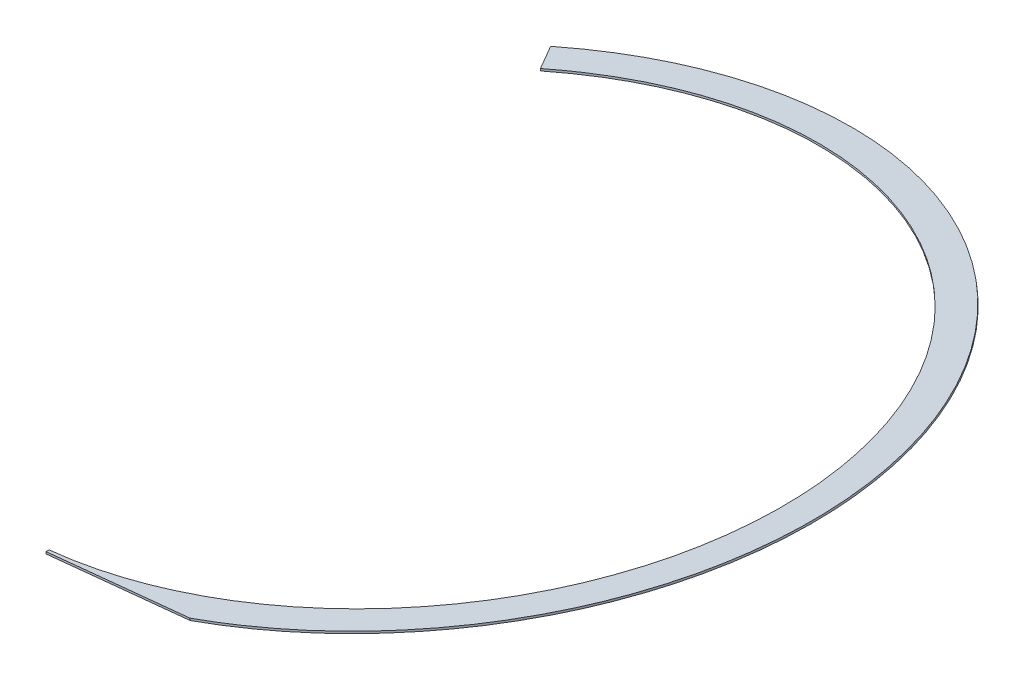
ISO-10303-21;
HEADER;
FILE_DESCRIPTION(('STEP AP214'),'2;1');
FILE_NAME('part.step','',(''),(''),'','','');
FILE_SCHEMA(('AUTOMOTIVE_DESIGN { 1 0 10303 214 1 1 1 1 }'));
ENDSEC;
DATA;
#1=APPLICATION_CONTEXT('core data for automotive mechanical design processes');
#2=APPLICATION_PROTOCOL_DEFINITION('international standard','automotive_design',2000,#1);
#3=PRODUCT_CONTEXT('',#1,'mechanical');
#4=PRODUCT('Part','Part','',(#3));
#5=PRODUCT_RELATED_PRODUCT_CATEGORY('part','',(#4));
#6=PRODUCT_DEFINITION_FORMATION('','',#4);
#7=PRODUCT_DEFINITION_CONTEXT('part definition',#1,'design');
#8=PRODUCT_DEFINITION('design','',#6,#7);
#9=PRODUCT_DEFINITION_SHAPE('','',#8);
#10=(LENGTH_UNIT() NAMED_UNIT(*) SI_UNIT(.MILLI.,.METRE.));
#11=(NAMED_UNIT(*) PLANE_ANGLE_UNIT() SI_UNIT($,.RADIAN.));
#12=(NAMED_UNIT(*) SI_UNIT($,.STERADIAN.) SOLID_ANGLE_UNIT());
#13=UNCERTAINTY_MEASURE_WITH_UNIT(LENGTH_MEASURE(1.E-05),#10,'distance_accuracy_value','');
#14=(GEOMETRIC_REPRESENTATION_CONTEXT(3) GLOBAL_UNCERTAINTY_ASSIGNED_CONTEXT((#13)) GLOBAL_UNIT_ASSIGNED_CONTEXT((#10,
#11,#12)) REPRESENTATION_CONTEXT('',''));
#15=CARTESIAN_POINT('',(0.,0.,0.));
#16=DIRECTION('',(0.,0.,1.));
#17=DIRECTION('',(1.,0.,0.));
#18=AXIS2_PLACEMENT_3D('',#15,#16,#17);
#19=CARTESIAN_POINT('',(0.,2.0000000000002,360.));
#20=DIRECTION('',(-0.995034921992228,-0.0995263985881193,0.));
#21=DIRECTION('',(0.0995263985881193,-0.995034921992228,0.));
#22=AXIS2_PLACEMENT_3D('',#19,#20,#21);
#23=PLANE('',#22);
#24=DIRECTION('',(0.0995263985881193,-0.995034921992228,0.));
#25=VECTOR('',#24,1.);
#26=CARTESIAN_POINT('',(0.,2.0000000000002,360.));
#27=LINE('',#26,#25);
#28=CARTESIAN_POINT('',(0.199052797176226,0.00993015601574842,360.));
#29=VERTEX_POINT('',#28);
#30=CARTESIAN_POINT('',(0.,2.0000000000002,360.));
#31=VERTEX_POINT('',#30);
#32=EDGE_CURVE('E13',#29,#31,#27,.F.);
#33=ORIENTED_EDGE('',*,*,#32,.F.);
#34=DIRECTION('',(0.,0.,1.));
#35=VECTOR('',#34,1.);
#36=CARTESIAN_POINT('',(0.199052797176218,0.00993015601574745,360.));
#37=LINE('',#36,#35);
#38=CARTESIAN_POINT('',(0.199052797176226,0.00993015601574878,363.000015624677));
#39=VERTEX_POINT('',#38);
#40=EDGE_CURVE('E396',#29,#39,#37,.T.);
#41=ORIENTED_EDGE('',*,*,#40,.T.);
#42=DIRECTION('',(0.0995263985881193,-0.995034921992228,0.));
#43=VECTOR('',#42,1.);
#44=CARTESIAN_POINT('',(0.,2.0000000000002,363.000015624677));
#45=LINE('',#44,#43);
#46=CARTESIAN_POINT('',(0.,2.0000000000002,363.000015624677));
#47=VERTEX_POINT('',#46);
#48=EDGE_CURVE('E365',#39,#47,#45,.F.);
#49=ORIENTED_EDGE('',*,*,#48,.T.);
#50=DIRECTION('',(0.,0.,1.));
#51=VECTOR('',#50,1.);
#52=CARTESIAN_POINT('',(0.,2.00000000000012,-327.385268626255));
#53=LINE('',#52,#51);
#54=EDGE_CURVE('E399',#31,#47,#53,.T.);
#55=ORIENTED_EDGE('',*,*,#54,.F.);
#56=EDGE_LOOP('',(#33,#41,#49,#55));
#57=FACE_BOUND('',#56,.T.);
#58=ADVANCED_FACE('F355',(#57),#23,.T.);
#59=CARTESIAN_POINT('',(0.,2.0000000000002,363.000015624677));
#60=CARTESIAN_POINT('',(35.7100050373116,5.57182257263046,362.993248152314));
#61=CARTESIAN_POINT('',(83.2349482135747,10.3254109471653,362.995616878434));
#62=CARTESIAN_POINT('',(142.574829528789,16.2607651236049,363.007121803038));
#63=CARTESIAN_POINT('',(0.199052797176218,0.00993015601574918,363.000015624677));
#64=CARTESIAN_POINT('',(35.9090578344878,3.581752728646,362.993248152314));
#65=CARTESIAN_POINT('',(83.4340010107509,8.33534110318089,362.995616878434));
#66=CARTESIAN_POINT('',(142.773882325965,14.2706952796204,363.007121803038));
#67=B_SPLINE_SURFACE_WITH_KNOTS('',1,3,((#59,#60,#61,#62),(#63,#64,#65,#66)),.UNSPECIFIED.,.F.,
.F.,.F.,(2,2),(4,4),(0.,1.),(0.,1.),.UNSPECIFIED.);
#68=CARTESIAN_POINT('',(0.199052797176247,0.0099301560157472,363.000015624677));
#69=CARTESIAN_POINT('',(53.7640603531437,5.36766401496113,362.989864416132));
#70=CARTESIAN_POINT('',(142.773882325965,14.2706952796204,363.007121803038));
#71=B_SPLINE_CURVE_WITH_KNOTS('',2,(#68,#69,#70),.UNSPECIFIED.,.F.,.F.,(3,3),(0.,1.),.UNSPECIFIED.);
#72=CARTESIAN_POINT('',(142.773882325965,14.2706952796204,363.007121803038));
#73=VERTEX_POINT('',#72);
#74=EDGE_CURVE('E413',#39,#73,#71,.T.);
#75=DIRECTION('',(-0.0995263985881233,0.995034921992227,0.));
#76=VECTOR('',#75,1.);
#77=CARTESIAN_POINT('',(142.674355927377,15.2657302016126,363.007121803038));
#78=LINE('',#77,#76);
#79=CARTESIAN_POINT('',(142.574829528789,16.2607651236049,363.007121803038));
#80=VERTEX_POINT('',#79);
#81=EDGE_CURVE('E464',#73,#80,#78,.T.);
#82=CARTESIAN_POINT('',(0.,2.0000000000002,363.000015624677));
#83=CARTESIAN_POINT('',(53.5650075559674,7.35773385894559,362.989864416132));
#84=CARTESIAN_POINT('',(142.574829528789,16.2607651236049,363.007121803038));
#85=B_SPLINE_CURVE_WITH_KNOTS('',2,(#82,#83,#84),.UNSPECIFIED.,.F.,.F.,(3,3),(0.,1.),.UNSPECIFIED.);
#86=EDGE_CURVE('E463',#47,#80,#85,.T.);
#87=ORIENTED_EDGE('',*,*,#48,.F.);
#88=ORIENTED_EDGE('',*,*,#74,.T.);
#89=ORIENTED_EDGE('',*,*,#81,.T.);
#90=ORIENTED_EDGE('',*,*,#86,.F.);
#91=EDGE_LOOP('',(#87,#88,#89,#90));
#92=FACE_BOUND('',#91,.T.);
#93=ADVANCED_FACE('F439',(#92),#67,.T.);
#94=CARTESIAN_POINT('',(-203.748563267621,-18.379546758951,-340.198161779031));
#95=CARTESIAN_POINT('',(-202.041636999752,-18.2088148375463,-341.23349349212));
#96=CARTESIAN_POINT('',(-200.459892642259,-18.0506039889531,-342.183657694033));
#97=CARTESIAN_POINT('',(-198.275048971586,-17.8320693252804,-343.481152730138));
#98=CARTESIAN_POINT('',(-197.578063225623,-17.7623547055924,-343.892359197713));
#99=CARTESIAN_POINT('',(-196.579527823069,-17.6624781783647,-344.477231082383));
#100=CARTESIAN_POINT('',(-196.254506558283,-17.6299685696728,-344.666865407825));
#101=CARTESIAN_POINT('',(-195.778710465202,-17.5823780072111,-344.943332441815));
#102=CARTESIAN_POINT('',(-195.622067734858,-17.5667101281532,-345.034157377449));
#103=CARTESIAN_POINT('',(-195.390037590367,-17.5435017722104,-345.168398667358));
#104=CARTESIAN_POINT('',(-195.313183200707,-17.5358145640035,-345.212813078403));
#105=CARTESIAN_POINT('',(-195.198635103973,-17.5243571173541,-345.278935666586));
#106=CARTESIAN_POINT('',(-195.160574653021,-17.5205501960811,-345.300893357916));
#107=CARTESIAN_POINT('',(-195.103667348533,-17.5148581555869,-345.333705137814));
#108=CARTESIAN_POINT('',(-195.084728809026,-17.512963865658,-345.344621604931));
#109=CARTESIAN_POINT('',(-195.056366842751,-17.5101270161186,-345.360965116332));
#110=CARTESIAN_POINT('',(-195.046920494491,-17.509182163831,-345.366407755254));
#111=CARTESIAN_POINT('',(-195.032762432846,-17.5077660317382,-345.374563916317));
#112=CARTESIAN_POINT('',(-195.028044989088,-17.5072941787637,-345.377281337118));
#113=CARTESIAN_POINT('',(-195.018613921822,-17.5063508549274,-345.382713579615));
#114=CARTESIAN_POINT('',(-195.014984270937,-17.5059878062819,-345.384804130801));
#115=CARTESIAN_POINT('',(-193.525492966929,-17.3570043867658,-346.242616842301));
#116=CARTESIAN_POINT('',(-192.044399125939,-17.208860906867,-347.08313786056));
#117=CARTESIAN_POINT('',(-189.826661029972,-16.9870360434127,-348.322988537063));
#118=CARTESIAN_POINT('',(-189.088065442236,-16.9131594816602,-348.73278362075));
#119=CARTESIAN_POINT('',(-187.981147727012,-16.8024422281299,-349.342243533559));
#120=CARTESIAN_POINT('',(-187.612337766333,-16.7655527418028,-349.544524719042));
#121=CARTESIAN_POINT('',(-187.05936674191,-16.7102429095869,-349.846638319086));
#122=CARTESIAN_POINT('',(-186.875083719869,-16.6918103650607,-349.947124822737));
#123=CARTESIAN_POINT('',(-186.506598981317,-16.6549534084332,-350.147661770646));
#124=CARTESIAN_POINT('',(-186.324290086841,-16.6367183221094,-350.246686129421));
#125=CARTESIAN_POINT('',(-183.161374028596,-16.3203539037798,-351.961280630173));
#126=CARTESIAN_POINT('',(-180.163794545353,-16.0205269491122,-353.536411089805));
#127=CARTESIAN_POINT('',(-175.636349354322,-15.5676782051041,-355.84119846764));
#128=CARTESIAN_POINT('',(-174.122021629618,-15.416210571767,-356.59980954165));
#129=CARTESIAN_POINT('',(-171.842761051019,-15.1882320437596,-357.723249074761));
#130=CARTESIAN_POINT('',(-171.081712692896,-15.1121096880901,-358.095316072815));
#131=CARTESIAN_POINT('',(-169.557026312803,-14.9596059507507,-358.834624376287));
#132=CARTESIAN_POINT('',(-168.79494896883,-14.8833806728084,-359.201121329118));
#133=CARTESIAN_POINT('',(-161.896507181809,-14.1933776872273,-362.49127663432));
#134=CARTESIAN_POINT('',(-155.70419795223,-13.5740042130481,-365.250757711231));
#135=CARTESIAN_POINT('',(-146.325192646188,-12.6358877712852,-369.142327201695));
#136=CARTESIAN_POINT('',(-143.183767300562,-12.3216729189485,-370.398241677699));
#137=CARTESIAN_POINT('',(-138.448993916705,-11.84808658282,-372.22020036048));
#138=CARTESIAN_POINT('',(-136.866963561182,-11.6898471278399,-372.817201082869));
#139=CARTESIAN_POINT('',(-134.488259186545,-11.4519219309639,-373.697223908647));
#140=CARTESIAN_POINT('',(-133.694414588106,-11.3725191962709,-373.987985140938));
#141=CARTESIAN_POINT('',(-132.50223298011,-11.25327359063,-374.420257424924));
#142=CARTESIAN_POINT('',(-132.104603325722,-11.2135014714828,-374.563703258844));
#143=CARTESIAN_POINT('',(-131.308872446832,-11.1339100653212,-374.849305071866));
#144=CARTESIAN_POINT('',(-130.912211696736,-11.094234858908,-374.990949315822));
#145=CARTESIAN_POINT('',(-117.71955472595,-9.77466545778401,-379.677701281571));
#146=CARTESIAN_POINT('',(-104.754763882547,-8.47788791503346,-383.537043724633));
#147=CARTESIAN_POINT('',(-85.0497105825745,-6.50692896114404,-388.297977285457));
#148=CARTESIAN_POINT('',(-78.4383816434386,-5.84564386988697,-389.713608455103));
#149=CARTESIAN_POINT('',(-68.4569214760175,-4.84726807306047,-391.58003518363));
#150=CARTESIAN_POINT('',(-65.1190236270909,-4.51340144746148,-392.159340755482));
#151=CARTESIAN_POINT('',(-60.0960601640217,-4.01098946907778,-392.964044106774));
#152=CARTESIAN_POINT('',(-58.4190528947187,-3.84325013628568,-393.221569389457));
#153=CARTESIAN_POINT('',(-55.0596661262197,-3.50723412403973,-393.715201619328));
#154=CARTESIAN_POINT('',(-53.3753896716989,-3.33876770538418,-393.951562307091));
#155=CARTESIAN_POINT('',(-38.2268717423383,-1.823567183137,-395.97785865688));
#156=CARTESIAN_POINT('',(-24.7414653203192,-0.474716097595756,-397.073101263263));
#157=CARTESIAN_POINT('',(2.26946182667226,2.22699842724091,-397.851767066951));
#158=CARTESIAN_POINT('',(15.7937549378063,3.57973907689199,-397.535282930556));
#159=CARTESIAN_POINT('',(42.8873659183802,6.28972388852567,-395.490124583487));
#160=CARTESIAN_POINT('',(56.3088731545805,7.63218358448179,-393.772950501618));
#161=CARTESIAN_POINT('',(76.253186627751,9.62707406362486,-390.155297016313));
#162=CARTESIAN_POINT('',(82.8699665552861,10.2889043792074,-388.775763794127));
#163=CARTESIAN_POINT('',(96.0408772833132,11.606298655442,-385.669399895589));
#164=CARTESIAN_POINT('',(102.59636658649,12.2619984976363,-383.942173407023));
#165=CARTESIAN_POINT('',(122.160709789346,14.2188832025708,-378.241922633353));
#166=CARTESIAN_POINT('',(134.941067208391,15.4972131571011,-373.786885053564));
#167=CARTESIAN_POINT('',(153.717796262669,17.3753183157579,-366.122023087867));
#168=CARTESIAN_POINT('',(159.911071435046,17.9947884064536,-363.403351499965));
#169=CARTESIAN_POINT('',(169.102532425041,18.9141460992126,-359.079767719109));
#170=CARTESIAN_POINT('',(172.149944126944,19.2189574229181,-357.597643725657));
#171=CARTESIAN_POINT('',(178.211950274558,19.8252975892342,-354.551536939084));
#172=CARTESIAN_POINT('',(181.228470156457,20.1270190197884,-352.986523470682));
#173=CARTESIAN_POINT('',(196.209772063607,21.6254940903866,-344.96711588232));
#174=CARTESIAN_POINT('',(207.803746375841,22.78515842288,-337.964248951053));
#175=CARTESIAN_POINT('',(224.60810702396,24.4659813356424,-326.578937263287));
#176=CARTESIAN_POINT('',(230.111793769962,25.0164767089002,-322.636998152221));
#177=CARTESIAN_POINT('',(238.220673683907,25.8275513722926,-316.503836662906));
#178=CARTESIAN_POINT('',(240.899191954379,26.0954648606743,-314.422740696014));
#179=CARTESIAN_POINT('',(244.880306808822,26.4936679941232,-311.246033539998));
#180=CARTESIAN_POINT('',(246.201234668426,26.6257911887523,-310.177953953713));
#181=CARTESIAN_POINT('',(248.830869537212,26.8888152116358,-308.023440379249));
#182=CARTESIAN_POINT('',(250.137876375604,27.0195459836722,-306.938436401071));
#183=CARTESIAN_POINT('',(261.876547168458,28.1936832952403,-297.065065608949));
#184=CARTESIAN_POINT('',(271.799256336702,29.1861826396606,-287.805553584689));
#185=CARTESIAN_POINT('',(285.915822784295,30.5981642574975,-273.191511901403));
#186=CARTESIAN_POINT('',(290.49342871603,31.0560302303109,-268.199369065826));
#187=CARTESIAN_POINT('',(297.16796328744,31.7236373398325,-260.529961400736));
#188=CARTESIAN_POINT('',(299.360829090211,31.94297440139,-257.943293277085));
#189=CARTESIAN_POINT('',(302.602159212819,32.2671820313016,-254.017992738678));
#190=CARTESIAN_POINT('',(303.674607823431,32.374451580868,-252.702009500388));
#191=CARTESIAN_POINT('',(305.271288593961,32.5341564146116,-250.716710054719));
#192=CARTESIAN_POINT('',(305.801516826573,32.5871914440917,-250.053056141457));
#193=CARTESIAN_POINT('',(306.857975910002,32.6928616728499,-248.721973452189));
#194=CARTESIAN_POINT('',(307.383338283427,32.745410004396,-248.055653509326));
#195=CARTESIAN_POINT('',(316.310049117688,33.6382865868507,-236.658427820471));
#196=CARTESIAN_POINT('',(324.117722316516,34.4192336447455,-225.554468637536));
#197=CARTESIAN_POINT('',(338.54519471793,35.8623130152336,-202.592233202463));
#198=CARTESIAN_POINT('',(345.164435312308,36.5243894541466,-190.735091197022));
#199=CARTESIAN_POINT('',(357.21727693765,37.7299510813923,-166.26195313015));
#200=CARTESIAN_POINT('',(362.584783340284,38.2668252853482,-153.780066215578));
#201=CARTESIAN_POINT('',(369.647671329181,38.9732766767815,-134.689259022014));
#202=CARTESIAN_POINT('',(371.83723872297,39.1922838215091,-128.264327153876));
#203=CARTESIAN_POINT('',(374.87449690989,39.4960795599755,-118.534935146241));
#204=CARTESIAN_POINT('',(375.845734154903,39.5932256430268,-115.276472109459));
#205=CARTESIAN_POINT('',(377.705844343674,39.779279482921,-108.728881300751));
#206=CARTESIAN_POINT('',(378.594354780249,39.8681509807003,-105.441166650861));
#207=CARTESIAN_POINT('',(382.834621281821,40.2922752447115,-88.9118003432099));
#208=CARTESIAN_POINT('',(385.531753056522,40.5620505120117,-75.5857777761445));
#209=CARTESIAN_POINT('',(388.534828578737,40.8624271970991,-55.4429496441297));
#210=CARTESIAN_POINT('',(389.362083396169,40.9451717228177,-48.7030412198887));
#211=CARTESIAN_POINT('',(390.342310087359,41.0432169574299,-38.5547300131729));
#212=CARTESIAN_POINT('',(390.625609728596,41.0715534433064,-35.1655515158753));
#213=CARTESIAN_POINT('',(391.10532383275,41.1195358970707,-28.3743783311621));
#214=CARTESIAN_POINT('',(391.301655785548,41.1391736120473,-24.9742220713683));
#215=CARTESIAN_POINT('',(392.066927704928,41.2157184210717,-7.92301602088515));
#216=CARTESIAN_POINT('',(391.977917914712,41.2068153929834,5.67507633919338));
#217=CARTESIAN_POINT('',(390.792562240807,41.0882525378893,26.0079061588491));
#218=CARTESIAN_POINT('',(390.222136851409,41.0311968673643,32.7747979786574));
#219=CARTESIAN_POINT('',(389.103538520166,40.9193112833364,42.9090585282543));
#220=CARTESIAN_POINT('',(388.686845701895,40.8776324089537,46.2844658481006));
#221=CARTESIAN_POINT('',(387.996066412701,40.8085385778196,51.3435575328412));
#222=CARTESIAN_POINT('',(387.754849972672,40.7844113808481,53.02925154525));
#223=CARTESIAN_POINT('',(387.376590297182,40.746576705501,55.5567877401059));
#224=CARTESIAN_POINT('',(387.247764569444,40.7336911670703,56.3991323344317));
#225=CARTESIAN_POINT('',(386.984634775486,40.7073721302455,58.0834865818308));
#226=CARTESIAN_POINT('',(386.850104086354,40.6939159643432,58.9268883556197));
#227=CARTESIAN_POINT('',(384.524221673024,40.4612741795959,73.2145394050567));
#228=CARTESIAN_POINT('',(381.654954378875,40.1742813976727,86.4889489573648));
#229=CARTESIAN_POINT('',(376.330751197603,39.641738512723,106.141376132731));
#230=CARTESIAN_POINT('',(374.385966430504,39.447215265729,112.648987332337));
#231=CARTESIAN_POINT('',(371.213713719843,39.1299169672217,122.345607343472));
#232=CARTESIAN_POINT('',(370.113783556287,39.0198986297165,125.567014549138));
#233=CARTESIAN_POINT('',(368.40011942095,38.8484927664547,130.382926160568));
#234=CARTESIAN_POINT('',(367.818269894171,38.7902944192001,131.985530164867));
#235=CARTESIAN_POINT('',(366.929553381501,38.7014023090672,134.385386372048));
#236=CARTESIAN_POINT('',(366.630657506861,38.6715058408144,135.184663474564));
#237=CARTESIAN_POINT('',(366.178328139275,38.6262624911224,136.38256667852));
#238=CARTESIAN_POINT('',(366.026887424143,38.6111149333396,136.78169900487));
#239=CARTESIAN_POINT('',(365.722677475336,38.5806869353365,137.579626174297));
#240=CARTESIAN_POINT('',(365.569477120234,38.5653633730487,137.979541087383));
#241=CARTESIAN_POINT('',(360.520398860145,38.0603393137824,151.097240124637));
#242=CARTESIAN_POINT('',(354.994928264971,37.5076650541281,163.501161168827));
#243=CARTESIAN_POINT('',(345.762630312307,36.5842227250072,181.632634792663));
#244=CARTESIAN_POINT('',(342.527848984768,36.2606701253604,187.597391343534));
#245=CARTESIAN_POINT('',(337.439653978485,35.7517334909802,196.425924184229));
#246=CARTESIAN_POINT('',(335.704251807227,35.5781533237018,199.349001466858));
#247=CARTESIAN_POINT('',(332.154773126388,35.2231237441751,205.155622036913));
#248=CARTESIAN_POINT('',(330.339467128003,35.0415513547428,208.04106505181));
#249=CARTESIAN_POINT('',(321.078546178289,34.1152460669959,222.350447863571));
#250=CARTESIAN_POINT('',(313.124934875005,33.31970183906,233.352152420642));
#251=CARTESIAN_POINT('',(300.37720610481,32.0446355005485,249.186006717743));
#252=CARTESIAN_POINT('',(295.991744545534,31.6059883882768,254.352507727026));
#253=CARTESIAN_POINT('',(289.209224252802,30.9275802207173,261.935083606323));
#254=CARTESIAN_POINT('',(286.914329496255,30.6980379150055,264.434746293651));
#255=CARTESIAN_POINT('',(282.256430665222,30.2321408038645,269.378346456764));
#256=CARTESIAN_POINT('',(279.894461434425,29.9958895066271,271.82124087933));
#257=CARTESIAN_POINT('',(267.903993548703,28.7965666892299,283.906830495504));
#258=CARTESIAN_POINT('',(257.868831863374,27.7928195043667,293.027347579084));
#259=CARTESIAN_POINT('',(242.151908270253,26.2207653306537,305.886191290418));
#260=CARTESIAN_POINT('',(236.802236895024,25.6856750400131,310.035483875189));
#261=CARTESIAN_POINT('',(228.6116845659,24.8664312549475,316.053939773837));
#262=CARTESIAN_POINT('',(225.853826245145,24.5905819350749,318.025844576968));
#263=CARTESIAN_POINT('',(221.675527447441,24.1726558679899,320.932331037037));
#264=CARTESIAN_POINT('',(220.275842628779,24.0326551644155,321.892598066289));
#265=CARTESIAN_POINT('',(218.165937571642,23.821616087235,323.32015592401));
#266=CARTESIAN_POINT('',(217.460906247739,23.7510967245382,323.793868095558));
#267=CARTESIAN_POINT('',(216.400764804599,23.6450581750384,324.50122568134));
#268=CARTESIAN_POINT('',(216.046951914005,23.6096687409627,324.736476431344));
#269=CARTESIAN_POINT('',(215.338461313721,23.538803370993,325.205907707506));
#270=CARTESIAN_POINT('',(214.982758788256,23.5032249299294,325.440762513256));
#271=CARTESIAN_POINT('',(208.963308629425,22.9011413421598,329.401271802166));
#272=CARTESIAN_POINT('',(203.208653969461,22.3255434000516,332.977072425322));
#273=CARTESIAN_POINT('',(194.442737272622,21.4487499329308,338.113167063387));
#274=CARTESIAN_POINT('',(191.498442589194,21.1542526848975,339.787264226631));
#275=CARTESIAN_POINT('',(187.048516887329,20.709157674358,342.241508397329));
#276=CARTESIAN_POINT('',(185.559627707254,20.5602344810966,343.050106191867));
#277=CARTESIAN_POINT('',(183.31792301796,20.336012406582,344.248777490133));
#278=CARTESIAN_POINT('',(182.569292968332,20.2611321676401,344.645963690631));
#279=CARTESIAN_POINT('',(181.069242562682,20.1110925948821,345.43559429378));
#280=CARTESIAN_POINT('',(180.316430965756,20.0357941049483,345.828759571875));
#281=CARTESIAN_POINT('',(176.559309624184,19.6599954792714,347.775522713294));
#282=CARTESIAN_POINT('',(173.533230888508,19.3573179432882,349.293884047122));
#283=CARTESIAN_POINT('',(168.963540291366,18.9002436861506,351.512852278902));
#284=CARTESIAN_POINT('',(167.435214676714,18.7473759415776,352.242746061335));
#285=CARTESIAN_POINT('',(165.135083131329,18.5173098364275,353.322943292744));
#286=CARTESIAN_POINT('',(164.3670987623,18.4404937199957,353.680568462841));
#287=CARTESIAN_POINT('',(163.213211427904,18.3250784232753,354.213345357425));
#288=CARTESIAN_POINT('',(162.828263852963,18.2865748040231,354.390327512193));
#289=CARTESIAN_POINT('',(162.250364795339,18.2287715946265,354.654885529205));
#290=CARTESIAN_POINT('',(162.057652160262,18.2094958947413,354.742918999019));
#291=CARTESIAN_POINT('',(161.768463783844,18.180570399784,354.874740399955));
#292=CARTESIAN_POINT('',(161.672047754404,18.1709265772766,354.91864273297));
#293=CARTESIAN_POINT('',(161.47917588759,18.151634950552,355.006371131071));
#294=CARTESIAN_POINT('',(161.381474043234,18.1418625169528,355.050762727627));
#295=CARTESIAN_POINT('',(159.762568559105,17.9799347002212,355.785543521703));
#296=CARTESIAN_POINT('',(158.225331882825,17.8261756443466,356.4711713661));
#297=CARTESIAN_POINT('',(155.899135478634,17.5935024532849,357.490717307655));
#298=CARTESIAN_POINT('',(155.120346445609,17.5156056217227,357.829083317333));
#299=CARTESIAN_POINT('',(153.947077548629,17.398251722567,358.33440837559));
#300=CARTESIAN_POINT('',(153.555140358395,17.3590489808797,358.502479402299));
#301=CARTESIAN_POINT('',(152.965963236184,17.3001177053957,358.754029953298));
#302=CARTESIAN_POINT('',(152.769358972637,17.2804527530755,358.83778747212));
#303=CARTESIAN_POINT('',(152.474134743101,17.2509235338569,358.963284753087));
#304=CARTESIAN_POINT('',(152.37567369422,17.2410751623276,359.005094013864));
#305=CARTESIAN_POINT('',(152.227902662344,17.2262946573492,359.067773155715));
#306=CARTESIAN_POINT('',(152.178632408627,17.2213664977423,359.088660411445));
#307=CARTESIAN_POINT('',(152.104707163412,17.2139722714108,359.119982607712));
#308=CARTESIAN_POINT('',(152.080062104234,17.2115071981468,359.130421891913));
#309=CARTESIAN_POINT('',(152.043089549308,17.2078090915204,359.146078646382));
#310=CARTESIAN_POINT('',(152.030764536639,17.2065763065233,359.151297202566));
#311=CARTESIAN_POINT('',(152.012275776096,17.204727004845,359.159124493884));
#312=CARTESIAN_POINT('',(152.006112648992,17.2041105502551,359.161733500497));
#313=CARTESIAN_POINT('',(151.993785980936,17.2028775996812,359.166951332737));
#314=CARTESIAN_POINT('',(151.986453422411,17.2021441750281,359.170054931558));
#315=CARTESIAN_POINT('',(149.424156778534,16.9458555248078,360.254517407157));
#316=CARTESIAN_POINT('',(146.288613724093,16.632229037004,361.53283504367));
#317=CARTESIAN_POINT('',(142.574829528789,16.2607651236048,363.007121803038));
#318=CARTESIAN_POINT('',(-203.549510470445,-20.3696166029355,-340.198161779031));
#319=CARTESIAN_POINT('',(-201.842584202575,-20.1988846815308,-341.23349349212));
#320=CARTESIAN_POINT('',(-200.260839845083,-20.0406738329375,-342.183657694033));
#321=CARTESIAN_POINT('',(-198.07599617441,-19.8221391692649,-343.481152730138));
#322=CARTESIAN_POINT('',(-197.379010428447,-19.7524245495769,-343.892359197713));
#323=CARTESIAN_POINT('',(-196.380475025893,-19.6525480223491,-344.477231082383));
#324=CARTESIAN_POINT('',(-196.055453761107,-19.6200384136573,-344.666865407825));
#325=CARTESIAN_POINT('',(-195.579657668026,-19.5724478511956,-344.943332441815));
#326=CARTESIAN_POINT('',(-195.423014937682,-19.5567799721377,-345.034157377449));
#327=CARTESIAN_POINT('',(-195.19098479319,-19.5335716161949,-345.168398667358));
#328=CARTESIAN_POINT('',(-195.114130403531,-19.5258844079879,-345.212813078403));
#329=CARTESIAN_POINT('',(-194.999582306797,-19.5144269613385,-345.278935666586));
#330=CARTESIAN_POINT('',(-194.961521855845,-19.5106200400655,-345.300893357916));
#331=CARTESIAN_POINT('',(-194.904614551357,-19.5049279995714,-345.333705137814));
#332=CARTESIAN_POINT('',(-194.88567601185,-19.5030337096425,-345.344621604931));
#333=CARTESIAN_POINT('',(-194.857314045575,-19.500196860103,-345.360965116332));
#334=CARTESIAN_POINT('',(-194.847867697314,-19.4992520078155,-345.366407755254));
#335=CARTESIAN_POINT('',(-194.833709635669,-19.4978358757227,-345.374563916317));
#336=CARTESIAN_POINT('',(-194.828992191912,-19.4973640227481,-345.377281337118));
#337=CARTESIAN_POINT('',(-194.819561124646,-19.4964206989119,-345.382713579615));
#338=CARTESIAN_POINT('',(-194.815931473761,-19.4960576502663,-345.384804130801));
#339=CARTESIAN_POINT('',(-193.326440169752,-19.3470742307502,-346.242616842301));
#340=CARTESIAN_POINT('',(-191.845346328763,-19.1989307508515,-347.08313786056));
#341=CARTESIAN_POINT('',(-189.627608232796,-18.9771058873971,-348.322988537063));
#342=CARTESIAN_POINT('',(-188.88901264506,-18.9032293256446,-348.73278362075));
#343=CARTESIAN_POINT('',(-187.782094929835,-18.7925120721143,-349.342243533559));
#344=CARTESIAN_POINT('',(-187.413284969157,-18.7556225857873,-349.544524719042));
#345=CARTESIAN_POINT('',(-186.860313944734,-18.7003127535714,-349.846638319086));
#346=CARTESIAN_POINT('',(-186.676030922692,-18.6818802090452,-349.947124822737));
#347=CARTESIAN_POINT('',(-186.307546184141,-18.6450232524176,-350.147661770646));
#348=CARTESIAN_POINT('',(-186.125237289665,-18.6267881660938,-350.246686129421));
#349=CARTESIAN_POINT('',(-182.96232123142,-18.3104237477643,-351.961280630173));
#350=CARTESIAN_POINT('',(-179.964741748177,-18.0105967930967,-353.536411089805));
#351=CARTESIAN_POINT('',(-175.437296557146,-17.5577480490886,-355.84119846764));
#352=CARTESIAN_POINT('',(-173.922968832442,-17.4062804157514,-356.59980954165));
#353=CARTESIAN_POINT('',(-171.643708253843,-17.178301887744,-357.723249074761));
#354=CARTESIAN_POINT('',(-170.88265989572,-17.1021795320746,-358.095316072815));
#355=CARTESIAN_POINT('',(-169.357973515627,-16.9496757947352,-358.834624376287));
#356=CARTESIAN_POINT('',(-168.595896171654,-16.8734505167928,-359.201121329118));
#357=CARTESIAN_POINT('',(-161.697454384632,-16.1834475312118,-362.49127663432));
#358=CARTESIAN_POINT('',(-155.505145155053,-15.5640740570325,-365.250757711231));
#359=CARTESIAN_POINT('',(-146.126139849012,-14.6259576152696,-369.142327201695));
#360=CARTESIAN_POINT('',(-142.984714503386,-14.311742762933,-370.398241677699));
#361=CARTESIAN_POINT('',(-138.249941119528,-13.8381564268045,-372.22020036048));
#362=CARTESIAN_POINT('',(-136.667910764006,-13.6799169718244,-372.817201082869));
#363=CARTESIAN_POINT('',(-134.289206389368,-13.4419917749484,-373.697223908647));
#364=CARTESIAN_POINT('',(-133.49536179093,-13.3625890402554,-373.987985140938));
#365=CARTESIAN_POINT('',(-132.303180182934,-13.2433434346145,-374.420257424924));
#366=CARTESIAN_POINT('',(-131.905550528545,-13.2035713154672,-374.563703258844));
#367=CARTESIAN_POINT('',(-131.109819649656,-13.1239799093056,-374.849305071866));
#368=CARTESIAN_POINT('',(-130.71315889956,-13.0843047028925,-374.990949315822));
#369=CARTESIAN_POINT('',(-117.520501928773,-11.7647353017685,-379.677701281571));
#370=CARTESIAN_POINT('',(-104.555711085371,-10.4679577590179,-383.537043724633));
#371=CARTESIAN_POINT('',(-84.8506577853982,-8.4969988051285,-388.297977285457));
#372=CARTESIAN_POINT('',(-78.2393288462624,-7.83571371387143,-389.713608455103));
#373=CARTESIAN_POINT('',(-68.2578686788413,-6.83733791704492,-391.58003518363));
#374=CARTESIAN_POINT('',(-64.9199708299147,-6.50347129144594,-392.159340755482));
#375=CARTESIAN_POINT('',(-59.8970073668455,-6.00105931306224,-392.964044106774));
#376=CARTESIAN_POINT('',(-58.2200000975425,-5.83331998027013,-393.221569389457));
#377=CARTESIAN_POINT('',(-54.8606133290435,-5.49730396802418,-393.715201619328));
#378=CARTESIAN_POINT('',(-53.1763368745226,-5.32883754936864,-393.951562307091));
#379=CARTESIAN_POINT('',(-38.0278189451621,-3.81363702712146,-395.97785865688));
#380=CARTESIAN_POINT('',(-24.5424125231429,-2.46478594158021,-397.073101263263));
#381=CARTESIAN_POINT('',(2.4685146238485,0.236928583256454,-397.851767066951));
#382=CARTESIAN_POINT('',(15.9928077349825,1.58966923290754,-397.535282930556));
#383=CARTESIAN_POINT('',(43.0864187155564,4.29965404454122,-395.490124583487));
#384=CARTESIAN_POINT('',(56.5079259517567,5.64211374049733,-393.772950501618));
#385=CARTESIAN_POINT('',(76.4522394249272,7.6370042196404,-390.155297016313));
#386=CARTESIAN_POINT('',(83.0690193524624,8.29883453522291,-388.775763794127));
#387=CARTESIAN_POINT('',(96.2399300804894,9.61622881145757,-385.669399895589));
#388=CARTESIAN_POINT('',(102.795419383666,10.2719286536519,-383.942173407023));
#389=CARTESIAN_POINT('',(122.359762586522,12.2288133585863,-378.241922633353));
#390=CARTESIAN_POINT('',(135.140120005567,13.5071433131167,-373.786885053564));
#391=CARTESIAN_POINT('',(153.916849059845,15.3852484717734,-366.122023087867));
#392=CARTESIAN_POINT('',(160.110124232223,16.0047185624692,-363.403351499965));
#393=CARTESIAN_POINT('',(169.301585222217,16.9240762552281,-359.079767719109));
#394=CARTESIAN_POINT('',(172.34899692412,17.2288875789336,-357.597643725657));
#395=CARTESIAN_POINT('',(178.411003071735,17.8352277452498,-354.551536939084));
#396=CARTESIAN_POINT('',(181.427522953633,18.1369491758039,-352.986523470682));
#397=CARTESIAN_POINT('',(196.408824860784,19.6354242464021,-344.96711588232));
#398=CARTESIAN_POINT('',(208.002799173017,20.7950885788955,-337.964248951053));
#399=CARTESIAN_POINT('',(224.807159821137,22.4759114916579,-326.578937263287));
#400=CARTESIAN_POINT('',(230.310846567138,23.0264068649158,-322.636998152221));
#401=CARTESIAN_POINT('',(238.419726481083,23.8374815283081,-316.503836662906));
#402=CARTESIAN_POINT('',(241.098244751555,24.1053950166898,-314.422740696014));
#403=CARTESIAN_POINT('',(245.079359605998,24.5035981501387,-311.246033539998));
#404=CARTESIAN_POINT('',(246.400287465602,24.6357213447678,-310.177953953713));
#405=CARTESIAN_POINT('',(249.029922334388,24.8987453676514,-308.023440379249));
#406=CARTESIAN_POINT('',(250.336929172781,25.0294761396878,-306.938436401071));
#407=CARTESIAN_POINT('',(262.075599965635,26.2036134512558,-297.065065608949));
#408=CARTESIAN_POINT('',(271.998309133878,27.1961127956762,-287.805553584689));
#409=CARTESIAN_POINT('',(286.114875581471,28.608094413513,-273.191511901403));
#410=CARTESIAN_POINT('',(290.692481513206,29.0659603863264,-268.199369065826));
#411=CARTESIAN_POINT('',(297.367016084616,29.733567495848,-260.529961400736));
#412=CARTESIAN_POINT('',(299.559881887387,29.9529045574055,-257.943293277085));
#413=CARTESIAN_POINT('',(302.801212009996,30.2771121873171,-254.017992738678));
#414=CARTESIAN_POINT('',(303.873660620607,30.3843817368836,-252.702009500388));
#415=CARTESIAN_POINT('',(305.470341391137,30.5440865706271,-250.716710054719));
#416=CARTESIAN_POINT('',(306.000569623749,30.5971216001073,-250.053056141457));
#417=CARTESIAN_POINT('',(307.057028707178,30.7027918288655,-248.721973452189));
#418=CARTESIAN_POINT('',(307.582391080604,30.7553401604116,-248.055653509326));
#419=CARTESIAN_POINT('',(316.509101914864,31.6482167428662,-236.658427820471));
#420=CARTESIAN_POINT('',(324.316775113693,32.429163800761,-225.554468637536));
#421=CARTESIAN_POINT('',(338.744247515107,33.8722431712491,-202.592233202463));
#422=CARTESIAN_POINT('',(345.363488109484,34.5343196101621,-190.735091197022));
#423=CARTESIAN_POINT('',(357.416329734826,35.7398812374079,-166.26195313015));
#424=CARTESIAN_POINT('',(362.783836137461,36.2767554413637,-153.780066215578));
#425=CARTESIAN_POINT('',(369.846724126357,36.983206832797,-134.689259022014));
#426=CARTESIAN_POINT('',(372.036291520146,37.2022139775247,-128.264327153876));
#427=CARTESIAN_POINT('',(375.073549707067,37.506009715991,-118.534935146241));
#428=CARTESIAN_POINT('',(376.044786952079,37.6031557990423,-115.276472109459));
#429=CARTESIAN_POINT('',(377.90489714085,37.7892096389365,-108.728881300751));
#430=CARTESIAN_POINT('',(378.793407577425,37.8780811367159,-105.441166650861));
#431=CARTESIAN_POINT('',(383.033674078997,38.302205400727,-88.9118003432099));
#432=CARTESIAN_POINT('',(385.730805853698,38.5719806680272,-75.5857777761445));
#433=CARTESIAN_POINT('',(388.733881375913,38.8723573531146,-55.4429496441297));
#434=CARTESIAN_POINT('',(389.561136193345,38.9551018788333,-48.7030412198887));
#435=CARTESIAN_POINT('',(390.541362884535,39.0531471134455,-38.5547300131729));
#436=CARTESIAN_POINT('',(390.824662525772,39.0814835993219,-35.1655515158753));
#437=CARTESIAN_POINT('',(391.304376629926,39.1294660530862,-28.3743783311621));
#438=CARTESIAN_POINT('',(391.500708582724,39.1491037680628,-24.9742220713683));
#439=CARTESIAN_POINT('',(392.265980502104,39.2256485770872,-7.92301602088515));
#440=CARTESIAN_POINT('',(392.176970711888,39.2167455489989,5.67507633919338));
#441=CARTESIAN_POINT('',(390.991615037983,39.0981826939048,26.0079061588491));
#442=CARTESIAN_POINT('',(390.421189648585,39.0411270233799,32.7747979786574));
#443=CARTESIAN_POINT('',(389.302591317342,38.929241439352,42.9090585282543));
#444=CARTESIAN_POINT('',(388.885898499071,38.8875625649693,46.2844658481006));
#445=CARTESIAN_POINT('',(388.195119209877,38.8184687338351,51.3435575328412));
#446=CARTESIAN_POINT('',(387.953902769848,38.7943415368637,53.02925154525));
#447=CARTESIAN_POINT('',(387.575643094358,38.7565068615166,55.5567877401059));
#448=CARTESIAN_POINT('',(387.44681736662,38.7436213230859,56.3991323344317));
#449=CARTESIAN_POINT('',(387.183687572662,38.7173022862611,58.0834865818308));
#450=CARTESIAN_POINT('',(387.04915688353,38.7038461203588,58.9268883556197));
#451=CARTESIAN_POINT('',(384.7232744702,38.4712043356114,73.2145394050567));
#452=CARTESIAN_POINT('',(381.854007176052,38.1842115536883,86.4889489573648));
#453=CARTESIAN_POINT('',(376.529803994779,37.6516686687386,106.141376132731));
#454=CARTESIAN_POINT('',(374.58501922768,37.4571454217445,112.648987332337));
#455=CARTESIAN_POINT('',(371.412766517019,37.1398471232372,122.345607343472));
#456=CARTESIAN_POINT('',(370.312836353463,37.029828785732,125.567014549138));
#457=CARTESIAN_POINT('',(368.599172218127,36.8584229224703,130.382926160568));
#458=CARTESIAN_POINT('',(368.017322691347,36.8002245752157,131.985530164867));
#459=CARTESIAN_POINT('',(367.128606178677,36.7113324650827,134.385386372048));
#460=CARTESIAN_POINT('',(366.829710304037,36.6814359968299,135.184663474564));
#461=CARTESIAN_POINT('',(366.377380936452,36.636192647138,136.38256667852));
#462=CARTESIAN_POINT('',(366.225940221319,36.6210450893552,136.78169900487));
#463=CARTESIAN_POINT('',(365.921730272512,36.590617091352,137.579626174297));
#464=CARTESIAN_POINT('',(365.76852991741,36.5752935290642,137.979541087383));
#465=CARTESIAN_POINT('',(360.719451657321,36.0702694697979,151.097240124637));
#466=CARTESIAN_POINT('',(355.193981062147,35.5175952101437,163.501161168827));
#467=CARTESIAN_POINT('',(345.961683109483,34.5941528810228,181.632634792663));
#468=CARTESIAN_POINT('',(342.726901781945,34.2706002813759,187.597391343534));
#469=CARTESIAN_POINT('',(337.638706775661,33.7616636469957,196.425924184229));
#470=CARTESIAN_POINT('',(335.903304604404,33.5880834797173,199.349001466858));
#471=CARTESIAN_POINT('',(332.353825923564,33.2330539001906,205.155622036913));
#472=CARTESIAN_POINT('',(330.538519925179,33.0514815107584,208.04106505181));
#473=CARTESIAN_POINT('',(321.277598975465,32.1251762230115,222.350447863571));
#474=CARTESIAN_POINT('',(313.323987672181,31.3296319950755,233.352152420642));
#475=CARTESIAN_POINT('',(300.576258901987,30.0545656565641,249.186006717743));
#476=CARTESIAN_POINT('',(296.19079734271,29.6159185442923,254.352507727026));
#477=CARTESIAN_POINT('',(289.408277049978,28.9375103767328,261.935083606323));
#478=CARTESIAN_POINT('',(287.113382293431,28.707968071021,264.434746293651));
#479=CARTESIAN_POINT('',(282.455483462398,28.2420709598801,269.378346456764));
#480=CARTESIAN_POINT('',(280.093514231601,28.0058196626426,271.82124087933));
#481=CARTESIAN_POINT('',(268.103046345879,26.8064968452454,283.906830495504));
#482=CARTESIAN_POINT('',(258.06788466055,25.8027496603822,293.027347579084));
#483=CARTESIAN_POINT('',(242.350961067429,24.2306954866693,305.886191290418));
#484=CARTESIAN_POINT('',(237.001289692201,23.6956051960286,310.035483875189));
#485=CARTESIAN_POINT('',(228.810737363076,22.8763614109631,316.053939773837));
#486=CARTESIAN_POINT('',(226.052879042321,22.6005120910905,318.025844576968));
#487=CARTESIAN_POINT('',(221.874580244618,22.1825860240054,320.932331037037));
#488=CARTESIAN_POINT('',(220.474895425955,22.0425853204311,321.892598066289));
#489=CARTESIAN_POINT('',(218.364990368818,21.8315462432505,323.32015592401));
#490=CARTESIAN_POINT('',(217.659959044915,21.7610268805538,323.793868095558));
#491=CARTESIAN_POINT('',(216.599817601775,21.654988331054,324.50122568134));
#492=CARTESIAN_POINT('',(216.246004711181,21.6195988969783,324.736476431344));
#493=CARTESIAN_POINT('',(215.537514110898,21.5487335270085,325.205907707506));
#494=CARTESIAN_POINT('',(215.181811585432,21.513155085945,325.440762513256));
#495=CARTESIAN_POINT('',(209.162361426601,20.9110714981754,329.401271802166));
#496=CARTESIAN_POINT('',(203.407706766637,20.3354735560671,332.977072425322));
#497=CARTESIAN_POINT('',(194.641790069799,19.4586800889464,338.113167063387));
#498=CARTESIAN_POINT('',(191.69749538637,19.1641828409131,339.787264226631));
#499=CARTESIAN_POINT('',(187.247569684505,18.7190878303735,342.241508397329));
#500=CARTESIAN_POINT('',(185.75868050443,18.5701646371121,343.050106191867));
#501=CARTESIAN_POINT('',(183.516975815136,18.3459425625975,344.248777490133));
#502=CARTESIAN_POINT('',(182.768345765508,18.2710623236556,344.645963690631));
#503=CARTESIAN_POINT('',(181.268295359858,18.1210227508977,345.43559429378));
#504=CARTESIAN_POINT('',(180.515483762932,18.0457242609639,345.828759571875));
#505=CARTESIAN_POINT('',(176.758362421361,17.669925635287,347.775522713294));
#506=CARTESIAN_POINT('',(173.732283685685,17.3672480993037,349.293884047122));
#507=CARTESIAN_POINT('',(169.162593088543,16.9101738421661,351.512852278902));
#508=CARTESIAN_POINT('',(167.634267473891,16.7573060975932,352.242746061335));
#509=CARTESIAN_POINT('',(165.334135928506,16.5272399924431,353.322943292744));
#510=CARTESIAN_POINT('',(164.566151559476,16.4504238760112,353.680568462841));
#511=CARTESIAN_POINT('',(163.41226422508,16.3350085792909,354.213345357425));
#512=CARTESIAN_POINT('',(163.027316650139,16.2965049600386,354.390327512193));
#513=CARTESIAN_POINT('',(162.449417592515,16.2387017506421,354.654885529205));
#514=CARTESIAN_POINT('',(162.256704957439,16.2194260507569,354.742918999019));
#515=CARTESIAN_POINT('',(161.96751658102,16.1905005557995,354.874740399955));
#516=CARTESIAN_POINT('',(161.87110055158,16.1808567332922,354.91864273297));
#517=CARTESIAN_POINT('',(161.678228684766,16.1615651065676,355.006371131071));
#518=CARTESIAN_POINT('',(161.58052684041,16.1517926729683,355.050762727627));
#519=CARTESIAN_POINT('',(159.961621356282,15.9898648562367,355.785543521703));
#520=CARTESIAN_POINT('',(158.424384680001,15.8361058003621,356.4711713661));
#521=CARTESIAN_POINT('',(156.09818827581,15.6034326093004,357.490717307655));
#522=CARTESIAN_POINT('',(155.319399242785,15.5255357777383,357.829083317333));
#523=CARTESIAN_POINT('',(154.146130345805,15.4081818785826,358.33440837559));
#524=CARTESIAN_POINT('',(153.754193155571,15.3689791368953,358.502479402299));
#525=CARTESIAN_POINT('',(153.16501603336,15.3100478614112,358.754029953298));
#526=CARTESIAN_POINT('',(152.968411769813,15.290382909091,358.83778747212));
#527=CARTESIAN_POINT('',(152.673187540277,15.2608536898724,358.963284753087));
#528=CARTESIAN_POINT('',(152.574726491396,15.2510053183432,359.005094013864));
#529=CARTESIAN_POINT('',(152.426955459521,15.2362248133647,359.067773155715));
#530=CARTESIAN_POINT('',(152.377685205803,15.2312966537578,359.088660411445));
#531=CARTESIAN_POINT('',(152.303759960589,15.2239024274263,359.119982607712));
#532=CARTESIAN_POINT('',(152.279114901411,15.2214373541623,359.130421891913));
#533=CARTESIAN_POINT('',(152.242142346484,15.217739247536,359.146078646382));
#534=CARTESIAN_POINT('',(152.229817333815,15.2165064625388,359.151297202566));
#535=CARTESIAN_POINT('',(152.211328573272,15.2146571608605,359.159124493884));
#536=CARTESIAN_POINT('',(152.205165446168,15.2140407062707,359.161733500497));
#537=CARTESIAN_POINT('',(152.192838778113,15.2128077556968,359.166951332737));
#538=CARTESIAN_POINT('',(152.185506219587,15.2120743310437,359.170054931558));
#539=CARTESIAN_POINT('',(149.62320957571,14.9557856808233,360.254517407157));
#540=CARTESIAN_POINT('',(146.487666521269,14.6421591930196,361.53283504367));
#541=CARTESIAN_POINT('',(142.773882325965,14.2706952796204,363.007121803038));
#542=B_SPLINE_SURFACE_WITH_KNOTS('',1,3,((#94,#95,#96,#97,#98,#99,#100,#101,#102,#103,#104,#105,
#106,#107,#108,#109,#110,#111,#112,#113,#114,#115,#116,#117,#118,#119,#120,#121,#122,#123,#124,
#125,#126,#127,#128,#129,#130,#131,#132,#133,#134,#135,#136,#137,#138,#139,#140,#141,#142,#143,
#144,#145,#146,#147,#148,#149,#150,#151,#152,#153,#154,#155,#156,#157,#158,#159,#160,#161,#162,
#163,#164,#165,#166,#167,#168,#169,#170,#171,#172,#173,#174,#175,#176,#177,#178,#179,#180,#181,
#182,#183,#184,#185,#186,#187,#188,#189,#190,#191,#192,#193,#194,#195,#196,#197,#198,#199,#200,
#201,#202,#203,#204,#205,#206,#207,#208,#209,#210,#211,#212,#213,#214,#215,#216,#217,#218,#219,
#220,#221,#222,#223,#224,#225,#226,#227,#228,#229,#230,#231,#232,#233,#234,#235,#236,#237,#238,
#239,#240,#241,#242,#243,#244,#245,#246,#247,#248,#249,#250,#251,#252,#253,#254,#255,#256,#257,
#258,#259,#260,#261,#262,#263,#264,#265,#266,#267,#268,#269,#270,#271,#272,#273,#274,#275,#276,
#277,#278,#279,#280,#281,#282,#283,#284,#285,#286,#287,#288,#289,#290,#291,#292,#293,#294,#295,
#296,#297,#298,#299,#300,#301,#302,#303,#304,#305,#306,#307,#308,#309,#310,#311,#312,#313,#314,
#315,#316,#317),(#318,#319,#320,#321,#322,#323,#324,#325,#326,#327,#328,#329,#330,#331,#332,
#333,#334,#335,#336,#337,#338,#339,#340,#341,#342,#343,#344,#345,#346,#347,#348,#349,#350,#351,
#352,#353,#354,#355,#356,#357,#358,#359,#360,#361,#362,#363,#364,#365,#366,#367,#368,#369,#370,
#371,#372,#373,#374,#375,#376,#377,#378,#379,#380,#381,#382,#383,#384,#385,#386,#387,#388,#389,
#390,#391,#392,#393,#394,#395,#396,#397,#398,#399,#400,#401,#402,#403,#404,#405,#406,#407,#408,
#409,#410,#411,#412,#413,#414,#415,#416,#417,#418,#419,#420,#421,#422,#423,#424,#425,#426,#427,
#428,#429,#430,#431,#432,#433,#434,#435,#436,#437,#438,#439,#440,#441,#442,#443,#444,#445,#446,
#447,#448,#449,#450,#451,#452,#453,#454,#455,#456,#457,#458,#459,#460,#461,#462,#463,#464,#465,
#466,#467,#468,#469,#470,#471,#472,#473,#474,#475,#476,#477,#478,#479,#480,#481,#482,#483,#484,
#485,#486,#487,#488,#489,#490,#491,#492,#493,#494,#495,#496,#497,#498,#499,#500,#501,#502,#503,
#504,#505,#506,#507,#508,#509,#510,#511,#512,#513,#514,#515,#516,#517,#518,#519,#520,#521,#522,
#523,#524,#525,#526,#527,#528,#529,#530,#531,#532,#533,#534,#535,#536,#537,#538,#539,#540,
#541)),.UNSPECIFIED.,.F.,.F.,.F.,(2,2),(4,2,2,2,2,2,2,2,2,2,2,2,2,2,2,2,2,2,2,2,2,2,2,2,2,2,2,2,
2,2,2,2,2,2,2,2,2,2,2,2,2,2,2,2,2,2,2,2,2,2,2,2,2,2,2,2,2,2,2,2,2,2,2,2,2,2,2,2,2,2,2,2,2,2,2,2,
2,2,2,2,2,2,2,2,2,2,2,2,2,2,2,2,2,2,2,2,2,2,2,2,2,2,2,2,2,2,2,2,2,2,2,4),(0.,1.),(0.,0.00390625,
0.005859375,0.0068359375,0.00732421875,0.007568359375,0.0076904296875,0.00775146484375,
0.007781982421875,0.0077972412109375,0.0078125,0.01171875,0.013671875,0.0146484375,
0.01513671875,0.015625,0.0234375,0.02734375,0.029296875,0.03125,0.046875,0.0546875,0.05859375,
0.060546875,0.0615234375,0.0625,0.09375,0.109375,0.1171875,0.12109375,0.125,0.15625,0.1875,
0.21875,0.234375,0.25,0.28125,0.296875,0.3046875,0.3125,0.34375,0.359375,0.3671875,0.37109375,
0.375,0.40625,0.421875,0.4296875,0.43359375,0.435546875,0.4375,0.46875,0.5,0.53125,0.546875,
0.5546875,0.5625,0.59375,0.609375,0.6171875,0.625,0.65625,0.671875,0.6796875,0.68359375,
0.685546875,0.6875,0.71875,0.734375,0.7421875,0.74609375,0.748046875,0.7490234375,0.75,0.78125,
0.796875,0.8046875,0.8125,0.84375,0.859375,0.8671875,0.875,0.90625,0.921875,0.9296875,
0.93359375,0.935546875,0.9365234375,0.9375,0.953125,0.9609375,0.96484375,0.966796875,0.96875,
0.9765625,0.98046875,0.982421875,0.9833984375,0.98388671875,0.984130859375,0.984375,0.98828125,
0.990234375,0.9912109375,0.99169921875,0.991943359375,0.9920654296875,0.99212646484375,
0.992156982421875,0.992172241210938,0.9921875,1.),.UNSPECIFIED.);
#543=CARTESIAN_POINT('',(142.773882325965,14.2706952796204,363.007121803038));
#544=CARTESIAN_POINT('',(146.487666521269,14.6421591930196,361.53283504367));
#545=CARTESIAN_POINT('',(149.62320957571,14.9557856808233,360.254517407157));
#546=CARTESIAN_POINT('',(152.185506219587,15.2120743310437,359.170054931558));
#547=CARTESIAN_POINT('',(152.192838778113,15.2128077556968,359.166951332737));
#548=CARTESIAN_POINT('',(152.205165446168,15.2140407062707,359.161733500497));
#549=CARTESIAN_POINT('',(152.211328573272,15.2146571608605,359.159124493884));
#550=CARTESIAN_POINT('',(152.229817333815,15.2165064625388,359.151297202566));
#551=CARTESIAN_POINT('',(152.242142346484,15.217739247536,359.146078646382));
#552=CARTESIAN_POINT('',(152.279114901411,15.2214373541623,359.130421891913));
#553=CARTESIAN_POINT('',(152.303759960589,15.2239024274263,359.119982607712));
#554=CARTESIAN_POINT('',(152.377685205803,15.2312966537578,359.088660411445));
#555=CARTESIAN_POINT('',(152.426955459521,15.2362248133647,359.067773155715));
#556=CARTESIAN_POINT('',(152.574726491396,15.2510053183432,359.005094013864));
#557=CARTESIAN_POINT('',(152.673187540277,15.2608536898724,358.963284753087));
#558=CARTESIAN_POINT('',(152.968411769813,15.290382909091,358.83778747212));
#559=CARTESIAN_POINT('',(153.16501603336,15.3100478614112,358.754029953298));
#560=CARTESIAN_POINT('',(153.754193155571,15.3689791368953,358.502479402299));
#561=CARTESIAN_POINT('',(154.146130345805,15.4081818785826,358.33440837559));
#562=CARTESIAN_POINT('',(155.319399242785,15.5255357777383,357.829083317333));
#563=CARTESIAN_POINT('',(156.09818827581,15.6034326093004,357.490717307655));
#564=CARTESIAN_POINT('',(158.424384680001,15.8361058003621,356.4711713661));
#565=CARTESIAN_POINT('',(159.961621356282,15.9898648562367,355.785543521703));
#566=CARTESIAN_POINT('',(161.58052684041,16.1517926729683,355.050762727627));
#567=CARTESIAN_POINT('',(161.678228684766,16.1615651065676,355.006371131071));
#568=CARTESIAN_POINT('',(161.87110055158,16.1808567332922,354.91864273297));
#569=CARTESIAN_POINT('',(161.96751658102,16.1905005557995,354.874740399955));
#570=CARTESIAN_POINT('',(162.256704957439,16.2194260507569,354.742918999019));
#571=CARTESIAN_POINT('',(162.449417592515,16.2387017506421,354.654885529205));
#572=CARTESIAN_POINT('',(163.027316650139,16.2965049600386,354.390327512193));
#573=CARTESIAN_POINT('',(163.41226422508,16.3350085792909,354.213345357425));
#574=CARTESIAN_POINT('',(164.566151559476,16.4504238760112,353.680568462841));
#575=CARTESIAN_POINT('',(165.334135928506,16.5272399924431,353.322943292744));
#576=CARTESIAN_POINT('',(167.634267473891,16.7573060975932,352.242746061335));
#577=CARTESIAN_POINT('',(169.162593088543,16.9101738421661,351.512852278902));
#578=CARTESIAN_POINT('',(173.732283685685,17.3672480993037,349.293884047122));
#579=CARTESIAN_POINT('',(176.758362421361,17.669925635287,347.775522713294));
#580=CARTESIAN_POINT('',(180.515483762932,18.0457242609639,345.828759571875));
#581=CARTESIAN_POINT('',(181.268295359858,18.1210227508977,345.43559429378));
#582=CARTESIAN_POINT('',(182.768345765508,18.2710623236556,344.645963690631));
#583=CARTESIAN_POINT('',(183.516975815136,18.3459425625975,344.248777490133));
#584=CARTESIAN_POINT('',(185.75868050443,18.5701646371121,343.050106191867));
#585=CARTESIAN_POINT('',(187.247569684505,18.7190878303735,342.241508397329));
#586=CARTESIAN_POINT('',(191.69749538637,19.1641828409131,339.787264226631));
#587=CARTESIAN_POINT('',(194.641790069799,19.4586800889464,338.113167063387));
#588=CARTESIAN_POINT('',(203.407706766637,20.3354735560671,332.977072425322));
#589=CARTESIAN_POINT('',(209.162361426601,20.9110714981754,329.401271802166));
#590=CARTESIAN_POINT('',(215.181811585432,21.513155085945,325.440762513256));
#591=CARTESIAN_POINT('',(215.537514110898,21.5487335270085,325.205907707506));
#592=CARTESIAN_POINT('',(216.246004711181,21.6195988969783,324.736476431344));
#593=CARTESIAN_POINT('',(216.599817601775,21.654988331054,324.50122568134));
#594=CARTESIAN_POINT('',(217.659959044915,21.7610268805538,323.793868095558));
#595=CARTESIAN_POINT('',(218.364990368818,21.8315462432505,323.32015592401));
#596=CARTESIAN_POINT('',(220.474895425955,22.0425853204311,321.892598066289));
#597=CARTESIAN_POINT('',(221.874580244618,22.1825860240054,320.932331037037));
#598=CARTESIAN_POINT('',(226.052879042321,22.6005120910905,318.025844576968));
#599=CARTESIAN_POINT('',(228.810737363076,22.8763614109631,316.053939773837));
#600=CARTESIAN_POINT('',(237.001289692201,23.6956051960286,310.035483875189));
#601=CARTESIAN_POINT('',(242.350961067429,24.2306954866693,305.886191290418));
#602=CARTESIAN_POINT('',(258.06788466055,25.8027496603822,293.027347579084));
#603=CARTESIAN_POINT('',(268.103046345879,26.8064968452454,283.906830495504));
#604=CARTESIAN_POINT('',(280.093514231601,28.0058196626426,271.82124087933));
#605=CARTESIAN_POINT('',(282.455483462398,28.2420709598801,269.378346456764));
#606=CARTESIAN_POINT('',(287.113382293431,28.707968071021,264.434746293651));
#607=CARTESIAN_POINT('',(289.408277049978,28.9375103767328,261.935083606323));
#608=CARTESIAN_POINT('',(296.19079734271,29.6159185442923,254.352507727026));
#609=CARTESIAN_POINT('',(300.576258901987,30.0545656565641,249.186006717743));
#610=CARTESIAN_POINT('',(313.323987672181,31.3296319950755,233.352152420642));
#611=CARTESIAN_POINT('',(321.277598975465,32.1251762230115,222.350447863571));
#612=CARTESIAN_POINT('',(330.538519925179,33.0514815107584,208.04106505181));
#613=CARTESIAN_POINT('',(332.353825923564,33.2330539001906,205.155622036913));
#614=CARTESIAN_POINT('',(335.903304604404,33.5880834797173,199.349001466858));
#615=CARTESIAN_POINT('',(337.638706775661,33.7616636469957,196.425924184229));
#616=CARTESIAN_POINT('',(342.726901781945,34.2706002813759,187.597391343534));
#617=CARTESIAN_POINT('',(345.961683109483,34.5941528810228,181.632634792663));
#618=CARTESIAN_POINT('',(355.193981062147,35.5175952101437,163.501161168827));
#619=CARTESIAN_POINT('',(360.719451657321,36.0702694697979,151.097240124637));
#620=CARTESIAN_POINT('',(365.76852991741,36.5752935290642,137.979541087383));
#621=CARTESIAN_POINT('',(365.921730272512,36.590617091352,137.579626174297));
#622=CARTESIAN_POINT('',(366.225940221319,36.6210450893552,136.78169900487));
#623=CARTESIAN_POINT('',(366.377380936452,36.636192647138,136.38256667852));
#624=CARTESIAN_POINT('',(366.829710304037,36.6814359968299,135.184663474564));
#625=CARTESIAN_POINT('',(367.128606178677,36.7113324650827,134.385386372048));
#626=CARTESIAN_POINT('',(368.017322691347,36.8002245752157,131.985530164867));
#627=CARTESIAN_POINT('',(368.599172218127,36.8584229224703,130.382926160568));
#628=CARTESIAN_POINT('',(370.312836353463,37.029828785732,125.567014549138));
#629=CARTESIAN_POINT('',(371.412766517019,37.1398471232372,122.345607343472));
#630=CARTESIAN_POINT('',(374.58501922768,37.4571454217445,112.648987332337));
#631=CARTESIAN_POINT('',(376.529803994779,37.6516686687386,106.141376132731));
#632=CARTESIAN_POINT('',(381.854007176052,38.1842115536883,86.4889489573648));
#633=CARTESIAN_POINT('',(384.7232744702,38.4712043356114,73.2145394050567));
#634=CARTESIAN_POINT('',(387.04915688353,38.7038461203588,58.9268883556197));
#635=CARTESIAN_POINT('',(387.183687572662,38.7173022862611,58.0834865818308));
#636=CARTESIAN_POINT('',(387.44681736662,38.7436213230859,56.3991323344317));
#637=CARTESIAN_POINT('',(387.575643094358,38.7565068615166,55.5567877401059));
#638=CARTESIAN_POINT('',(387.953902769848,38.7943415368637,53.02925154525));
#639=CARTESIAN_POINT('',(388.195119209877,38.8184687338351,51.3435575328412));
#640=CARTESIAN_POINT('',(388.885898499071,38.8875625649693,46.2844658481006));
#641=CARTESIAN_POINT('',(389.302591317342,38.929241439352,42.9090585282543));
#642=CARTESIAN_POINT('',(390.421189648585,39.0411270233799,32.7747979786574));
#643=CARTESIAN_POINT('',(390.991615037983,39.0981826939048,26.0079061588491));
#644=CARTESIAN_POINT('',(392.176970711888,39.2167455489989,5.67507633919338));
#645=CARTESIAN_POINT('',(392.265980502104,39.2256485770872,-7.92301602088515));
#646=CARTESIAN_POINT('',(391.500708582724,39.1491037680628,-24.9742220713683));
#647=CARTESIAN_POINT('',(391.304376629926,39.1294660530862,-28.3743783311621));
#648=CARTESIAN_POINT('',(390.824662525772,39.0814835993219,-35.1655515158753));
#649=CARTESIAN_POINT('',(390.541362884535,39.0531471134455,-38.5547300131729));
#650=CARTESIAN_POINT('',(389.561136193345,38.9551018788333,-48.7030412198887));
#651=CARTESIAN_POINT('',(388.733881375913,38.8723573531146,-55.4429496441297));
#652=CARTESIAN_POINT('',(385.730805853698,38.5719806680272,-75.5857777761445));
#653=CARTESIAN_POINT('',(383.033674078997,38.302205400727,-88.9118003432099));
#654=CARTESIAN_POINT('',(378.793407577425,37.8780811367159,-105.441166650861));
#655=CARTESIAN_POINT('',(377.90489714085,37.7892096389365,-108.728881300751));
#656=CARTESIAN_POINT('',(376.044786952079,37.6031557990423,-115.276472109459));
#657=CARTESIAN_POINT('',(375.073549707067,37.506009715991,-118.534935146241));
#658=CARTESIAN_POINT('',(372.036291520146,37.2022139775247,-128.264327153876));
#659=CARTESIAN_POINT('',(369.846724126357,36.983206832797,-134.689259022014));
#660=CARTESIAN_POINT('',(362.783836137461,36.2767554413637,-153.780066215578));
#661=CARTESIAN_POINT('',(357.416329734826,35.7398812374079,-166.26195313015));
#662=CARTESIAN_POINT('',(345.363488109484,34.5343196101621,-190.735091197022));
#663=CARTESIAN_POINT('',(338.744247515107,33.8722431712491,-202.592233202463));
#664=CARTESIAN_POINT('',(324.316775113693,32.429163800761,-225.554468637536));
#665=CARTESIAN_POINT('',(316.509101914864,31.6482167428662,-236.658427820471));
#666=CARTESIAN_POINT('',(307.582391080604,30.7553401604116,-248.055653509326));
#667=CARTESIAN_POINT('',(307.057028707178,30.7027918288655,-248.721973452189));
#668=CARTESIAN_POINT('',(306.000569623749,30.5971216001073,-250.053056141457));
#669=CARTESIAN_POINT('',(305.470341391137,30.5440865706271,-250.716710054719));
#670=CARTESIAN_POINT('',(303.873660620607,30.3843817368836,-252.702009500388));
#671=CARTESIAN_POINT('',(302.801212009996,30.2771121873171,-254.017992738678));
#672=CARTESIAN_POINT('',(299.559881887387,29.9529045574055,-257.943293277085));
#673=CARTESIAN_POINT('',(297.367016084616,29.733567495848,-260.529961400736));
#674=CARTESIAN_POINT('',(290.692481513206,29.0659603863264,-268.199369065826));
#675=CARTESIAN_POINT('',(286.114875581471,28.608094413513,-273.191511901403));
#676=CARTESIAN_POINT('',(271.998309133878,27.1961127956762,-287.805553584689));
#677=CARTESIAN_POINT('',(262.075599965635,26.2036134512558,-297.065065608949));
#678=CARTESIAN_POINT('',(250.336929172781,25.0294761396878,-306.938436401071));
#679=CARTESIAN_POINT('',(249.029922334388,24.8987453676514,-308.023440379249));
#680=CARTESIAN_POINT('',(246.400287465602,24.6357213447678,-310.177953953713));
#681=CARTESIAN_POINT('',(245.079359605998,24.5035981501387,-311.246033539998));
#682=CARTESIAN_POINT('',(241.098244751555,24.1053950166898,-314.422740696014));
#683=CARTESIAN_POINT('',(238.419726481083,23.8374815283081,-316.503836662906));
#684=CARTESIAN_POINT('',(230.310846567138,23.0264068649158,-322.636998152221));
#685=CARTESIAN_POINT('',(224.807159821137,22.4759114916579,-326.578937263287));
#686=CARTESIAN_POINT('',(208.002799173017,20.7950885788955,-337.964248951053));
#687=CARTESIAN_POINT('',(196.408824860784,19.6354242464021,-344.96711588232));
#688=CARTESIAN_POINT('',(181.427522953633,18.1369491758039,-352.986523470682));
#689=CARTESIAN_POINT('',(178.411003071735,17.8352277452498,-354.551536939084));
#690=CARTESIAN_POINT('',(172.34899692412,17.2288875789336,-357.597643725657));
#691=CARTESIAN_POINT('',(169.301585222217,16.9240762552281,-359.079767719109));
#692=CARTESIAN_POINT('',(160.110124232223,16.0047185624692,-363.403351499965));
#693=CARTESIAN_POINT('',(153.916849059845,15.3852484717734,-366.122023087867));
#694=CARTESIAN_POINT('',(135.140120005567,13.5071433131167,-373.786885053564));
#695=CARTESIAN_POINT('',(122.359762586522,12.2288133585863,-378.241922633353));
#696=CARTESIAN_POINT('',(102.795419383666,10.2719286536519,-383.942173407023));
#697=CARTESIAN_POINT('',(96.2399300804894,9.61622881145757,-385.669399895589));
#698=CARTESIAN_POINT('',(83.0690193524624,8.29883453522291,-388.775763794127));
#699=CARTESIAN_POINT('',(76.4522394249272,7.6370042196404,-390.155297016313));
#700=CARTESIAN_POINT('',(56.5079259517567,5.64211374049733,-393.772950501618));
#701=CARTESIAN_POINT('',(43.0864187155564,4.29965404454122,-395.490124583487));
#702=CARTESIAN_POINT('',(15.9928077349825,1.58966923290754,-397.535282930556));
#703=CARTESIAN_POINT('',(2.4685146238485,0.236928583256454,-397.851767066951));
#704=CARTESIAN_POINT('',(-24.5424125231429,-2.46478594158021,-397.073101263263));
#705=CARTESIAN_POINT('',(-38.0278189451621,-3.81363702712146,-395.97785865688));
#706=CARTESIAN_POINT('',(-53.1763368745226,-5.32883754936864,-393.951562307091));
#707=CARTESIAN_POINT('',(-54.8606133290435,-5.49730396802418,-393.715201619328));
#708=CARTESIAN_POINT('',(-58.2200000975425,-5.83331998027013,-393.221569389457));
#709=CARTESIAN_POINT('',(-59.8970073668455,-6.00105931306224,-392.964044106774));
#710=CARTESIAN_POINT('',(-64.9199708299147,-6.50347129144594,-392.159340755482));
#711=CARTESIAN_POINT('',(-68.2578686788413,-6.83733791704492,-391.58003518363));
#712=CARTESIAN_POINT('',(-78.2393288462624,-7.83571371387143,-389.713608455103));
#713=CARTESIAN_POINT('',(-84.8506577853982,-8.4969988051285,-388.297977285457));
#714=CARTESIAN_POINT('',(-104.555711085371,-10.4679577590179,-383.537043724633));
#715=CARTESIAN_POINT('',(-117.520501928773,-11.7647353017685,-379.677701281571));
#716=CARTESIAN_POINT('',(-130.71315889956,-13.0843047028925,-374.990949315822));
#717=CARTESIAN_POINT('',(-131.109819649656,-13.1239799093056,-374.849305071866));
#718=CARTESIAN_POINT('',(-131.905550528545,-13.2035713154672,-374.563703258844));
#719=CARTESIAN_POINT('',(-132.303180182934,-13.2433434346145,-374.420257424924));
#720=CARTESIAN_POINT('',(-133.49536179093,-13.3625890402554,-373.987985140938));
#721=CARTESIAN_POINT('',(-134.289206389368,-13.4419917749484,-373.697223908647));
#722=CARTESIAN_POINT('',(-136.667910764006,-13.6799169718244,-372.817201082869));
#723=CARTESIAN_POINT('',(-138.249941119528,-13.8381564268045,-372.22020036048));
#724=CARTESIAN_POINT('',(-142.984714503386,-14.311742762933,-370.398241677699));
#725=CARTESIAN_POINT('',(-146.126139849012,-14.6259576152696,-369.142327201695));
#726=CARTESIAN_POINT('',(-155.505145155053,-15.5640740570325,-365.250757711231));
#727=CARTESIAN_POINT('',(-161.697454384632,-16.1834475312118,-362.49127663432));
#728=CARTESIAN_POINT('',(-168.595896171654,-16.8734505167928,-359.201121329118));
#729=CARTESIAN_POINT('',(-169.357973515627,-16.9496757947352,-358.834624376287));
#730=CARTESIAN_POINT('',(-170.88265989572,-17.1021795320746,-358.095316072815));
#731=CARTESIAN_POINT('',(-171.643708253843,-17.178301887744,-357.723249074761));
#732=CARTESIAN_POINT('',(-173.922968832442,-17.4062804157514,-356.59980954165));
#733=CARTESIAN_POINT('',(-175.437296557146,-17.5577480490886,-355.84119846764));
#734=CARTESIAN_POINT('',(-179.964741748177,-18.0105967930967,-353.536411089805));
#735=CARTESIAN_POINT('',(-182.96232123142,-18.3104237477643,-351.961280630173));
#736=CARTESIAN_POINT('',(-186.125237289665,-18.6267881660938,-350.246686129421));
#737=CARTESIAN_POINT('',(-186.307546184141,-18.6450232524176,-350.147661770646));
#738=CARTESIAN_POINT('',(-186.676030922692,-18.6818802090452,-349.947124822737));
#739=CARTESIAN_POINT('',(-186.860313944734,-18.7003127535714,-349.846638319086));
#740=CARTESIAN_POINT('',(-187.413284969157,-18.7556225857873,-349.544524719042));
#741=CARTESIAN_POINT('',(-187.782094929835,-18.7925120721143,-349.342243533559));
#742=CARTESIAN_POINT('',(-188.88901264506,-18.9032293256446,-348.73278362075));
#743=CARTESIAN_POINT('',(-189.627608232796,-18.9771058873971,-348.322988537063));
#744=CARTESIAN_POINT('',(-191.845346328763,-19.1989307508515,-347.08313786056));
#745=CARTESIAN_POINT('',(-193.326440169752,-19.3470742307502,-346.242616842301));
#746=CARTESIAN_POINT('',(-194.815931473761,-19.4960576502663,-345.384804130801));
#747=CARTESIAN_POINT('',(-194.819561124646,-19.4964206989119,-345.382713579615));
#748=CARTESIAN_POINT('',(-194.828992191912,-19.4973640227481,-345.377281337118));
#749=CARTESIAN_POINT('',(-194.833709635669,-19.4978358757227,-345.374563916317));
#750=CARTESIAN_POINT('',(-194.847867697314,-19.4992520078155,-345.366407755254));
#751=CARTESIAN_POINT('',(-194.857314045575,-19.500196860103,-345.360965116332));
#752=CARTESIAN_POINT('',(-194.88567601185,-19.5030337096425,-345.344621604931));
#753=CARTESIAN_POINT('',(-194.904614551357,-19.5049279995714,-345.333705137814));
#754=CARTESIAN_POINT('',(-194.961521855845,-19.5106200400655,-345.300893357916));
#755=CARTESIAN_POINT('',(-194.999582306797,-19.5144269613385,-345.278935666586));
#756=CARTESIAN_POINT('',(-195.114130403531,-19.5258844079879,-345.212813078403));
#757=CARTESIAN_POINT('',(-195.19098479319,-19.5335716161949,-345.168398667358));
#758=CARTESIAN_POINT('',(-195.423014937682,-19.5567799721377,-345.034157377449));
#759=CARTESIAN_POINT('',(-195.579657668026,-19.5724478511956,-344.943332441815));
#760=CARTESIAN_POINT('',(-196.055453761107,-19.6200384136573,-344.666865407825));
#761=CARTESIAN_POINT('',(-196.380475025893,-19.6525480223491,-344.477231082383));
#762=CARTESIAN_POINT('',(-197.379010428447,-19.7524245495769,-343.892359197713));
#763=CARTESIAN_POINT('',(-198.07599617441,-19.8221391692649,-343.481152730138));
#764=CARTESIAN_POINT('',(-200.260839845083,-20.0406738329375,-342.183657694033));
#765=CARTESIAN_POINT('',(-201.842584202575,-20.1988846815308,-341.23349349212));
#766=CARTESIAN_POINT('',(-203.549510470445,-20.3696166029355,-340.198161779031));
#767=B_SPLINE_CURVE_WITH_KNOTS('',3,(#543,#544,#545,#546,#547,#548,#549,#550,#551,#552,#553,
#554,#555,#556,#557,#558,#559,#560,#561,#562,#563,#564,#565,#566,#567,#568,#569,#570,#571,#572,
#573,#574,#575,#576,#577,#578,#579,#580,#581,#582,#583,#584,#585,#586,#587,#588,#589,#590,#591,
#592,#593,#594,#595,#596,#597,#598,#599,#600,#601,#602,#603,#604,#605,#606,#607,#608,#609,#610,
#611,#612,#613,#614,#615,#616,#617,#618,#619,#620,#621,#622,#623,#624,#625,#626,#627,#628,#629,
#630,#631,#632,#633,#634,#635,#636,#637,#638,#639,#640,#641,#642,#643,#644,#645,#646,#647,#648,
#649,#650,#651,#652,#653,#654,#655,#656,#657,#658,#659,#660,#661,#662,#663,#664,#665,#666,#667,
#668,#669,#670,#671,#672,#673,#674,#675,#676,#677,#678,#679,#680,#681,#682,#683,#684,#685,#686,
#687,#688,#689,#690,#691,#692,#693,#694,#695,#696,#697,#698,#699,#700,#701,#702,#703,#704,#705,
#706,#707,#708,#709,#710,#711,#712,#713,#714,#715,#716,#717,#718,#719,#720,#721,#722,#723,#724,
#725,#726,#727,#728,#729,#730,#731,#732,#733,#734,#735,#736,#737,#738,#739,#740,#741,#742,#743,
#744,#745,#746,#747,#748,#749,#750,#751,#752,#753,#754,#755,#756,#757,#758,#759,#760,#761,#762,
#763,#764,#765,#766),.UNSPECIFIED.,.F.,.F.,(4,2,2,2,2,2,2,2,2,2,2,2,2,2,2,2,2,2,2,2,2,2,2,2,2,2,
2,2,2,2,2,2,2,2,2,2,2,2,2,2,2,2,2,2,2,2,2,2,2,2,2,2,2,2,2,2,2,2,2,2,2,2,2,2,2,2,2,2,2,2,2,2,2,2,
2,2,2,2,2,2,2,2,2,2,2,2,2,2,2,2,2,2,2,2,2,2,2,2,2,2,2,2,2,2,2,2,2,2,2,2,2,4),(0.,0.0078125,
0.0078277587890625,0.007843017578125,0.00787353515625,0.0079345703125,0.008056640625,
0.00830078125,0.0087890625,0.009765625,0.01171875,0.015625,0.015869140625,0.01611328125,
0.0166015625,0.017578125,0.01953125,0.0234375,0.03125,0.033203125,0.03515625,0.0390625,0.046875,
0.0625,0.0634765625,0.064453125,0.06640625,0.0703125,0.078125,0.09375,0.125,0.1328125,0.140625,
0.15625,0.1875,0.1953125,0.203125,0.21875,0.25,0.2509765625,0.251953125,0.25390625,0.2578125,
0.265625,0.28125,0.3125,0.314453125,0.31640625,0.3203125,0.328125,0.34375,0.375,0.3828125,
0.390625,0.40625,0.4375,0.4453125,0.453125,0.46875,0.5,0.53125,0.5625,0.564453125,0.56640625,
0.5703125,0.578125,0.59375,0.625,0.62890625,0.6328125,0.640625,0.65625,0.6875,0.6953125,
0.703125,0.71875,0.75,0.765625,0.78125,0.8125,0.84375,0.875,0.87890625,0.8828125,0.890625,
0.90625,0.9375,0.9384765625,0.939453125,0.94140625,0.9453125,0.953125,0.96875,0.970703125,
0.97265625,0.9765625,0.984375,0.98486328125,0.9853515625,0.986328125,0.98828125,0.9921875,
0.992202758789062,0.992218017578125,0.99224853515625,0.9923095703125,0.992431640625,
0.99267578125,0.9931640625,0.994140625,0.99609375,1.),.UNSPECIFIED.);
#768=CARTESIAN_POINT('',(-203.549510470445,-20.3696166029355,-340.198161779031));
#769=VERTEX_POINT('',#768);
#770=EDGE_CURVE('E545',#769,#73,#767,.F.);
#771=DIRECTION('',(0.0995263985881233,-0.995034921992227,0.));
#772=VECTOR('',#771,1.);
#773=CARTESIAN_POINT('',(-203.748563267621,-18.379546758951,-340.198161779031));
#774=LINE('',#773,#772);
#775=CARTESIAN_POINT('',(-203.748563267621,-18.379546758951,-340.198161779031));
#776=VERTEX_POINT('',#775);
#777=EDGE_CURVE('E466',#769,#776,#774,.F.);
#778=CARTESIAN_POINT('',(-203.748563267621,-18.379546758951,-340.198161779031));
#779=CARTESIAN_POINT('',(-202.041636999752,-18.2088148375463,-341.23349349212));
#780=CARTESIAN_POINT('',(-200.459892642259,-18.0506039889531,-342.183657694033));
#781=CARTESIAN_POINT('',(-198.275048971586,-17.8320693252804,-343.481152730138));
#782=CARTESIAN_POINT('',(-197.578063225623,-17.7623547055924,-343.892359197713));
#783=CARTESIAN_POINT('',(-196.579527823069,-17.6624781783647,-344.477231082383));
#784=CARTESIAN_POINT('',(-196.254506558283,-17.6299685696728,-344.666865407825));
#785=CARTESIAN_POINT('',(-195.778710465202,-17.5823780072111,-344.943332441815));
#786=CARTESIAN_POINT('',(-195.622067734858,-17.5667101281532,-345.034157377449));
#787=CARTESIAN_POINT('',(-195.390037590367,-17.5435017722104,-345.168398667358));
#788=CARTESIAN_POINT('',(-195.313183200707,-17.5358145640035,-345.212813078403));
#789=CARTESIAN_POINT('',(-195.198635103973,-17.5243571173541,-345.278935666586));
#790=CARTESIAN_POINT('',(-195.160574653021,-17.5205501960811,-345.300893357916));
#791=CARTESIAN_POINT('',(-195.103667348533,-17.5148581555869,-345.333705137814));
#792=CARTESIAN_POINT('',(-195.084728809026,-17.512963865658,-345.344621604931));
#793=CARTESIAN_POINT('',(-195.056366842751,-17.5101270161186,-345.360965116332));
#794=CARTESIAN_POINT('',(-195.046920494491,-17.509182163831,-345.366407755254));
#795=CARTESIAN_POINT('',(-195.032762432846,-17.5077660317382,-345.374563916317));
#796=CARTESIAN_POINT('',(-195.028044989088,-17.5072941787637,-345.377281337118));
#797=CARTESIAN_POINT('',(-195.018613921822,-17.5063508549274,-345.382713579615));
#798=CARTESIAN_POINT('',(-195.014984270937,-17.5059878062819,-345.384804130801));
#799=CARTESIAN_POINT('',(-193.525492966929,-17.3570043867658,-346.242616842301));
#800=CARTESIAN_POINT('',(-192.044399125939,-17.208860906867,-347.08313786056));
#801=CARTESIAN_POINT('',(-189.826661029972,-16.9870360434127,-348.322988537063));
#802=CARTESIAN_POINT('',(-189.088065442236,-16.9131594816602,-348.73278362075));
#803=CARTESIAN_POINT('',(-187.981147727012,-16.8024422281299,-349.342243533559));
#804=CARTESIAN_POINT('',(-187.612337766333,-16.7655527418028,-349.544524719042));
#805=CARTESIAN_POINT('',(-187.05936674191,-16.7102429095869,-349.846638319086));
#806=CARTESIAN_POINT('',(-186.875083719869,-16.6918103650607,-349.947124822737));
#807=CARTESIAN_POINT('',(-186.506598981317,-16.6549534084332,-350.147661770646));
#808=CARTESIAN_POINT('',(-186.324290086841,-16.6367183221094,-350.246686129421));
#809=CARTESIAN_POINT('',(-183.161374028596,-16.3203539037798,-351.961280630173));
#810=CARTESIAN_POINT('',(-180.163794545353,-16.0205269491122,-353.536411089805));
#811=CARTESIAN_POINT('',(-175.636349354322,-15.5676782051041,-355.84119846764));
#812=CARTESIAN_POINT('',(-174.122021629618,-15.416210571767,-356.59980954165));
#813=CARTESIAN_POINT('',(-171.842761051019,-15.1882320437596,-357.723249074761));
#814=CARTESIAN_POINT('',(-171.081712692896,-15.1121096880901,-358.095316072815));
#815=CARTESIAN_POINT('',(-169.557026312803,-14.9596059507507,-358.834624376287));
#816=CARTESIAN_POINT('',(-168.79494896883,-14.8833806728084,-359.201121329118));
#817=CARTESIAN_POINT('',(-161.896507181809,-14.1933776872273,-362.49127663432));
#818=CARTESIAN_POINT('',(-155.70419795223,-13.5740042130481,-365.250757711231));
#819=CARTESIAN_POINT('',(-146.325192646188,-12.6358877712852,-369.142327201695));
#820=CARTESIAN_POINT('',(-143.183767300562,-12.3216729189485,-370.398241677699));
#821=CARTESIAN_POINT('',(-138.448993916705,-11.84808658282,-372.22020036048));
#822=CARTESIAN_POINT('',(-136.866963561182,-11.6898471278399,-372.817201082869));
#823=CARTESIAN_POINT('',(-134.488259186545,-11.4519219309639,-373.697223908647));
#824=CARTESIAN_POINT('',(-133.694414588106,-11.3725191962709,-373.987985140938));
#825=CARTESIAN_POINT('',(-132.50223298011,-11.25327359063,-374.420257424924));
#826=CARTESIAN_POINT('',(-132.104603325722,-11.2135014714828,-374.563703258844));
#827=CARTESIAN_POINT('',(-131.308872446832,-11.1339100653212,-374.849305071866));
#828=CARTESIAN_POINT('',(-130.912211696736,-11.094234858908,-374.990949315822));
#829=CARTESIAN_POINT('',(-117.71955472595,-9.77466545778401,-379.677701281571));
#830=CARTESIAN_POINT('',(-104.754763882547,-8.47788791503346,-383.537043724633));
#831=CARTESIAN_POINT('',(-85.0497105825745,-6.50692896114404,-388.297977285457));
#832=CARTESIAN_POINT('',(-78.4383816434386,-5.84564386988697,-389.713608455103));
#833=CARTESIAN_POINT('',(-68.4569214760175,-4.84726807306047,-391.58003518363));
#834=CARTESIAN_POINT('',(-65.1190236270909,-4.51340144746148,-392.159340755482));
#835=CARTESIAN_POINT('',(-60.0960601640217,-4.01098946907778,-392.964044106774));
#836=CARTESIAN_POINT('',(-58.4190528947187,-3.84325013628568,-393.221569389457));
#837=CARTESIAN_POINT('',(-55.0596661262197,-3.50723412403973,-393.715201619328));
#838=CARTESIAN_POINT('',(-53.3753896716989,-3.33876770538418,-393.951562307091));
#839=CARTESIAN_POINT('',(-38.2268717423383,-1.823567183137,-395.97785865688));
#840=CARTESIAN_POINT('',(-24.7414653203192,-0.474716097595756,-397.073101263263));
#841=CARTESIAN_POINT('',(2.26946182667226,2.22699842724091,-397.851767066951));
#842=CARTESIAN_POINT('',(15.7937549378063,3.57973907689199,-397.535282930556));
#843=CARTESIAN_POINT('',(42.8873659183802,6.28972388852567,-395.490124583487));
#844=CARTESIAN_POINT('',(56.3088731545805,7.63218358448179,-393.772950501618));
#845=CARTESIAN_POINT('',(76.253186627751,9.62707406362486,-390.155297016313));
#846=CARTESIAN_POINT('',(82.8699665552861,10.2889043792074,-388.775763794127));
#847=CARTESIAN_POINT('',(96.0408772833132,11.606298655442,-385.669399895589));
#848=CARTESIAN_POINT('',(102.59636658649,12.2619984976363,-383.942173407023));
#849=CARTESIAN_POINT('',(122.160709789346,14.2188832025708,-378.241922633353));
#850=CARTESIAN_POINT('',(134.941067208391,15.4972131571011,-373.786885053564));
#851=CARTESIAN_POINT('',(153.717796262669,17.3753183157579,-366.122023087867));
#852=CARTESIAN_POINT('',(159.911071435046,17.9947884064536,-363.403351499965));
#853=CARTESIAN_POINT('',(169.102532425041,18.9141460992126,-359.079767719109));
#854=CARTESIAN_POINT('',(172.149944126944,19.2189574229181,-357.597643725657));
#855=CARTESIAN_POINT('',(178.211950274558,19.8252975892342,-354.551536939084));
#856=CARTESIAN_POINT('',(181.228470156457,20.1270190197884,-352.986523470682));
#857=CARTESIAN_POINT('',(196.209772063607,21.6254940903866,-344.96711588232));
#858=CARTESIAN_POINT('',(207.803746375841,22.78515842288,-337.964248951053));
#859=CARTESIAN_POINT('',(224.60810702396,24.4659813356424,-326.578937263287));
#860=CARTESIAN_POINT('',(230.111793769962,25.0164767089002,-322.636998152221));
#861=CARTESIAN_POINT('',(238.220673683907,25.8275513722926,-316.503836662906));
#862=CARTESIAN_POINT('',(240.899191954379,26.0954648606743,-314.422740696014));
#863=CARTESIAN_POINT('',(244.880306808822,26.4936679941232,-311.246033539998));
#864=CARTESIAN_POINT('',(246.201234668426,26.6257911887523,-310.177953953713));
#865=CARTESIAN_POINT('',(248.830869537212,26.8888152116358,-308.023440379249));
#866=CARTESIAN_POINT('',(250.137876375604,27.0195459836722,-306.938436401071));
#867=CARTESIAN_POINT('',(261.876547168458,28.1936832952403,-297.065065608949));
#868=CARTESIAN_POINT('',(271.799256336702,29.1861826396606,-287.805553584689));
#869=CARTESIAN_POINT('',(285.915822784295,30.5981642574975,-273.191511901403));
#870=CARTESIAN_POINT('',(290.49342871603,31.0560302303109,-268.199369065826));
#871=CARTESIAN_POINT('',(297.16796328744,31.7236373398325,-260.529961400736));
#872=CARTESIAN_POINT('',(299.360829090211,31.94297440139,-257.943293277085));
#873=CARTESIAN_POINT('',(302.602159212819,32.2671820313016,-254.017992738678));
#874=CARTESIAN_POINT('',(303.674607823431,32.374451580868,-252.702009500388));
#875=CARTESIAN_POINT('',(305.271288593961,32.5341564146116,-250.716710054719));
#876=CARTESIAN_POINT('',(305.801516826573,32.5871914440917,-250.053056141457));
#877=CARTESIAN_POINT('',(306.857975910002,32.6928616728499,-248.721973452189));
#878=CARTESIAN_POINT('',(307.383338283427,32.745410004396,-248.055653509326));
#879=CARTESIAN_POINT('',(316.310049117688,33.6382865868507,-236.658427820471));
#880=CARTESIAN_POINT('',(324.117722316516,34.4192336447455,-225.554468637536));
#881=CARTESIAN_POINT('',(338.54519471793,35.8623130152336,-202.592233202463));
#882=CARTESIAN_POINT('',(345.164435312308,36.5243894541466,-190.735091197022));
#883=CARTESIAN_POINT('',(357.21727693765,37.7299510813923,-166.26195313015));
#884=CARTESIAN_POINT('',(362.584783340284,38.2668252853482,-153.780066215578));
#885=CARTESIAN_POINT('',(369.647671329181,38.9732766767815,-134.689259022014));
#886=CARTESIAN_POINT('',(371.83723872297,39.1922838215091,-128.264327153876));
#887=CARTESIAN_POINT('',(374.87449690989,39.4960795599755,-118.534935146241));
#888=CARTESIAN_POINT('',(375.845734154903,39.5932256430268,-115.276472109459));
#889=CARTESIAN_POINT('',(377.705844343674,39.779279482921,-108.728881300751));
#890=CARTESIAN_POINT('',(378.594354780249,39.8681509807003,-105.441166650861));
#891=CARTESIAN_POINT('',(382.834621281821,40.2922752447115,-88.9118003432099));
#892=CARTESIAN_POINT('',(385.531753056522,40.5620505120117,-75.5857777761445));
#893=CARTESIAN_POINT('',(388.534828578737,40.8624271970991,-55.4429496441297));
#894=CARTESIAN_POINT('',(389.362083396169,40.9451717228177,-48.7030412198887));
#895=CARTESIAN_POINT('',(390.342310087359,41.0432169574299,-38.5547300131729));
#896=CARTESIAN_POINT('',(390.625609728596,41.0715534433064,-35.1655515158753));
#897=CARTESIAN_POINT('',(391.10532383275,41.1195358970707,-28.3743783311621));
#898=CARTESIAN_POINT('',(391.301655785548,41.1391736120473,-24.9742220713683));
#899=CARTESIAN_POINT('',(392.066927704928,41.2157184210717,-7.92301602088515));
#900=CARTESIAN_POINT('',(391.977917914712,41.2068153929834,5.67507633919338));
#901=CARTESIAN_POINT('',(390.792562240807,41.0882525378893,26.0079061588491));
#902=CARTESIAN_POINT('',(390.222136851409,41.0311968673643,32.7747979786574));
#903=CARTESIAN_POINT('',(389.103538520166,40.9193112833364,42.9090585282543));
#904=CARTESIAN_POINT('',(388.686845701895,40.8776324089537,46.2844658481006));
#905=CARTESIAN_POINT('',(387.996066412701,40.8085385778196,51.3435575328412));
#906=CARTESIAN_POINT('',(387.754849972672,40.7844113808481,53.02925154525));
#907=CARTESIAN_POINT('',(387.376590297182,40.746576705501,55.5567877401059));
#908=CARTESIAN_POINT('',(387.247764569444,40.7336911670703,56.3991323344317));
#909=CARTESIAN_POINT('',(386.984634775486,40.7073721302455,58.0834865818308));
#910=CARTESIAN_POINT('',(386.850104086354,40.6939159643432,58.9268883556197));
#911=CARTESIAN_POINT('',(384.524221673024,40.4612741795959,73.2145394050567));
#912=CARTESIAN_POINT('',(381.654954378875,40.1742813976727,86.4889489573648));
#913=CARTESIAN_POINT('',(376.330751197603,39.641738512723,106.141376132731));
#914=CARTESIAN_POINT('',(374.385966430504,39.447215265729,112.648987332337));
#915=CARTESIAN_POINT('',(371.213713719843,39.1299169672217,122.345607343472));
#916=CARTESIAN_POINT('',(370.113783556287,39.0198986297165,125.567014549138));
#917=CARTESIAN_POINT('',(368.40011942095,38.8484927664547,130.382926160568));
#918=CARTESIAN_POINT('',(367.818269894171,38.7902944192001,131.985530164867));
#919=CARTESIAN_POINT('',(366.929553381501,38.7014023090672,134.385386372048));
#920=CARTESIAN_POINT('',(366.630657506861,38.6715058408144,135.184663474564));
#921=CARTESIAN_POINT('',(366.178328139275,38.6262624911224,136.38256667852));
#922=CARTESIAN_POINT('',(366.026887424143,38.6111149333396,136.78169900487));
#923=CARTESIAN_POINT('',(365.722677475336,38.5806869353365,137.579626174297));
#924=CARTESIAN_POINT('',(365.569477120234,38.5653633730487,137.979541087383));
#925=CARTESIAN_POINT('',(360.520398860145,38.0603393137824,151.097240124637));
#926=CARTESIAN_POINT('',(354.994928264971,37.5076650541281,163.501161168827));
#927=CARTESIAN_POINT('',(345.762630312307,36.5842227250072,181.632634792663));
#928=CARTESIAN_POINT('',(342.527848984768,36.2606701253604,187.597391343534));
#929=CARTESIAN_POINT('',(337.439653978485,35.7517334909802,196.425924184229));
#930=CARTESIAN_POINT('',(335.704251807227,35.5781533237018,199.349001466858));
#931=CARTESIAN_POINT('',(332.154773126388,35.2231237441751,205.155622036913));
#932=CARTESIAN_POINT('',(330.339467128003,35.0415513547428,208.04106505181));
#933=CARTESIAN_POINT('',(321.078546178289,34.1152460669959,222.350447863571));
#934=CARTESIAN_POINT('',(313.124934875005,33.31970183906,233.352152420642));
#935=CARTESIAN_POINT('',(300.37720610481,32.0446355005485,249.186006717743));
#936=CARTESIAN_POINT('',(295.991744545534,31.6059883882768,254.352507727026));
#937=CARTESIAN_POINT('',(289.209224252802,30.9275802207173,261.935083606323));
#938=CARTESIAN_POINT('',(286.914329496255,30.6980379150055,264.434746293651));
#939=CARTESIAN_POINT('',(282.256430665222,30.2321408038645,269.378346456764));
#940=CARTESIAN_POINT('',(279.894461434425,29.9958895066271,271.82124087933));
#941=CARTESIAN_POINT('',(267.903993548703,28.7965666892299,283.906830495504));
#942=CARTESIAN_POINT('',(257.868831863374,27.7928195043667,293.027347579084));
#943=CARTESIAN_POINT('',(242.151908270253,26.2207653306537,305.886191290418));
#944=CARTESIAN_POINT('',(236.802236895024,25.6856750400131,310.035483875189));
#945=CARTESIAN_POINT('',(228.6116845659,24.8664312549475,316.053939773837));
#946=CARTESIAN_POINT('',(225.853826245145,24.5905819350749,318.025844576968));
#947=CARTESIAN_POINT('',(221.675527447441,24.1726558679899,320.932331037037));
#948=CARTESIAN_POINT('',(220.275842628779,24.0326551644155,321.892598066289));
#949=CARTESIAN_POINT('',(218.165937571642,23.821616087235,323.32015592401));
#950=CARTESIAN_POINT('',(217.460906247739,23.7510967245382,323.793868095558));
#951=CARTESIAN_POINT('',(216.400764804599,23.6450581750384,324.50122568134));
#952=CARTESIAN_POINT('',(216.046951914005,23.6096687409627,324.736476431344));
#953=CARTESIAN_POINT('',(215.338461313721,23.538803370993,325.205907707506));
#954=CARTESIAN_POINT('',(214.982758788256,23.5032249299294,325.440762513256));
#955=CARTESIAN_POINT('',(208.963308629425,22.9011413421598,329.401271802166));
#956=CARTESIAN_POINT('',(203.208653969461,22.3255434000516,332.977072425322));
#957=CARTESIAN_POINT('',(194.442737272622,21.4487499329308,338.113167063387));
#958=CARTESIAN_POINT('',(191.498442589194,21.1542526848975,339.787264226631));
#959=CARTESIAN_POINT('',(187.048516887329,20.709157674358,342.241508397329));
#960=CARTESIAN_POINT('',(185.559627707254,20.5602344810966,343.050106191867));
#961=CARTESIAN_POINT('',(183.31792301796,20.336012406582,344.248777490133));
#962=CARTESIAN_POINT('',(182.569292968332,20.2611321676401,344.645963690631));
#963=CARTESIAN_POINT('',(181.069242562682,20.1110925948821,345.43559429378));
#964=CARTESIAN_POINT('',(180.316430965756,20.0357941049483,345.828759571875));
#965=CARTESIAN_POINT('',(176.559309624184,19.6599954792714,347.775522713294));
#966=CARTESIAN_POINT('',(173.533230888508,19.3573179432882,349.293884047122));
#967=CARTESIAN_POINT('',(168.963540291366,18.9002436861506,351.512852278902));
#968=CARTESIAN_POINT('',(167.435214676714,18.7473759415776,352.242746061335));
#969=CARTESIAN_POINT('',(165.135083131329,18.5173098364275,353.322943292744));
#970=CARTESIAN_POINT('',(164.3670987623,18.4404937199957,353.680568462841));
#971=CARTESIAN_POINT('',(163.213211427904,18.3250784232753,354.213345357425));
#972=CARTESIAN_POINT('',(162.828263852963,18.2865748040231,354.390327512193));
#973=CARTESIAN_POINT('',(162.250364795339,18.2287715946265,354.654885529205));
#974=CARTESIAN_POINT('',(162.057652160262,18.2094958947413,354.742918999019));
#975=CARTESIAN_POINT('',(161.768463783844,18.180570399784,354.874740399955));
#976=CARTESIAN_POINT('',(161.672047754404,18.1709265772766,354.91864273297));
#977=CARTESIAN_POINT('',(161.47917588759,18.151634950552,355.006371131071));
#978=CARTESIAN_POINT('',(161.381474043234,18.1418625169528,355.050762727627));
#979=CARTESIAN_POINT('',(159.762568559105,17.9799347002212,355.785543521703));
#980=CARTESIAN_POINT('',(158.225331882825,17.8261756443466,356.4711713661));
#981=CARTESIAN_POINT('',(155.899135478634,17.5935024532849,357.490717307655));
#982=CARTESIAN_POINT('',(155.120346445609,17.5156056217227,357.829083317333));
#983=CARTESIAN_POINT('',(153.947077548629,17.398251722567,358.33440837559));
#984=CARTESIAN_POINT('',(153.555140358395,17.3590489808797,358.502479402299));
#985=CARTESIAN_POINT('',(152.965963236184,17.3001177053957,358.754029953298));
#986=CARTESIAN_POINT('',(152.769358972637,17.2804527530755,358.83778747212));
#987=CARTESIAN_POINT('',(152.474134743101,17.2509235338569,358.963284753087));
#988=CARTESIAN_POINT('',(152.37567369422,17.2410751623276,359.005094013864));
#989=CARTESIAN_POINT('',(152.227902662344,17.2262946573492,359.067773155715));
#990=CARTESIAN_POINT('',(152.178632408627,17.2213664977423,359.088660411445));
#991=CARTESIAN_POINT('',(152.104707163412,17.2139722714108,359.119982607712));
#992=CARTESIAN_POINT('',(152.080062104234,17.2115071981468,359.130421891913));
#993=CARTESIAN_POINT('',(152.043089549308,17.2078090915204,359.146078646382));
#994=CARTESIAN_POINT('',(152.030764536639,17.2065763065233,359.151297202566));
#995=CARTESIAN_POINT('',(152.012275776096,17.204727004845,359.159124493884));
#996=CARTESIAN_POINT('',(152.006112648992,17.2041105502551,359.161733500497));
#997=CARTESIAN_POINT('',(151.993785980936,17.2028775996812,359.166951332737));
#998=CARTESIAN_POINT('',(151.986453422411,17.2021441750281,359.170054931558));
#999=CARTESIAN_POINT('',(149.424156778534,16.9458555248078,360.254517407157));
#1000=CARTESIAN_POINT('',(146.288613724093,16.632229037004,361.53283504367));
#1001=CARTESIAN_POINT('',(142.574829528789,16.2607651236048,363.007121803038));
#1002=B_SPLINE_CURVE_WITH_KNOTS('',3,(#778,#779,#780,#781,#782,#783,#784,#785,#786,#787,#788,
#789,#790,#791,#792,#793,#794,#795,#796,#797,#798,#799,#800,#801,#802,#803,#804,#805,#806,#807,
#808,#809,#810,#811,#812,#813,#814,#815,#816,#817,#818,#819,#820,#821,#822,#823,#824,#825,#826,
#827,#828,#829,#830,#831,#832,#833,#834,#835,#836,#837,#838,#839,#840,#841,#842,#843,#844,#845,
#846,#847,#848,#849,#850,#851,#852,#853,#854,#855,#856,#857,#858,#859,#860,#861,#862,#863,#864,
#865,#866,#867,#868,#869,#870,#871,#872,#873,#874,#875,#876,#877,#878,#879,#880,#881,#882,#883,
#884,#885,#886,#887,#888,#889,#890,#891,#892,#893,#894,#895,#896,#897,#898,#899,#900,#901,#902,
#903,#904,#905,#906,#907,#908,#909,#910,#911,#912,#913,#914,#915,#916,#917,#918,#919,#920,#921,
#922,#923,#924,#925,#926,#927,#928,#929,#930,#931,#932,#933,#934,#935,#936,#937,#938,#939,#940,
#941,#942,#943,#944,#945,#946,#947,#948,#949,#950,#951,#952,#953,#954,#955,#956,#957,#958,#959,
#960,#961,#962,#963,#964,#965,#966,#967,#968,#969,#970,#971,#972,#973,#974,#975,#976,#977,#978,
#979,#980,#981,#982,#983,#984,#985,#986,#987,#988,#989,#990,#991,#992,#993,#994,#995,#996,#997,
#998,#999,#1000,#1001),.UNSPECIFIED.,.F.,.F.,(4,2,2,2,2,2,2,2,2,2,2,2,2,2,2,2,2,2,2,2,2,2,2,2,2,
2,2,2,2,2,2,2,2,2,2,2,2,2,2,2,2,2,2,2,2,2,2,2,2,2,2,2,2,2,2,2,2,2,2,2,2,2,2,2,2,2,2,2,2,2,2,2,2,
2,2,2,2,2,2,2,2,2,2,2,2,2,2,2,2,2,2,2,2,2,2,2,2,2,2,2,2,2,2,2,2,2,2,2,2,2,2,4),(0.,0.00390625,
0.005859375,0.0068359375,0.00732421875,0.007568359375,0.0076904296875,0.00775146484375,
0.007781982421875,0.0077972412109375,0.0078125,0.01171875,0.013671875,0.0146484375,
0.01513671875,0.015625,0.0234375,0.02734375,0.029296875,0.03125,0.046875,0.0546875,0.05859375,
0.060546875,0.0615234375,0.0625,0.09375,0.109375,0.1171875,0.12109375,0.125,0.15625,0.1875,
0.21875,0.234375,0.25,0.28125,0.296875,0.3046875,0.3125,0.34375,0.359375,0.3671875,0.37109375,
0.375,0.40625,0.421875,0.4296875,0.43359375,0.435546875,0.4375,0.46875,0.5,0.53125,0.546875,
0.5546875,0.5625,0.59375,0.609375,0.6171875,0.625,0.65625,0.671875,0.6796875,0.68359375,
0.685546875,0.6875,0.71875,0.734375,0.7421875,0.74609375,0.748046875,0.7490234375,0.75,0.78125,
0.796875,0.8046875,0.8125,0.84375,0.859375,0.8671875,0.875,0.90625,0.921875,0.9296875,
0.93359375,0.935546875,0.9365234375,0.9375,0.953125,0.9609375,0.96484375,0.966796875,0.96875,
0.9765625,0.98046875,0.982421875,0.9833984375,0.98388671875,0.984130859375,0.984375,0.98828125,
0.990234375,0.9912109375,0.99169921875,0.991943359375,0.9920654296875,0.99212646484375,
0.992156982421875,0.992172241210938,0.9921875,1.),.UNSPECIFIED.);
#1003=EDGE_CURVE('E482',#776,#80,#1002,.T.);
#1004=ORIENTED_EDGE('',*,*,#81,.F.);
#1005=ORIENTED_EDGE('',*,*,#770,.F.);
#1006=ORIENTED_EDGE('',*,*,#777,.T.);
#1007=ORIENTED_EDGE('',*,*,#1003,.T.);
#1008=EDGE_LOOP('',(#1004,#1005,#1006,#1007));
#1009=FACE_BOUND('',#1008,.T.);
#1010=ADVANCED_FACE('F453',(#1009),#542,.F.);
#1011=CARTESIAN_POINT('',(-203.748563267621,-18.379546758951,-340.198161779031));
#1012=DIRECTION('',(-0.849951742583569,-0.0850147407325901,0.519956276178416));
#1013=DIRECTION('',(0.0995263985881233,-0.995034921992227,0.));
#1014=AXIS2_PLACEMENT_3D('',#1011,#1012,#1013);
#1015=PLANE('',#1014);
#1016=ORIENTED_EDGE('',*,*,#777,.F.);
#1017=DIRECTION('',(0.517374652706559,0.0517493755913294,0.854192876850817));
#1018=VECTOR('',#1017,1.);
#1019=CARTESIAN_POINT('',(-203.549510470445,-20.3696166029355,-340.198161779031));
#1020=LINE('',#1019,#1018);
#1021=CARTESIAN_POINT('',(-188.028270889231,-18.817135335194,-314.572375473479));
#1022=VERTEX_POINT('',#1021);
#1023=EDGE_CURVE('E418',#769,#1022,#1020,.T.);
#1024=ORIENTED_EDGE('',*,*,#1023,.T.);
#1025=DIRECTION('',(0.0995263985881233,-0.995034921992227,0.));
#1026=VECTOR('',#1025,1.);
#1027=CARTESIAN_POINT('',(-188.227323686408,-16.8270654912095,-314.572375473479));
#1028=LINE('',#1027,#1026);
#1029=CARTESIAN_POINT('',(-188.227323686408,-16.8270654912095,-314.572375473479));
#1030=VERTEX_POINT('',#1029);
#1031=EDGE_CURVE('E374',#1022,#1030,#1028,.F.);
#1032=ORIENTED_EDGE('',*,*,#1031,.T.);
#1033=DIRECTION('',(0.51737465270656,0.0517493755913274,0.854192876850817));
#1034=VECTOR('',#1033,1.);
#1035=CARTESIAN_POINT('',(-203.748563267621,-18.379546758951,-340.198161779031));
#1036=LINE('',#1035,#1034);
#1037=EDGE_CURVE('E479',#776,#1030,#1036,.T.);
#1038=ORIENTED_EDGE('',*,*,#1037,.F.);
#1039=EDGE_LOOP('',(#1016,#1024,#1032,#1038));
#1040=FACE_BOUND('',#1039,.T.);
#1041=ADVANCED_FACE('F357',(#1040),#1015,.T.);
#1042=CARTESIAN_POINT('',(-188.227323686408,-16.8270654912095,-314.572375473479));
#1043=CARTESIAN_POINT('',(-186.473199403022,-16.6516126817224,-315.635292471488));
#1044=CARTESIAN_POINT('',(-184.847135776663,-16.4889688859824,-316.610065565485));
#1045=CARTESIAN_POINT('',(-182.600131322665,-16.2642167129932,-317.940009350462));
#1046=CARTESIAN_POINT('',(-181.883145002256,-16.1925015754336,-318.361287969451));
#1047=CARTESIAN_POINT('',(-180.855688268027,-16.0897322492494,-318.960151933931));
#1048=CARTESIAN_POINT('',(-180.521206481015,-16.0562763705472,-319.154264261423));
#1049=CARTESIAN_POINT('',(-180.031489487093,-16.0072933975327,-319.437169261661));
#1050=CARTESIAN_POINT('',(-179.870251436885,-15.991165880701,-319.530093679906));
#1051=CARTESIAN_POINT('',(-179.631395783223,-15.9672748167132,-319.667414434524));
#1052=CARTESIAN_POINT('',(-179.552277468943,-15.9593611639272,-319.712843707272));
#1053=CARTESIAN_POINT('',(-179.434350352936,-15.9475657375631,-319.780471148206));
#1054=CARTESIAN_POINT('',(-179.395166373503,-15.9436464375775,-319.802927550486));
#1055=CARTESIAN_POINT('',(-179.336577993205,-15.937786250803,-319.836483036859));
#1056=CARTESIAN_POINT('',(-179.317079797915,-15.9358359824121,-319.847646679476));
#1057=CARTESIAN_POINT('',(-179.287879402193,-15.9329152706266,-319.864359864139));
#1058=CARTESIAN_POINT('',(-179.278153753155,-15.9319424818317,-319.869925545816));
#1059=CARTESIAN_POINT('',(-179.2635770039,-15.9304844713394,-319.878265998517));
#1060=CARTESIAN_POINT('',(-179.258720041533,-15.929998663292,-319.881044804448));
#1061=CARTESIAN_POINT('',(-179.249010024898,-15.9290274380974,-319.886599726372));
#1062=CARTESIAN_POINT('',(-179.245268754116,-15.9286532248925,-319.888739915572));
#1063=CARTESIAN_POINT('',(-177.712807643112,-15.7753718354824,-320.765289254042));
#1064=CARTESIAN_POINT('',(-176.188099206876,-15.622865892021,-321.623193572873));
#1065=CARTESIAN_POINT('',(-173.903721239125,-15.3943755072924,-322.887198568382));
#1066=CARTESIAN_POINT('',(-173.142709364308,-15.3182568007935,-323.304724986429));
#1067=CARTESIAN_POINT('',(-172.001862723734,-15.204145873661,-323.925301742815));
#1068=CARTESIAN_POINT('',(-171.621692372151,-15.1661200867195,-324.131208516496));
#1069=CARTESIAN_POINT('',(-171.051604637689,-15.1090981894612,-324.438640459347));
#1070=CARTESIAN_POINT('',(-170.861603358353,-15.0900936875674,-324.540879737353));
#1071=CARTESIAN_POINT('',(-170.481656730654,-15.0520902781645,-324.744882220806));
#1072=CARTESIAN_POINT('',(-170.293607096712,-15.0332809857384,-324.845632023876));
#1073=CARTESIAN_POINT('',(-167.032784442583,-14.7071236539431,-326.58878774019));
#1074=CARTESIAN_POINT('',(-163.940804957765,-14.397854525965,-328.184954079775));
#1075=CARTESIAN_POINT('',(-159.268380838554,-13.9305045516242,-330.512527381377));
#1076=CARTESIAN_POINT('',(-157.705163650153,-13.7741468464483,-331.277272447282));
#1077=CARTESIAN_POINT('',(-155.351724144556,-13.538748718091,-332.407720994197));
#1078=CARTESIAN_POINT('',(-154.565808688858,-13.4601390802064,-332.781759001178));
#1079=CARTESIAN_POINT('',(-153.384782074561,-13.342009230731,-333.338648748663));
#1080=CARTESIAN_POINT('',(-152.990747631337,-13.3025967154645,-333.523584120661));
#1081=CARTESIAN_POINT('',(-152.20196093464,-13.223699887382,-333.892065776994));
#1082=CARTESIAN_POINT('',(-151.808498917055,-13.1843446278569,-334.075014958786));
#1083=CARTESIAN_POINT('',(-145.069675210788,-12.5103071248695,-337.193645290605));
#1084=CARTESIAN_POINT('',(-138.663645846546,-11.8695567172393,-339.937529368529));
#1085=CARTESIAN_POINT('',(-128.959191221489,-10.8988878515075,-343.766409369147));
#1086=CARTESIAN_POINT('',(-125.708471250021,-10.5737410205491,-344.994878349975));
#1087=CARTESIAN_POINT('',(-120.808538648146,-10.08363496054,-346.765845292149));
#1088=CARTESIAN_POINT('',(-119.171252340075,-9.91986863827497,-347.344211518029));
#1089=CARTESIAN_POINT('',(-116.709359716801,-9.67362270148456,-348.193826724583));
#1090=CARTESIAN_POINT('',(-115.887734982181,-9.59144131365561,-348.47404277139));
#1091=CARTESIAN_POINT('',(-114.65380708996,-9.46802011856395,-348.889883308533));
#1092=CARTESIAN_POINT('',(-114.242249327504,-9.42685486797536,-349.027749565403));
#1093=CARTESIAN_POINT('',(-113.418636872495,-9.34447466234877,-349.301987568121));
#1094=CARTESIAN_POINT('',(-113.00770662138,-9.30337217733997,-349.43798943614));
#1095=CARTESIAN_POINT('',(-105.979437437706,-8.60038346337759,-351.74989369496));
#1096=CARTESIAN_POINT('',(-99.3124415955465,-7.93353040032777,-353.731128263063));
#1097=CARTESIAN_POINT('',(-85.8741413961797,-6.58939102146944,-357.304246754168));
#1098=CARTESIAN_POINT('',(-79.1011910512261,-5.91194006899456,-358.896467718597));
#1099=CARTESIAN_POINT('',(-58.6357531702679,-3.86492515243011,-363.087082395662));
#1100=CARTESIAN_POINT('',(-44.8774089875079,-2.48877400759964,-365.083302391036));
#1101=CARTESIAN_POINT('',(-17.1330129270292,0.28630429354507,-367.480546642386));
#1102=CARTESIAN_POINT('',(-3.23707102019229,1.67621837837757,-367.873350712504));
#1103=CARTESIAN_POINT('',(17.6390649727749,3.76431256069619,-367.253930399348));
#1104=CARTESIAN_POINT('',(24.5804082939,4.45860668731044,-366.846726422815));
#1105=CARTESIAN_POINT('',(38.428357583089,5.84372040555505,-365.630857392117));
#1106=CARTESIAN_POINT('',(45.3362638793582,6.53467005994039,-364.822001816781));
#1107=CARTESIAN_POINT('',(59.112137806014,7.91257458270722,-362.803591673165));
#1108=CARTESIAN_POINT('',(65.9603412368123,8.5975525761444,-361.596918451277));
#1109=CARTESIAN_POINT('',(79.5772810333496,9.95956002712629,-358.788635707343));
#1110=CARTESIAN_POINT('',(86.3475660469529,10.6367443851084,-357.186612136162));
#1111=CARTESIAN_POINT('',(99.802474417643,11.9825449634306,-353.589284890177));
#1112=CARTESIAN_POINT('',(106.467496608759,12.6492006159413,-351.599066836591));
#1113=CARTESIAN_POINT('',(119.672677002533,13.970022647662,-347.235521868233));
#1114=CARTESIAN_POINT('',(126.214096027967,14.6243151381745,-344.861695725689));
#1115=CARTESIAN_POINT('',(145.643492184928,16.5677020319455,-337.168549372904));
#1116=CARTESIAN_POINT('',(158.262615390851,17.8299048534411,-331.307218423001));
#1117=CARTESIAN_POINT('',(176.686629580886,19.6727304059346,-321.418496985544));
#1118=CARTESIAN_POINT('',(182.723255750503,20.2765319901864,-317.950287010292));
#1119=CARTESIAN_POINT('',(191.621127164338,21.1665239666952,-312.490017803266));
#1120=CARTESIAN_POINT('',(194.560906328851,21.4605695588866,-310.626935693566));
#1121=CARTESIAN_POINT('',(198.931308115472,21.8977103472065,-307.767823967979));
#1122=CARTESIAN_POINT('',(200.381564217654,22.0427693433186,-306.80403863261));
#1123=CARTESIAN_POINT('',(202.547131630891,22.2593759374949,-305.342238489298));
#1124=CARTESIAN_POINT('',(203.267351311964,22.3314144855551,-304.852284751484));
#1125=CARTESIAN_POINT('',(204.345226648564,22.4392268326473,-304.113323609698));
#1126=CARTESIAN_POINT('',(204.704109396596,22.4751233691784,-303.866331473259));
#1127=CARTESIAN_POINT('',(205.42105683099,22.5468346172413,-303.371003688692));
#1128=CARTESIAN_POINT('',(205.780223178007,22.5827595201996,-303.121901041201));
#1129=CARTESIAN_POINT('',(217.546505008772,23.7596585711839,-294.929967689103));
#1130=CARTESIAN_POINT('',(228.498098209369,24.8550700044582,-286.32333898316));
#1131=CARTESIAN_POINT('',(244.232398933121,26.4288622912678,-272.424192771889));
#1132=CARTESIAN_POINT('',(249.328947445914,26.9386344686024,-267.655133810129));
#1133=CARTESIAN_POINT('',(256.751442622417,27.6810548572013,-260.297530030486));
#1134=CARTESIAN_POINT('',(259.18855308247,27.9248220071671,-257.810992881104));
#1135=CARTESIAN_POINT('',(262.788636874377,28.2849132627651,-254.030183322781));
#1136=CARTESIAN_POINT('',(263.979401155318,28.4040171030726,-252.761412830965));
#1137=CARTESIAN_POINT('',(265.751652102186,28.5812829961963,-250.845506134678));
#1138=CARTESIAN_POINT('',(266.340086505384,28.6401399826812,-250.204745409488));
#1139=CARTESIAN_POINT('',(267.219264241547,28.7280779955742,-249.240416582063));
#1140=CARTESIAN_POINT('',(267.511744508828,28.7573327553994,-248.918442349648));
#1141=CARTESIAN_POINT('',(268.09554708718,28.8157264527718,-248.273431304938));
#1142=CARTESIAN_POINT('',(268.386025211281,28.8447809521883,-247.951333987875));
#1143=CARTESIAN_POINT('',(273.343013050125,29.3405938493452,-242.434704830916));
#1144=CARTESIAN_POINT('',(277.852267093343,29.7916230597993,-237.115988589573));
#1145=CARTESIAN_POINT('',(286.558482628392,30.6624450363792,-226.225366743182));
#1146=CARTESIAN_POINT('',(290.756315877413,31.0823249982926,-220.652231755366));
#1147=CARTESIAN_POINT('',(298.836202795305,31.8904996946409,-209.257689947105));
#1148=CARTESIAN_POINT('',(302.706717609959,32.2776402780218,-203.452890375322));
#1149=CARTESIAN_POINT('',(310.108889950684,33.0180279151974,-191.628233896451));
#1150=CARTESIAN_POINT('',(313.641427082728,33.3713629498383,-185.606773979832));
#1151=CARTESIAN_POINT('',(323.725474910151,34.3799998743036,-167.229426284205));
#1152=CARTESIAN_POINT('',(329.726129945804,34.9802035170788,-154.625973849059));
#1153=CARTESIAN_POINT('',(340.27905683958,36.0357391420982,-128.725838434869));
#1154=CARTESIAN_POINT('',(344.797456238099,36.4876830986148,-115.512712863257));
#1155=CARTESIAN_POINT('',(352.315567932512,37.2396673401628,-88.5695168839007));
#1156=CARTESIAN_POINT('',(355.291980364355,37.5373771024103,-74.9220120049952));
#1157=CARTESIAN_POINT('',(359.678186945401,37.9760987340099,-47.2835782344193));
#1158=CARTESIAN_POINT('',(361.072914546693,38.1156036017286,-33.3846259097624));
#1159=CARTESIAN_POINT('',(362.265770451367,38.2349166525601,-5.42368556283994));
#1160=CARTESIAN_POINT('',(362.060787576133,38.2144136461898,8.54392976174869));
#1161=CARTESIAN_POINT('',(360.550894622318,38.0633895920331,29.4802635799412));
#1162=CARTESIAN_POINT('',(359.84869976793,37.9931539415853,36.4326878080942));
#1163=CARTESIAN_POINT('',(358.497061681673,37.8579590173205,46.8217935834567));
#1164=CARTESIAN_POINT('',(357.996791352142,37.8079204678,50.2782404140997));
#1165=CARTESIAN_POINT('',(357.171799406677,37.7254022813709,55.4530280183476));
#1166=CARTESIAN_POINT('',(356.884371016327,37.6966528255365,57.1763101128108));
#1167=CARTESIAN_POINT('',(356.43458181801,37.6516635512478,59.7587625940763));
#1168=CARTESIAN_POINT('',(356.281544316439,37.6363562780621,60.6191683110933));
#1169=CARTESIAN_POINT('',(356.047326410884,37.6129290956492,61.9091592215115));
#1170=CARTESIAN_POINT('',(355.9684768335,37.6050423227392,62.3390532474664));
#1171=CARTESIAN_POINT('',(355.809223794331,37.5891133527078,63.198635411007));
#1172=CARTESIAN_POINT('',(355.728572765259,37.5810463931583,63.629633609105));
#1173=CARTESIAN_POINT('',(353.057789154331,37.3139065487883,77.7627129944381));
#1174=CARTESIAN_POINT('',(349.679518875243,36.9760017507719,91.3146173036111));
#1175=CARTESIAN_POINT('',(343.430367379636,36.3509427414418,111.410283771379));
#1176=CARTESIAN_POINT('',(341.163506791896,36.1242044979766,118.027770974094));
#1177=CARTESIAN_POINT('',(337.487500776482,35.7565192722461,127.832399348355));
#1178=CARTESIAN_POINT('',(336.21621291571,35.6293612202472,131.080341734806));
#1179=CARTESIAN_POINT('',(334.2403523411,35.4317296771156,135.921854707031));
#1180=CARTESIAN_POINT('',(333.570244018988,35.3647034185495,137.530625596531));
#1181=CARTESIAN_POINT('',(332.547849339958,35.2624404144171,139.936181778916));
#1182=CARTESIAN_POINT('',(332.20417908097,35.2280654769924,140.736767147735));
#1183=CARTESIAN_POINT('',(331.684365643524,35.1760721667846,141.935745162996));
#1184=CARTESIAN_POINT('',(331.510376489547,35.1586692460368,142.335087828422));
#1185=CARTESIAN_POINT('',(331.160962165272,35.1237197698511,143.133139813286));
#1186=CARTESIAN_POINT('',(330.986030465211,35.1062225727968,143.530733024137));
#1187=CARTESIAN_POINT('',(327.983207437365,34.8058711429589,150.322381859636));
#1188=CARTESIAN_POINT('',(324.978297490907,34.5053109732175,156.623029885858));
#1189=CARTESIAN_POINT('',(320.202847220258,34.0276560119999,165.936763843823));
#1190=CARTESIAN_POINT('',(318.566349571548,33.8639685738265,169.01846881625));
#1191=CARTESIAN_POINT('',(315.203992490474,33.5276554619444,175.13613273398));
#1192=CARTESIAN_POINT('',(313.477436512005,33.3549601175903,178.173277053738));
#1193=CARTESIAN_POINT('',(308.167905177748,32.8238847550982,187.208978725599));
#1194=CARTESIAN_POINT('',(304.461537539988,32.4531626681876,193.12088270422));
#1195=CARTESIAN_POINT('',(296.715442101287,31.678374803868,204.720896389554));
#1196=CARTESIAN_POINT('',(292.674975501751,31.2742351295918,210.40998548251));
#1197=CARTESIAN_POINT('',(280.057968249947,30.0122439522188,227.135685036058));
#1198=CARTESIAN_POINT('',(271.035888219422,29.1098282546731,237.763344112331));
#1199=CARTESIAN_POINT('',(251.76989045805,27.1827849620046,257.97341899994));
#1200=CARTESIAN_POINT('',(241.591300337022,26.1646916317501,267.487893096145));
#1201=CARTESIAN_POINT('',(220.143403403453,24.0194081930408,285.335326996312));
#1202=CARTESIAN_POINT('',(208.941907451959,22.8990007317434,293.611382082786));
#1203=CARTESIAN_POINT('',(191.431333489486,21.147540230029,305.048752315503));
#1204=CARTESIAN_POINT('',(185.494808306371,20.5537510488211,308.686342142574));
#1205=CARTESIAN_POINT('',(173.422423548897,19.3462346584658,315.611787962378));
#1206=CARTESIAN_POINT('',(167.285091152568,18.7323601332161,318.900379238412));
#1207=CARTESIAN_POINT('',(148.582929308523,16.8617134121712,328.23714061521));
#1208=CARTESIAN_POINT('',(135.797880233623,15.5829141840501,333.721447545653));
#1209=CARTESIAN_POINT('',(116.146081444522,13.6172819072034,340.837177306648));
#1210=CARTESIAN_POINT('',(109.538900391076,12.9564117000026,343.015662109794));
#1211=CARTESIAN_POINT('',(99.5432566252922,11.9566172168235,345.993251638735));
#1212=CARTESIAN_POINT('',(96.1972300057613,11.6219375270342,346.937425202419));
#1213=CARTESIAN_POINT('',(91.1569720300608,11.1177956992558,348.281151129));
#1214=CARTESIAN_POINT('',(89.4733496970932,10.9493947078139,348.71697070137));
#1215=CARTESIAN_POINT('',(86.9426116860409,10.6962626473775,349.352566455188));
#1216=CARTESIAN_POINT('',(86.0981482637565,10.6117968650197,349.561409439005));
#1217=CARTESIAN_POINT('',(84.8301270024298,10.4849655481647,349.870140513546));
#1218=CARTESIAN_POINT('',(84.4072322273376,10.4426663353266,349.972295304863));
#1219=CARTESIAN_POINT('',(83.5610006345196,10.358023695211,350.175093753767));
#1220=CARTESIAN_POINT('',(83.1364146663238,10.3155553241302,350.276031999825));
#1221=CARTESIAN_POINT('',(75.9571669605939,9.59746528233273,351.96912153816));
#1222=CARTESIAN_POINT('',(69.1552202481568,8.91711402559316,353.366042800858));
#1223=CARTESIAN_POINT('',(58.8847886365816,7.88983443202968,355.166562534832));
#1224=CARTESIAN_POINT('',(55.4500595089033,7.54628244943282,355.717592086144));
#1225=CARTESIAN_POINT('',(50.281087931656,7.02926629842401,356.470420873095));
#1226=CARTESIAN_POINT('',(48.5552844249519,6.85664621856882,356.709077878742));
#1227=CARTESIAN_POINT('',(45.9623596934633,6.59729405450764,357.048634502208));
#1228=CARTESIAN_POINT('',(45.097348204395,6.51077299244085,357.158748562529));
#1229=CARTESIAN_POINT('',(43.7987761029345,6.38088588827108,357.31931243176));
#1230=CARTESIAN_POINT('',(43.3657429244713,6.33757260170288,357.372065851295));
#1231=CARTESIAN_POINT('',(42.4993249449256,6.25091085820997,357.476036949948));
#1232=CARTESIAN_POINT('',(42.0644001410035,6.20740836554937,357.527433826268));
#1233=CARTESIAN_POINT('',(38.1762146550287,5.81850030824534,357.979869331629));
#1234=CARTESIAN_POINT('',(34.716339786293,5.47243317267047,358.332088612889));
#1235=CARTESIAN_POINT('',(29.5209624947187,4.95277584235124,358.78549911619));
#1236=CARTESIAN_POINT('',(27.7882425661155,4.77946396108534,358.924149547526));
#1237=CARTESIAN_POINT('',(25.1877714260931,4.51935698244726,359.113395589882));
#1238=CARTESIAN_POINT('',(24.3207158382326,4.43263146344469,359.173356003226));
#1239=CARTESIAN_POINT('',(23.0197846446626,4.30250839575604,359.25861422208));
#1240=CARTESIAN_POINT('',(22.5860829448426,4.25912824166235,359.286253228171));
#1241=CARTESIAN_POINT('',(21.9354434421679,4.19404931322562,359.326541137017));
#1242=CARTESIAN_POINT('',(21.7185491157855,4.17235488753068,359.339775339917));
#1243=CARTESIAN_POINT('',(21.3931858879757,4.13981107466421,359.359333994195));
#1244=CARTESIAN_POINT('',(21.2847278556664,4.12896277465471,359.365804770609));
#1245=CARTESIAN_POINT('',(21.0678045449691,4.10726544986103,359.378648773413));
#1246=CARTESIAN_POINT('',(20.9581903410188,4.09630150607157,359.38508898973));
#1247=CARTESIAN_POINT('',(19.1337507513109,3.91381554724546,359.491465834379));
#1248=CARTESIAN_POINT('',(17.4067698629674,3.74107770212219,359.579528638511));
#1249=CARTESIAN_POINT('',(14.8015066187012,3.48049140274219,359.693537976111));
#1250=CARTESIAN_POINT('',(13.9306202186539,3.39338271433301,359.728526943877));
#1251=CARTESIAN_POINT('',(12.6205926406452,3.26234979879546,359.776489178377));
#1252=CARTESIAN_POINT('',(12.1833004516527,3.21861051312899,359.791723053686));
#1253=CARTESIAN_POINT('',(11.5264376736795,3.15290911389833,359.813443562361));
#1254=CARTESIAN_POINT('',(11.307329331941,3.13099323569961,359.820495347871));
#1255=CARTESIAN_POINT('',(10.9784356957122,3.09809630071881,359.830790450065));
#1256=CARTESIAN_POINT('',(10.8687659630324,3.08712680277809,359.834175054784));
#1257=CARTESIAN_POINT('',(10.7042035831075,3.07066677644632,359.839181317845));
#1258=CARTESIAN_POINT('',(10.6493398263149,3.06517913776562,359.840838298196));
#1259=CARTESIAN_POINT('',(10.5670297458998,3.05694623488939,359.843306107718));
#1260=CARTESIAN_POINT('',(10.5395906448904,3.05420169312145,359.844125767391));
#1261=CARTESIAN_POINT('',(10.4984283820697,3.05008451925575,359.845350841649));
#1262=CARTESIAN_POINT('',(10.4847070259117,3.04871206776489,359.84575846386));
#1263=CARTESIAN_POINT('',(10.464124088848,3.04665330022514,359.846368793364));
#1264=CARTESIAN_POINT('',(10.4572629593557,3.04596702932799,359.846572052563));
#1265=CARTESIAN_POINT('',(10.4435403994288,3.04459445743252,359.846978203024));
#1266=CARTESIAN_POINT('',(10.4353919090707,3.04377942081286,359.847219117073));
#1267=CARTESIAN_POINT('',(7.57566264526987,2.75774066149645,359.931702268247));
#1268=CARTESIAN_POINT('',(4.09905684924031,2.41000004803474,359.982574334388));
#1269=CARTESIAN_POINT('',(0.,2.0000000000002,360.));
#1270=CARTESIAN_POINT('',(-188.028270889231,-18.817135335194,-314.572375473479));
#1271=CARTESIAN_POINT('',(-186.274146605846,-18.6416825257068,-315.635292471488));
#1272=CARTESIAN_POINT('',(-184.648082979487,-18.4790387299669,-316.610065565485));
#1273=CARTESIAN_POINT('',(-182.401078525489,-18.2542865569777,-317.940009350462));
#1274=CARTESIAN_POINT('',(-181.68409220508,-18.1825714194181,-318.361287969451));
#1275=CARTESIAN_POINT('',(-180.656635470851,-18.0798020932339,-318.960151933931));
#1276=CARTESIAN_POINT('',(-180.322153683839,-18.0463462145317,-319.154264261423));
#1277=CARTESIAN_POINT('',(-179.832436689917,-17.9973632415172,-319.437169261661));
#1278=CARTESIAN_POINT('',(-179.671198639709,-17.9812357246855,-319.530093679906));
#1279=CARTESIAN_POINT('',(-179.432342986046,-17.9573446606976,-319.667414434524));
#1280=CARTESIAN_POINT('',(-179.353224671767,-17.9494310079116,-319.712843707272));
#1281=CARTESIAN_POINT('',(-179.23529755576,-17.9376355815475,-319.780471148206));
#1282=CARTESIAN_POINT('',(-179.196113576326,-17.933716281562,-319.802927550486));
#1283=CARTESIAN_POINT('',(-179.137525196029,-17.9278560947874,-319.836483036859));
#1284=CARTESIAN_POINT('',(-179.118027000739,-17.9259058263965,-319.847646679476));
#1285=CARTESIAN_POINT('',(-179.088826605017,-17.9229851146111,-319.864359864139));
#1286=CARTESIAN_POINT('',(-179.079100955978,-17.9220123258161,-319.869925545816));
#1287=CARTESIAN_POINT('',(-179.064524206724,-17.9205543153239,-319.878265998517));
#1288=CARTESIAN_POINT('',(-179.059667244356,-17.9200685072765,-319.881044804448));
#1289=CARTESIAN_POINT('',(-179.049957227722,-17.9190972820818,-319.886599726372));
#1290=CARTESIAN_POINT('',(-179.04621595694,-17.918723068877,-319.888739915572));
#1291=CARTESIAN_POINT('',(-177.513754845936,-17.7654416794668,-320.765289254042));
#1292=CARTESIAN_POINT('',(-175.9890464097,-17.6129357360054,-321.623193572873));
#1293=CARTESIAN_POINT('',(-173.704668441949,-17.3844453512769,-322.887198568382));
#1294=CARTESIAN_POINT('',(-172.943656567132,-17.308326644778,-323.304724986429));
#1295=CARTESIAN_POINT('',(-171.802809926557,-17.1942157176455,-323.925301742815));
#1296=CARTESIAN_POINT('',(-171.422639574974,-17.1561899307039,-324.131208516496));
#1297=CARTESIAN_POINT('',(-170.852551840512,-17.0991680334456,-324.438640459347));
#1298=CARTESIAN_POINT('',(-170.662550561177,-17.0801635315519,-324.540879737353));
#1299=CARTESIAN_POINT('',(-170.282603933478,-17.042160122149,-324.744882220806));
#1300=CARTESIAN_POINT('',(-170.094554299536,-17.0233508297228,-324.845632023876));
#1301=CARTESIAN_POINT('',(-166.833731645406,-16.6971934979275,-326.58878774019));
#1302=CARTESIAN_POINT('',(-163.741752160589,-16.3879243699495,-328.184954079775));
#1303=CARTESIAN_POINT('',(-159.069328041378,-15.9205743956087,-330.512527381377));
#1304=CARTESIAN_POINT('',(-157.506110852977,-15.7642166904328,-331.277272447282));
#1305=CARTESIAN_POINT('',(-155.15267134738,-15.5288185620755,-332.407720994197));
#1306=CARTESIAN_POINT('',(-154.366755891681,-15.4502089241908,-332.781759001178));
#1307=CARTESIAN_POINT('',(-153.185729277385,-15.3320790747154,-333.338648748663));
#1308=CARTESIAN_POINT('',(-152.791694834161,-15.2926665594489,-333.523584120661));
#1309=CARTESIAN_POINT('',(-152.002908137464,-15.2137697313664,-333.892065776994));
#1310=CARTESIAN_POINT('',(-151.609446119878,-15.1744144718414,-334.075014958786));
#1311=CARTESIAN_POINT('',(-144.870622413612,-14.500376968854,-337.193645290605));
#1312=CARTESIAN_POINT('',(-138.464593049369,-13.8596265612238,-339.937529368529));
#1313=CARTESIAN_POINT('',(-128.760138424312,-12.888957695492,-343.766409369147));
#1314=CARTESIAN_POINT('',(-125.509418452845,-12.5638108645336,-344.994878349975));
#1315=CARTESIAN_POINT('',(-120.609485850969,-12.0737048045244,-346.765845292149));
#1316=CARTESIAN_POINT('',(-118.972199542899,-11.9099384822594,-347.344211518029));
#1317=CARTESIAN_POINT('',(-116.510306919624,-11.663692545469,-348.193826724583));
#1318=CARTESIAN_POINT('',(-115.688682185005,-11.5815111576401,-348.47404277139));
#1319=CARTESIAN_POINT('',(-114.454754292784,-11.4580899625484,-348.889883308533));
#1320=CARTESIAN_POINT('',(-114.043196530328,-11.4169247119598,-349.027749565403));
#1321=CARTESIAN_POINT('',(-113.219584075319,-11.3345445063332,-349.301987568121));
#1322=CARTESIAN_POINT('',(-112.808653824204,-11.2934420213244,-349.43798943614));
#1323=CARTESIAN_POINT('',(-105.780384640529,-10.590453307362,-351.74989369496));
#1324=CARTESIAN_POINT('',(-99.1133887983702,-9.92360024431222,-353.731128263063));
#1325=CARTESIAN_POINT('',(-85.6750885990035,-8.57946086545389,-357.304246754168));
#1326=CARTESIAN_POINT('',(-78.9021382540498,-7.90200991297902,-358.896467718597));
#1327=CARTESIAN_POINT('',(-58.4367003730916,-5.85499499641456,-363.087082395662));
#1328=CARTESIAN_POINT('',(-44.6783561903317,-4.4788438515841,-365.083302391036));
#1329=CARTESIAN_POINT('',(-16.933960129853,-1.70376555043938,-367.480546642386));
#1330=CARTESIAN_POINT('',(-3.03801822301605,-0.313851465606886,-367.873350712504));
#1331=CARTESIAN_POINT('',(17.8381177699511,1.77424271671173,-367.253930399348));
#1332=CARTESIAN_POINT('',(24.7794610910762,2.46853684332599,-366.846726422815));
#1333=CARTESIAN_POINT('',(38.6274103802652,3.8536505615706,-365.630857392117));
#1334=CARTESIAN_POINT('',(45.5353166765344,4.54460021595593,-364.822001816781));
#1335=CARTESIAN_POINT('',(59.3111906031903,5.92250473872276,-362.803591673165));
#1336=CARTESIAN_POINT('',(66.1593940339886,6.60748273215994,-361.596918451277));
#1337=CARTESIAN_POINT('',(79.7763338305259,7.96949018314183,-358.788635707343));
#1338=CARTESIAN_POINT('',(86.5466188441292,8.64667454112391,-357.186612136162));
#1339=CARTESIAN_POINT('',(100.001527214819,9.99247511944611,-353.589284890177));
#1340=CARTESIAN_POINT('',(106.666549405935,10.6591307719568,-351.599066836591));
#1341=CARTESIAN_POINT('',(119.87172979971,11.9799528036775,-347.235521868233));
#1342=CARTESIAN_POINT('',(126.413148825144,12.63424529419,-344.861695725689));
#1343=CARTESIAN_POINT('',(145.842544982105,14.5776321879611,-337.168549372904));
#1344=CARTESIAN_POINT('',(158.461668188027,15.8398350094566,-331.307218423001));
#1345=CARTESIAN_POINT('',(176.885682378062,17.6826605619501,-321.418496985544));
#1346=CARTESIAN_POINT('',(182.922308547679,18.2864621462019,-317.950287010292));
#1347=CARTESIAN_POINT('',(191.820179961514,19.1764541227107,-312.490017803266));
#1348=CARTESIAN_POINT('',(194.759959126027,19.4704997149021,-310.626935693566));
#1349=CARTESIAN_POINT('',(199.130360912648,19.9076405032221,-307.767823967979));
#1350=CARTESIAN_POINT('',(200.580617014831,20.0526994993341,-306.80403863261));
#1351=CARTESIAN_POINT('',(202.746184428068,20.2693060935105,-305.342238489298));
#1352=CARTESIAN_POINT('',(203.46640410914,20.3413446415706,-304.852284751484));
#1353=CARTESIAN_POINT('',(204.54427944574,20.4491569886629,-304.113323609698));
#1354=CARTESIAN_POINT('',(204.903162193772,20.485053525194,-303.866331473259));
#1355=CARTESIAN_POINT('',(205.620109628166,20.5567647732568,-303.371003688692));
#1356=CARTESIAN_POINT('',(205.979275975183,20.5926896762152,-303.121901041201));
#1357=CARTESIAN_POINT('',(217.745557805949,21.7695887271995,-294.929967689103));
#1358=CARTESIAN_POINT('',(228.697151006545,22.8650001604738,-286.32333898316));
#1359=CARTESIAN_POINT('',(244.431451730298,24.4387924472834,-272.424192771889));
#1360=CARTESIAN_POINT('',(249.528000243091,24.9485646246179,-267.655133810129));
#1361=CARTESIAN_POINT('',(256.950495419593,25.6909850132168,-260.297530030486));
#1362=CARTESIAN_POINT('',(259.387605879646,25.9347521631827,-257.810992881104));
#1363=CARTESIAN_POINT('',(262.987689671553,26.2948434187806,-254.030183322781));
#1364=CARTESIAN_POINT('',(264.178453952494,26.4139472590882,-252.761412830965));
#1365=CARTESIAN_POINT('',(265.950704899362,26.5912131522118,-250.845506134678));
#1366=CARTESIAN_POINT('',(266.539139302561,26.6500701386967,-250.204745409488));
#1367=CARTESIAN_POINT('',(267.418317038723,26.7380081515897,-249.240416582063));
#1368=CARTESIAN_POINT('',(267.710797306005,26.767262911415,-248.918442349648));
#1369=CARTESIAN_POINT('',(268.294599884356,26.8256566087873,-248.273431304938));
#1370=CARTESIAN_POINT('',(268.585078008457,26.8547111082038,-247.951333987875));
#1371=CARTESIAN_POINT('',(273.542065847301,27.3505240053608,-242.434704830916));
#1372=CARTESIAN_POINT('',(278.05131989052,27.8015532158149,-237.115988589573));
#1373=CARTESIAN_POINT('',(286.757535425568,28.6723751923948,-226.225366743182));
#1374=CARTESIAN_POINT('',(290.955368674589,29.0922551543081,-220.652231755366));
#1375=CARTESIAN_POINT('',(299.035255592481,29.9004298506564,-209.257689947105));
#1376=CARTESIAN_POINT('',(302.905770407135,30.2875704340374,-203.452890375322));
#1377=CARTESIAN_POINT('',(310.307942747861,31.0279580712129,-191.628233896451));
#1378=CARTESIAN_POINT('',(313.840479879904,31.3812931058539,-185.606773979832));
#1379=CARTESIAN_POINT('',(323.924527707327,32.3899300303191,-167.229426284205));
#1380=CARTESIAN_POINT('',(329.92518274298,32.9901336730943,-154.625973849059));
#1381=CARTESIAN_POINT('',(340.478109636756,34.0456692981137,-128.725838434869));
#1382=CARTESIAN_POINT('',(344.996509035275,34.4976132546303,-115.512712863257));
#1383=CARTESIAN_POINT('',(352.514620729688,35.2495974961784,-88.5695168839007));
#1384=CARTESIAN_POINT('',(355.491033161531,35.5473072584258,-74.9220120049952));
#1385=CARTESIAN_POINT('',(359.877239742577,35.9860288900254,-47.2835782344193));
#1386=CARTESIAN_POINT('',(361.271967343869,36.1255337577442,-33.3846259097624));
#1387=CARTESIAN_POINT('',(362.464823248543,36.2448468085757,-5.42368556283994));
#1388=CARTESIAN_POINT('',(362.259840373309,36.2243438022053,8.54392976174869));
#1389=CARTESIAN_POINT('',(360.749947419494,36.0733197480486,29.4802635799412));
#1390=CARTESIAN_POINT('',(360.047752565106,36.0030840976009,36.4326878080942));
#1391=CARTESIAN_POINT('',(358.69611447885,35.867889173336,46.8217935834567));
#1392=CARTESIAN_POINT('',(358.195844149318,35.8178506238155,50.2782404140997));
#1393=CARTESIAN_POINT('',(357.370852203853,35.7353324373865,55.4530280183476));
#1394=CARTESIAN_POINT('',(357.083423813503,35.7065829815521,57.1763101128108));
#1395=CARTESIAN_POINT('',(356.633634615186,35.6615937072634,59.7587625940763));
#1396=CARTESIAN_POINT('',(356.480597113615,35.6462864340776,60.6191683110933));
#1397=CARTESIAN_POINT('',(356.24637920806,35.6228592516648,61.9091592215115));
#1398=CARTESIAN_POINT('',(356.167529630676,35.6149724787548,62.3390532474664));
#1399=CARTESIAN_POINT('',(356.008276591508,35.5990435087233,63.198635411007));
#1400=CARTESIAN_POINT('',(355.927625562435,35.5909765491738,63.629633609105));
#1401=CARTESIAN_POINT('',(353.256841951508,35.3238367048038,77.7627129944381));
#1402=CARTESIAN_POINT('',(349.878571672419,34.9859319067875,91.3146173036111));
#1403=CARTESIAN_POINT('',(343.629420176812,34.3608728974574,111.410283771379));
#1404=CARTESIAN_POINT('',(341.362559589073,34.1341346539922,118.027770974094));
#1405=CARTESIAN_POINT('',(337.686553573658,33.7664494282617,127.832399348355));
#1406=CARTESIAN_POINT('',(336.415265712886,33.6392913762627,131.080341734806));
#1407=CARTESIAN_POINT('',(334.439405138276,33.4416598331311,135.921854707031));
#1408=CARTESIAN_POINT('',(333.769296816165,33.3746335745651,137.530625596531));
#1409=CARTESIAN_POINT('',(332.746902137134,33.2723705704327,139.936181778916));
#1410=CARTESIAN_POINT('',(332.403231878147,33.237995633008,140.736767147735));
#1411=CARTESIAN_POINT('',(331.8834184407,33.1860023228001,141.935745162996));
#1412=CARTESIAN_POINT('',(331.709429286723,33.1685994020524,142.335087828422));
#1413=CARTESIAN_POINT('',(331.360014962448,33.1336499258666,143.133139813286));
#1414=CARTESIAN_POINT('',(331.185083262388,33.1161527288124,143.530733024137));
#1415=CARTESIAN_POINT('',(328.182260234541,32.8158012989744,150.322381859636));
#1416=CARTESIAN_POINT('',(325.177350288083,32.5152411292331,156.623029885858));
#1417=CARTESIAN_POINT('',(320.401900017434,32.0375861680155,165.936763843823));
#1418=CARTESIAN_POINT('',(318.765402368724,31.873898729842,169.01846881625));
#1419=CARTESIAN_POINT('',(315.403045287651,31.53758561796,175.13613273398));
#1420=CARTESIAN_POINT('',(313.676489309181,31.3648902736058,178.173277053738));
#1421=CARTESIAN_POINT('',(308.366957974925,30.8338149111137,187.208978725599));
#1422=CARTESIAN_POINT('',(304.660590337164,30.4630928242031,193.12088270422));
#1423=CARTESIAN_POINT('',(296.914494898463,29.6883049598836,204.720896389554));
#1424=CARTESIAN_POINT('',(292.874028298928,29.2841652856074,210.40998548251));
#1425=CARTESIAN_POINT('',(280.257021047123,28.0221741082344,227.135685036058));
#1426=CARTESIAN_POINT('',(271.234941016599,27.1197584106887,237.763344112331));
#1427=CARTESIAN_POINT('',(251.968943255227,25.1927151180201,257.97341899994));
#1428=CARTESIAN_POINT('',(241.790353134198,24.1746217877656,267.487893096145));
#1429=CARTESIAN_POINT('',(220.342456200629,22.0293383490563,285.335326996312));
#1430=CARTESIAN_POINT('',(209.140960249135,20.908930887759,293.611382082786));
#1431=CARTESIAN_POINT('',(191.630386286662,19.1574703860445,305.048752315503));
#1432=CARTESIAN_POINT('',(185.693861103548,18.5636812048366,308.686342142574));
#1433=CARTESIAN_POINT('',(173.621476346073,17.3561648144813,315.611787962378));
#1434=CARTESIAN_POINT('',(167.484143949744,16.7422902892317,318.900379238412));
#1435=CARTESIAN_POINT('',(148.781982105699,14.8716435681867,328.23714061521));
#1436=CARTESIAN_POINT('',(135.996933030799,13.5928443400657,333.721447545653));
#1437=CARTESIAN_POINT('',(116.345134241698,11.6272120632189,340.837177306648));
#1438=CARTESIAN_POINT('',(109.737953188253,10.9663418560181,343.015662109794));
#1439=CARTESIAN_POINT('',(99.7423094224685,9.96654737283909,345.993251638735));
#1440=CARTESIAN_POINT('',(96.3962828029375,9.63186768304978,346.937425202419));
#1441=CARTESIAN_POINT('',(91.356024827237,9.12772585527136,348.281151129));
#1442=CARTESIAN_POINT('',(89.6724024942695,8.95932486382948,348.71697070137));
#1443=CARTESIAN_POINT('',(87.1416644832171,8.70619280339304,349.352566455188));
#1444=CARTESIAN_POINT('',(86.2972010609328,8.62172702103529,349.561409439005));
#1445=CARTESIAN_POINT('',(85.0291797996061,8.49489570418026,349.870140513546));
#1446=CARTESIAN_POINT('',(84.6062850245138,8.45259649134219,349.972295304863));
#1447=CARTESIAN_POINT('',(83.7600534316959,8.36795385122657,350.175093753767));
#1448=CARTESIAN_POINT('',(83.3354674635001,8.32548548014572,350.276031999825));
#1449=CARTESIAN_POINT('',(76.1562197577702,7.60739543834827,351.96912153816));
#1450=CARTESIAN_POINT('',(69.354273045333,6.92704418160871,353.366042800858));
#1451=CARTESIAN_POINT('',(59.0838414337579,5.89976458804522,355.166562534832));
#1452=CARTESIAN_POINT('',(55.6491123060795,5.55621260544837,355.717592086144));
#1453=CARTESIAN_POINT('',(50.4801407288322,5.03919645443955,356.470420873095));
#1454=CARTESIAN_POINT('',(48.7543372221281,4.86657637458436,356.709077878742));
#1455=CARTESIAN_POINT('',(46.1614124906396,4.60722421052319,357.048634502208));
#1456=CARTESIAN_POINT('',(45.2964010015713,4.5207031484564,357.158748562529));
#1457=CARTESIAN_POINT('',(43.9978289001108,4.39081604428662,357.31931243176));
#1458=CARTESIAN_POINT('',(43.5647957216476,4.34750275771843,357.372065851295));
#1459=CARTESIAN_POINT('',(42.6983777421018,4.26084101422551,357.476036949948));
#1460=CARTESIAN_POINT('',(42.2634529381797,4.21733852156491,357.527433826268));
#1461=CARTESIAN_POINT('',(38.375267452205,3.82843046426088,357.979869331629));
#1462=CARTESIAN_POINT('',(34.9153925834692,3.48236332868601,358.332088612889));
#1463=CARTESIAN_POINT('',(29.7200152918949,2.96270599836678,358.78549911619));
#1464=CARTESIAN_POINT('',(27.9872953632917,2.78939411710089,358.924149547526));
#1465=CARTESIAN_POINT('',(25.3868242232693,2.52928713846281,359.113395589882));
#1466=CARTESIAN_POINT('',(24.5197686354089,2.44256161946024,359.173356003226));
#1467=CARTESIAN_POINT('',(23.2188374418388,2.31243855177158,359.25861422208));
#1468=CARTESIAN_POINT('',(22.7851357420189,2.2690583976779,359.286253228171));
#1469=CARTESIAN_POINT('',(22.1344962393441,2.20397946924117,359.326541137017));
#1470=CARTESIAN_POINT('',(21.9176019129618,2.18228504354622,359.339775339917));
#1471=CARTESIAN_POINT('',(21.592238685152,2.14974123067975,359.359333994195));
#1472=CARTESIAN_POINT('',(21.4837806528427,2.13889293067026,359.365804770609));
#1473=CARTESIAN_POINT('',(21.2668573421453,2.11719560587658,359.378648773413));
#1474=CARTESIAN_POINT('',(21.1572431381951,2.10623166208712,359.38508898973));
#1475=CARTESIAN_POINT('',(19.3328035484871,1.923745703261,359.491465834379));
#1476=CARTESIAN_POINT('',(17.6058226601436,1.75100785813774,359.579528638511));
#1477=CARTESIAN_POINT('',(15.0005594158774,1.49042155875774,359.693537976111));
#1478=CARTESIAN_POINT('',(14.1296730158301,1.40331287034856,359.728526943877));
#1479=CARTESIAN_POINT('',(12.8196454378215,1.27227995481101,359.776489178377));
#1480=CARTESIAN_POINT('',(12.382353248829,1.22854066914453,359.791723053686));
#1481=CARTESIAN_POINT('',(11.7254904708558,1.16283926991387,359.813443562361));
#1482=CARTESIAN_POINT('',(11.5063821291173,1.14092339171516,359.820495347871));
#1483=CARTESIAN_POINT('',(11.1774884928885,1.10802645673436,359.830790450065));
#1484=CARTESIAN_POINT('',(11.0678187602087,1.09705695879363,359.834175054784));
#1485=CARTESIAN_POINT('',(10.9032563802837,1.08059693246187,359.839181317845));
#1486=CARTESIAN_POINT('',(10.8483926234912,1.07510929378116,359.840838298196));
#1487=CARTESIAN_POINT('',(10.766082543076,1.06687639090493,359.843306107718));
#1488=CARTESIAN_POINT('',(10.7386434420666,1.064131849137,359.844125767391));
#1489=CARTESIAN_POINT('',(10.6974811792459,1.0600146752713,359.845350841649));
#1490=CARTESIAN_POINT('',(10.6837598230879,1.05864222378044,359.84575846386));
#1491=CARTESIAN_POINT('',(10.6631768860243,1.05658345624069,359.846368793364));
#1492=CARTESIAN_POINT('',(10.6563157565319,1.05589718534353,359.846572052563));
#1493=CARTESIAN_POINT('',(10.6425931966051,1.05452461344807,359.846978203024));
#1494=CARTESIAN_POINT('',(10.6344447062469,1.0537095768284,359.847219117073));
#1495=CARTESIAN_POINT('',(7.77471544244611,0.767670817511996,359.931702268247));
#1496=CARTESIAN_POINT('',(4.29810964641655,0.419930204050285,359.982574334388));
#1497=CARTESIAN_POINT('',(0.199052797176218,0.00993015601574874,360.));
#1498=B_SPLINE_SURFACE_WITH_KNOTS('',1,3,((#1042,#1043,#1044,#1045,#1046,#1047,#1048,#1049,
#1050,#1051,#1052,#1053,#1054,#1055,#1056,#1057,#1058,#1059,#1060,#1061,#1062,#1063,#1064,#1065,
#1066,#1067,#1068,#1069,#1070,#1071,#1072,#1073,#1074,#1075,#1076,#1077,#1078,#1079,#1080,#1081,
#1082,#1083,#1084,#1085,#1086,#1087,#1088,#1089,#1090,#1091,#1092,#1093,#1094,#1095,#1096,#1097,
#1098,#1099,#1100,#1101,#1102,#1103,#1104,#1105,#1106,#1107,#1108,#1109,#1110,#1111,#1112,#1113,
#1114,#1115,#1116,#1117,#1118,#1119,#1120,#1121,#1122,#1123,#1124,#1125,#1126,#1127,#1128,#1129,
#1130,#1131,#1132,#1133,#1134,#1135,#1136,#1137,#1138,#1139,#1140,#1141,#1142,#1143,#1144,#1145,
#1146,#1147,#1148,#1149,#1150,#1151,#1152,#1153,#1154,#1155,#1156,#1157,#1158,#1159,#1160,#1161,
#1162,#1163,#1164,#1165,#1166,#1167,#1168,#1169,#1170,#1171,#1172,#1173,#1174,#1175,#1176,#1177,
#1178,#1179,#1180,#1181,#1182,#1183,#1184,#1185,#1186,#1187,#1188,#1189,#1190,#1191,#1192,#1193,
#1194,#1195,#1196,#1197,#1198,#1199,#1200,#1201,#1202,#1203,#1204,#1205,#1206,#1207,#1208,#1209,
#1210,#1211,#1212,#1213,#1214,#1215,#1216,#1217,#1218,#1219,#1220,#1221,#1222,#1223,#1224,#1225,
#1226,#1227,#1228,#1229,#1230,#1231,#1232,#1233,#1234,#1235,#1236,#1237,#1238,#1239,#1240,#1241,
#1242,#1243,#1244,#1245,#1246,#1247,#1248,#1249,#1250,#1251,#1252,#1253,#1254,#1255,#1256,#1257,
#1258,#1259,#1260,#1261,#1262,#1263,#1264,#1265,#1266,#1267,#1268,#1269),(#1270,#1271,#1272,
#1273,#1274,#1275,#1276,#1277,#1278,#1279,#1280,#1281,#1282,#1283,#1284,#1285,#1286,#1287,#1288,
#1289,#1290,#1291,#1292,#1293,#1294,#1295,#1296,#1297,#1298,#1299,#1300,#1301,#1302,#1303,#1304,
#1305,#1306,#1307,#1308,#1309,#1310,#1311,#1312,#1313,#1314,#1315,#1316,#1317,#1318,#1319,#1320,
#1321,#1322,#1323,#1324,#1325,#1326,#1327,#1328,#1329,#1330,#1331,#1332,#1333,#1334,#1335,#1336,
#1337,#1338,#1339,#1340,#1341,#1342,#1343,#1344,#1345,#1346,#1347,#1348,#1349,#1350,#1351,#1352,
#1353,#1354,#1355,#1356,#1357,#1358,#1359,#1360,#1361,#1362,#1363,#1364,#1365,#1366,#1367,#1368,
#1369,#1370,#1371,#1372,#1373,#1374,#1375,#1376,#1377,#1378,#1379,#1380,#1381,#1382,#1383,#1384,
#1385,#1386,#1387,#1388,#1389,#1390,#1391,#1392,#1393,#1394,#1395,#1396,#1397,#1398,#1399,#1400,
#1401,#1402,#1403,#1404,#1405,#1406,#1407,#1408,#1409,#1410,#1411,#1412,#1413,#1414,#1415,#1416,
#1417,#1418,#1419,#1420,#1421,#1422,#1423,#1424,#1425,#1426,#1427,#1428,#1429,#1430,#1431,#1432,
#1433,#1434,#1435,#1436,#1437,#1438,#1439,#1440,#1441,#1442,#1443,#1444,#1445,#1446,#1447,#1448,
#1449,#1450,#1451,#1452,#1453,#1454,#1455,#1456,#1457,#1458,#1459,#1460,#1461,#1462,#1463,#1464,
#1465,#1466,#1467,#1468,#1469,#1470,#1471,#1472,#1473,#1474,#1475,#1476,#1477,#1478,#1479,#1480,
#1481,#1482,#1483,#1484,#1485,#1486,#1487,#1488,#1489,#1490,#1491,#1492,#1493,#1494,#1495,#1496,
#1497)),.UNSPECIFIED.,.F.,.F.,.F.,(2,2),(4,2,2,2,2,2,2,2,2,2,2,2,2,2,2,2,2,2,2,2,2,2,2,2,2,2,2,
2,2,2,2,2,2,2,2,2,2,2,2,2,2,2,2,2,2,2,2,2,2,2,2,2,2,2,2,2,2,2,2,2,2,2,2,2,2,2,2,2,2,2,2,2,2,2,2,
2,2,2,2,2,2,2,2,2,2,2,2,2,2,2,2,2,2,2,2,2,2,2,2,2,2,2,2,2,2,2,2,2,2,2,2,2,2,4),(0.,1.),(0.,
0.00390625,0.005859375,0.0068359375,0.00732421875,0.007568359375,0.0076904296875,
0.00775146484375,0.007781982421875,0.0077972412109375,0.0078125,0.01171875,0.013671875,
0.0146484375,0.01513671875,0.015625,0.0234375,0.02734375,0.029296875,0.0302734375,0.03125,
0.046875,0.0546875,0.05859375,0.060546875,0.0615234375,0.0625,0.078125,0.09375,0.125,0.15625,
0.171875,0.1875,0.203125,0.21875,0.234375,0.25,0.28125,0.296875,0.3046875,0.30859375,
0.310546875,0.3115234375,0.3125,0.34375,0.359375,0.3671875,0.37109375,0.373046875,0.3740234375,
0.375,0.390625,0.40625,0.421875,0.4375,0.46875,0.5,0.53125,0.5625,0.59375,0.609375,0.6171875,
0.62109375,0.623046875,0.6240234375,0.625,0.65625,0.671875,0.6796875,0.68359375,0.685546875,
0.6865234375,0.6875,0.703125,0.7109375,0.71875,0.734375,0.75,0.78125,0.8125,0.84375,0.859375,
0.875,0.90625,0.921875,0.9296875,0.93359375,0.935546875,0.9365234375,0.9375,0.953125,0.9609375,
0.96484375,0.966796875,0.9677734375,0.96875,0.9765625,0.98046875,0.982421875,0.9833984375,
0.98388671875,0.984130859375,0.984375,0.98828125,0.990234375,0.9912109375,0.99169921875,
0.991943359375,0.9920654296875,0.99212646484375,0.992156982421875,0.992172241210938,0.9921875,
1.),.UNSPECIFIED.);
#1499=CARTESIAN_POINT('',(-188.028270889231,-18.817135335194,-314.572375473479));
#1500=CARTESIAN_POINT('',(-186.274146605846,-18.6416825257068,-315.635292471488));
#1501=CARTESIAN_POINT('',(-184.648082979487,-18.4790387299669,-316.610065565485));
#1502=CARTESIAN_POINT('',(-182.401078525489,-18.2542865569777,-317.940009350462));
#1503=CARTESIAN_POINT('',(-181.68409220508,-18.1825714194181,-318.361287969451));
#1504=CARTESIAN_POINT('',(-180.656635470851,-18.0798020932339,-318.960151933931));
#1505=CARTESIAN_POINT('',(-180.322153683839,-18.0463462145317,-319.154264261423));
#1506=CARTESIAN_POINT('',(-179.832436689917,-17.9973632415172,-319.437169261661));
#1507=CARTESIAN_POINT('',(-179.671198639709,-17.9812357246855,-319.530093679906));
#1508=CARTESIAN_POINT('',(-179.432342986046,-17.9573446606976,-319.667414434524));
#1509=CARTESIAN_POINT('',(-179.353224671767,-17.9494310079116,-319.712843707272));
#1510=CARTESIAN_POINT('',(-179.23529755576,-17.9376355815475,-319.780471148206));
#1511=CARTESIAN_POINT('',(-179.196113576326,-17.933716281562,-319.802927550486));
#1512=CARTESIAN_POINT('',(-179.137525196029,-17.9278560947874,-319.836483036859));
#1513=CARTESIAN_POINT('',(-179.118027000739,-17.9259058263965,-319.847646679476));
#1514=CARTESIAN_POINT('',(-179.088826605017,-17.9229851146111,-319.864359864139));
#1515=CARTESIAN_POINT('',(-179.079100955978,-17.9220123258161,-319.869925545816));
#1516=CARTESIAN_POINT('',(-179.064524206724,-17.9205543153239,-319.878265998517));
#1517=CARTESIAN_POINT('',(-179.059667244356,-17.9200685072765,-319.881044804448));
#1518=CARTESIAN_POINT('',(-179.049957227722,-17.9190972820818,-319.886599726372));
#1519=CARTESIAN_POINT('',(-179.04621595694,-17.918723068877,-319.888739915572));
#1520=CARTESIAN_POINT('',(-177.513754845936,-17.7654416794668,-320.765289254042));
#1521=CARTESIAN_POINT('',(-175.9890464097,-17.6129357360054,-321.623193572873));
#1522=CARTESIAN_POINT('',(-173.704668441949,-17.3844453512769,-322.887198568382));
#1523=CARTESIAN_POINT('',(-172.943656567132,-17.308326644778,-323.304724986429));
#1524=CARTESIAN_POINT('',(-171.802809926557,-17.1942157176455,-323.925301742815));
#1525=CARTESIAN_POINT('',(-171.422639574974,-17.1561899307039,-324.131208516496));
#1526=CARTESIAN_POINT('',(-170.852551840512,-17.0991680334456,-324.438640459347));
#1527=CARTESIAN_POINT('',(-170.662550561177,-17.0801635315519,-324.540879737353));
#1528=CARTESIAN_POINT('',(-170.282603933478,-17.042160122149,-324.744882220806));
#1529=CARTESIAN_POINT('',(-170.094554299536,-17.0233508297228,-324.845632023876));
#1530=CARTESIAN_POINT('',(-166.833731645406,-16.6971934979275,-326.58878774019));
#1531=CARTESIAN_POINT('',(-163.741752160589,-16.3879243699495,-328.184954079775));
#1532=CARTESIAN_POINT('',(-159.069328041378,-15.9205743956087,-330.512527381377));
#1533=CARTESIAN_POINT('',(-157.506110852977,-15.7642166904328,-331.277272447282));
#1534=CARTESIAN_POINT('',(-155.15267134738,-15.5288185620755,-332.407720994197));
#1535=CARTESIAN_POINT('',(-154.366755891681,-15.4502089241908,-332.781759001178));
#1536=CARTESIAN_POINT('',(-153.185729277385,-15.3320790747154,-333.338648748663));
#1537=CARTESIAN_POINT('',(-152.791694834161,-15.2926665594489,-333.523584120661));
#1538=CARTESIAN_POINT('',(-152.002908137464,-15.2137697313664,-333.892065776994));
#1539=CARTESIAN_POINT('',(-151.609446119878,-15.1744144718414,-334.075014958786));
#1540=CARTESIAN_POINT('',(-144.870622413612,-14.500376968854,-337.193645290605));
#1541=CARTESIAN_POINT('',(-138.464593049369,-13.8596265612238,-339.937529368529));
#1542=CARTESIAN_POINT('',(-128.760138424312,-12.888957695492,-343.766409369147));
#1543=CARTESIAN_POINT('',(-125.509418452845,-12.5638108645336,-344.994878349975));
#1544=CARTESIAN_POINT('',(-120.609485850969,-12.0737048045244,-346.765845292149));
#1545=CARTESIAN_POINT('',(-118.972199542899,-11.9099384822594,-347.344211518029));
#1546=CARTESIAN_POINT('',(-116.510306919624,-11.663692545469,-348.193826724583));
#1547=CARTESIAN_POINT('',(-115.688682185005,-11.5815111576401,-348.47404277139));
#1548=CARTESIAN_POINT('',(-114.454754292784,-11.4580899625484,-348.889883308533));
#1549=CARTESIAN_POINT('',(-114.043196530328,-11.4169247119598,-349.027749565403));
#1550=CARTESIAN_POINT('',(-113.219584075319,-11.3345445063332,-349.301987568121));
#1551=CARTESIAN_POINT('',(-112.808653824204,-11.2934420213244,-349.43798943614));
#1552=CARTESIAN_POINT('',(-105.780384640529,-10.590453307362,-351.74989369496));
#1553=CARTESIAN_POINT('',(-99.1133887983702,-9.92360024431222,-353.731128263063));
#1554=CARTESIAN_POINT('',(-85.6750885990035,-8.57946086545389,-357.304246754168));
#1555=CARTESIAN_POINT('',(-78.9021382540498,-7.90200991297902,-358.896467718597));
#1556=CARTESIAN_POINT('',(-58.4367003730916,-5.85499499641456,-363.087082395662));
#1557=CARTESIAN_POINT('',(-44.6783561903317,-4.4788438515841,-365.083302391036));
#1558=CARTESIAN_POINT('',(-16.933960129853,-1.70376555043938,-367.480546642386));
#1559=CARTESIAN_POINT('',(-3.03801822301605,-0.313851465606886,-367.873350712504));
#1560=CARTESIAN_POINT('',(17.8381177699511,1.77424271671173,-367.253930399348));
#1561=CARTESIAN_POINT('',(24.7794610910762,2.46853684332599,-366.846726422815));
#1562=CARTESIAN_POINT('',(38.6274103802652,3.8536505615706,-365.630857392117));
#1563=CARTESIAN_POINT('',(45.5353166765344,4.54460021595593,-364.822001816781));
#1564=CARTESIAN_POINT('',(59.3111906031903,5.92250473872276,-362.803591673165));
#1565=CARTESIAN_POINT('',(66.1593940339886,6.60748273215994,-361.596918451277));
#1566=CARTESIAN_POINT('',(79.7763338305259,7.96949018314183,-358.788635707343));
#1567=CARTESIAN_POINT('',(86.5466188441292,8.64667454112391,-357.186612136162));
#1568=CARTESIAN_POINT('',(100.001527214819,9.99247511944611,-353.589284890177));
#1569=CARTESIAN_POINT('',(106.666549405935,10.6591307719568,-351.599066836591));
#1570=CARTESIAN_POINT('',(119.87172979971,11.9799528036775,-347.235521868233));
#1571=CARTESIAN_POINT('',(126.413148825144,12.63424529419,-344.861695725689));
#1572=CARTESIAN_POINT('',(145.842544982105,14.5776321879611,-337.168549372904));
#1573=CARTESIAN_POINT('',(158.461668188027,15.8398350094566,-331.307218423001));
#1574=CARTESIAN_POINT('',(176.885682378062,17.6826605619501,-321.418496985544));
#1575=CARTESIAN_POINT('',(182.922308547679,18.2864621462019,-317.950287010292));
#1576=CARTESIAN_POINT('',(191.820179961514,19.1764541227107,-312.490017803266));
#1577=CARTESIAN_POINT('',(194.759959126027,19.4704997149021,-310.626935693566));
#1578=CARTESIAN_POINT('',(199.130360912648,19.9076405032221,-307.767823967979));
#1579=CARTESIAN_POINT('',(200.580617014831,20.0526994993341,-306.80403863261));
#1580=CARTESIAN_POINT('',(202.746184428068,20.2693060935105,-305.342238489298));
#1581=CARTESIAN_POINT('',(203.46640410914,20.3413446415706,-304.852284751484));
#1582=CARTESIAN_POINT('',(204.54427944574,20.4491569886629,-304.113323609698));
#1583=CARTESIAN_POINT('',(204.903162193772,20.485053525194,-303.866331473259));
#1584=CARTESIAN_POINT('',(205.620109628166,20.5567647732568,-303.371003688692));
#1585=CARTESIAN_POINT('',(205.979275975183,20.5926896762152,-303.121901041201));
#1586=CARTESIAN_POINT('',(217.745557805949,21.7695887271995,-294.929967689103));
#1587=CARTESIAN_POINT('',(228.697151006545,22.8650001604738,-286.32333898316));
#1588=CARTESIAN_POINT('',(244.431451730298,24.4387924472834,-272.424192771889));
#1589=CARTESIAN_POINT('',(249.528000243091,24.9485646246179,-267.655133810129));
#1590=CARTESIAN_POINT('',(256.950495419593,25.6909850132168,-260.297530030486));
#1591=CARTESIAN_POINT('',(259.387605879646,25.9347521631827,-257.810992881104));
#1592=CARTESIAN_POINT('',(262.987689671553,26.2948434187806,-254.030183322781));
#1593=CARTESIAN_POINT('',(264.178453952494,26.4139472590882,-252.761412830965));
#1594=CARTESIAN_POINT('',(265.950704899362,26.5912131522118,-250.845506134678));
#1595=CARTESIAN_POINT('',(266.539139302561,26.6500701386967,-250.204745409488));
#1596=CARTESIAN_POINT('',(267.418317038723,26.7380081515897,-249.240416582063));
#1597=CARTESIAN_POINT('',(267.710797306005,26.767262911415,-248.918442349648));
#1598=CARTESIAN_POINT('',(268.294599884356,26.8256566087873,-248.273431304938));
#1599=CARTESIAN_POINT('',(268.585078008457,26.8547111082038,-247.951333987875));
#1600=CARTESIAN_POINT('',(273.542065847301,27.3505240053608,-242.434704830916));
#1601=CARTESIAN_POINT('',(278.05131989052,27.8015532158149,-237.115988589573));
#1602=CARTESIAN_POINT('',(286.757535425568,28.6723751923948,-226.225366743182));
#1603=CARTESIAN_POINT('',(290.955368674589,29.0922551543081,-220.652231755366));
#1604=CARTESIAN_POINT('',(299.035255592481,29.9004298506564,-209.257689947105));
#1605=CARTESIAN_POINT('',(302.905770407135,30.2875704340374,-203.452890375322));
#1606=CARTESIAN_POINT('',(310.307942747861,31.0279580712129,-191.628233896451));
#1607=CARTESIAN_POINT('',(313.840479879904,31.3812931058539,-185.606773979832));
#1608=CARTESIAN_POINT('',(323.924527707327,32.3899300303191,-167.229426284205));
#1609=CARTESIAN_POINT('',(329.92518274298,32.9901336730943,-154.625973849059));
#1610=CARTESIAN_POINT('',(340.478109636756,34.0456692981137,-128.725838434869));
#1611=CARTESIAN_POINT('',(344.996509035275,34.4976132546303,-115.512712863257));
#1612=CARTESIAN_POINT('',(352.514620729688,35.2495974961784,-88.5695168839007));
#1613=CARTESIAN_POINT('',(355.491033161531,35.5473072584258,-74.9220120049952));
#1614=CARTESIAN_POINT('',(359.877239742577,35.9860288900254,-47.2835782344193));
#1615=CARTESIAN_POINT('',(361.271967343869,36.1255337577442,-33.3846259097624));
#1616=CARTESIAN_POINT('',(362.464823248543,36.2448468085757,-5.42368556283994));
#1617=CARTESIAN_POINT('',(362.259840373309,36.2243438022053,8.54392976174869));
#1618=CARTESIAN_POINT('',(360.749947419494,36.0733197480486,29.4802635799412));
#1619=CARTESIAN_POINT('',(360.047752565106,36.0030840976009,36.4326878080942));
#1620=CARTESIAN_POINT('',(358.69611447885,35.867889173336,46.8217935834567));
#1621=CARTESIAN_POINT('',(358.195844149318,35.8178506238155,50.2782404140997));
#1622=CARTESIAN_POINT('',(357.370852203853,35.7353324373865,55.4530280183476));
#1623=CARTESIAN_POINT('',(357.083423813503,35.7065829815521,57.1763101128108));
#1624=CARTESIAN_POINT('',(356.633634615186,35.6615937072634,59.7587625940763));
#1625=CARTESIAN_POINT('',(356.480597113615,35.6462864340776,60.6191683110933));
#1626=CARTESIAN_POINT('',(356.24637920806,35.6228592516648,61.9091592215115));
#1627=CARTESIAN_POINT('',(356.167529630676,35.6149724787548,62.3390532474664));
#1628=CARTESIAN_POINT('',(356.008276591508,35.5990435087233,63.198635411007));
#1629=CARTESIAN_POINT('',(355.927625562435,35.5909765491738,63.629633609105));
#1630=CARTESIAN_POINT('',(353.256841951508,35.3238367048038,77.7627129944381));
#1631=CARTESIAN_POINT('',(349.878571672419,34.9859319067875,91.3146173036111));
#1632=CARTESIAN_POINT('',(343.629420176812,34.3608728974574,111.410283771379));
#1633=CARTESIAN_POINT('',(341.362559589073,34.1341346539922,118.027770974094));
#1634=CARTESIAN_POINT('',(337.686553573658,33.7664494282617,127.832399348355));
#1635=CARTESIAN_POINT('',(336.415265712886,33.6392913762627,131.080341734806));
#1636=CARTESIAN_POINT('',(334.439405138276,33.4416598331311,135.921854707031));
#1637=CARTESIAN_POINT('',(333.769296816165,33.3746335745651,137.530625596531));
#1638=CARTESIAN_POINT('',(332.746902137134,33.2723705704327,139.936181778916));
#1639=CARTESIAN_POINT('',(332.403231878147,33.237995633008,140.736767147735));
#1640=CARTESIAN_POINT('',(331.8834184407,33.1860023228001,141.935745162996));
#1641=CARTESIAN_POINT('',(331.709429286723,33.1685994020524,142.335087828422));
#1642=CARTESIAN_POINT('',(331.360014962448,33.1336499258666,143.133139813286));
#1643=CARTESIAN_POINT('',(331.185083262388,33.1161527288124,143.530733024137));
#1644=CARTESIAN_POINT('',(328.182260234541,32.8158012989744,150.322381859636));
#1645=CARTESIAN_POINT('',(325.177350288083,32.5152411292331,156.623029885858));
#1646=CARTESIAN_POINT('',(320.401900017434,32.0375861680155,165.936763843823));
#1647=CARTESIAN_POINT('',(318.765402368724,31.873898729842,169.01846881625));
#1648=CARTESIAN_POINT('',(315.403045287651,31.53758561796,175.13613273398));
#1649=CARTESIAN_POINT('',(313.676489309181,31.3648902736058,178.173277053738));
#1650=CARTESIAN_POINT('',(308.366957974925,30.8338149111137,187.208978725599));
#1651=CARTESIAN_POINT('',(304.660590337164,30.4630928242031,193.12088270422));
#1652=CARTESIAN_POINT('',(296.914494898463,29.6883049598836,204.720896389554));
#1653=CARTESIAN_POINT('',(292.874028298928,29.2841652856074,210.40998548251));
#1654=CARTESIAN_POINT('',(280.257021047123,28.0221741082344,227.135685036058));
#1655=CARTESIAN_POINT('',(271.234941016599,27.1197584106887,237.763344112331));
#1656=CARTESIAN_POINT('',(251.968943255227,25.1927151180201,257.97341899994));
#1657=CARTESIAN_POINT('',(241.790353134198,24.1746217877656,267.487893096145));
#1658=CARTESIAN_POINT('',(220.342456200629,22.0293383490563,285.335326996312));
#1659=CARTESIAN_POINT('',(209.140960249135,20.908930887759,293.611382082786));
#1660=CARTESIAN_POINT('',(191.630386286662,19.1574703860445,305.048752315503));
#1661=CARTESIAN_POINT('',(185.693861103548,18.5636812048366,308.686342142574));
#1662=CARTESIAN_POINT('',(173.621476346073,17.3561648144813,315.611787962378));
#1663=CARTESIAN_POINT('',(167.484143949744,16.7422902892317,318.900379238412));
#1664=CARTESIAN_POINT('',(148.781982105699,14.8716435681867,328.23714061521));
#1665=CARTESIAN_POINT('',(135.996933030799,13.5928443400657,333.721447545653));
#1666=CARTESIAN_POINT('',(116.345134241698,11.6272120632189,340.837177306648));
#1667=CARTESIAN_POINT('',(109.737953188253,10.9663418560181,343.015662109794));
#1668=CARTESIAN_POINT('',(99.7423094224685,9.96654737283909,345.993251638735));
#1669=CARTESIAN_POINT('',(96.3962828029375,9.63186768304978,346.937425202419));
#1670=CARTESIAN_POINT('',(91.356024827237,9.12772585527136,348.281151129));
#1671=CARTESIAN_POINT('',(89.6724024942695,8.95932486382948,348.71697070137));
#1672=CARTESIAN_POINT('',(87.1416644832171,8.70619280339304,349.352566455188));
#1673=CARTESIAN_POINT('',(86.2972010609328,8.62172702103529,349.561409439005));
#1674=CARTESIAN_POINT('',(85.0291797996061,8.49489570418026,349.870140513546));
#1675=CARTESIAN_POINT('',(84.6062850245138,8.45259649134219,349.972295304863));
#1676=CARTESIAN_POINT('',(83.7600534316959,8.36795385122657,350.175093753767));
#1677=CARTESIAN_POINT('',(83.3354674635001,8.32548548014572,350.276031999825));
#1678=CARTESIAN_POINT('',(76.1562197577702,7.60739543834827,351.96912153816));
#1679=CARTESIAN_POINT('',(69.354273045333,6.92704418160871,353.366042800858));
#1680=CARTESIAN_POINT('',(59.0838414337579,5.89976458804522,355.166562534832));
#1681=CARTESIAN_POINT('',(55.6491123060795,5.55621260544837,355.717592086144));
#1682=CARTESIAN_POINT('',(50.4801407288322,5.03919645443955,356.470420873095));
#1683=CARTESIAN_POINT('',(48.7543372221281,4.86657637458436,356.709077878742));
#1684=CARTESIAN_POINT('',(46.1614124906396,4.60722421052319,357.048634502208));
#1685=CARTESIAN_POINT('',(45.2964010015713,4.5207031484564,357.158748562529));
#1686=CARTESIAN_POINT('',(43.9978289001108,4.39081604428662,357.31931243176));
#1687=CARTESIAN_POINT('',(43.5647957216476,4.34750275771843,357.372065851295));
#1688=CARTESIAN_POINT('',(42.6983777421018,4.26084101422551,357.476036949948));
#1689=CARTESIAN_POINT('',(42.2634529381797,4.21733852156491,357.527433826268));
#1690=CARTESIAN_POINT('',(38.375267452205,3.82843046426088,357.979869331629));
#1691=CARTESIAN_POINT('',(34.9153925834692,3.48236332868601,358.332088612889));
#1692=CARTESIAN_POINT('',(29.7200152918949,2.96270599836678,358.78549911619));
#1693=CARTESIAN_POINT('',(27.9872953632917,2.78939411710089,358.924149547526));
#1694=CARTESIAN_POINT('',(25.3868242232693,2.52928713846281,359.113395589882));
#1695=CARTESIAN_POINT('',(24.5197686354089,2.44256161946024,359.173356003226));
#1696=CARTESIAN_POINT('',(23.2188374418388,2.31243855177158,359.25861422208));
#1697=CARTESIAN_POINT('',(22.7851357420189,2.2690583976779,359.286253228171));
#1698=CARTESIAN_POINT('',(22.1344962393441,2.20397946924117,359.326541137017));
#1699=CARTESIAN_POINT('',(21.9176019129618,2.18228504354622,359.339775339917));
#1700=CARTESIAN_POINT('',(21.592238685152,2.14974123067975,359.359333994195));
#1701=CARTESIAN_POINT('',(21.4837806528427,2.13889293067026,359.365804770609));
#1702=CARTESIAN_POINT('',(21.2668573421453,2.11719560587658,359.378648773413));
#1703=CARTESIAN_POINT('',(21.1572431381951,2.10623166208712,359.38508898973));
#1704=CARTESIAN_POINT('',(19.3328035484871,1.923745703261,359.491465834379));
#1705=CARTESIAN_POINT('',(17.6058226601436,1.75100785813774,359.579528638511));
#1706=CARTESIAN_POINT('',(15.0005594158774,1.49042155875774,359.693537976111));
#1707=CARTESIAN_POINT('',(14.1296730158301,1.40331287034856,359.728526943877));
#1708=CARTESIAN_POINT('',(12.8196454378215,1.27227995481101,359.776489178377));
#1709=CARTESIAN_POINT('',(12.382353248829,1.22854066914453,359.791723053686));
#1710=CARTESIAN_POINT('',(11.7254904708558,1.16283926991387,359.813443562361));
#1711=CARTESIAN_POINT('',(11.5063821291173,1.14092339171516,359.820495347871));
#1712=CARTESIAN_POINT('',(11.1774884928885,1.10802645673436,359.830790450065));
#1713=CARTESIAN_POINT('',(11.0678187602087,1.09705695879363,359.834175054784));
#1714=CARTESIAN_POINT('',(10.9032563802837,1.08059693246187,359.839181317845));
#1715=CARTESIAN_POINT('',(10.8483926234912,1.07510929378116,359.840838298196));
#1716=CARTESIAN_POINT('',(10.766082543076,1.06687639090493,359.843306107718));
#1717=CARTESIAN_POINT('',(10.7386434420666,1.064131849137,359.844125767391));
#1718=CARTESIAN_POINT('',(10.6974811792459,1.0600146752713,359.845350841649));
#1719=CARTESIAN_POINT('',(10.6837598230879,1.05864222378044,359.84575846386));
#1720=CARTESIAN_POINT('',(10.6631768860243,1.05658345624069,359.846368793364));
#1721=CARTESIAN_POINT('',(10.6563157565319,1.05589718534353,359.846572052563));
#1722=CARTESIAN_POINT('',(10.6425931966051,1.05452461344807,359.846978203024));
#1723=CARTESIAN_POINT('',(10.6344447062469,1.0537095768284,359.847219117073));
#1724=CARTESIAN_POINT('',(7.77471544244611,0.767670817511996,359.931702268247));
#1725=CARTESIAN_POINT('',(4.29810964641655,0.419930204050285,359.982574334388));
#1726=CARTESIAN_POINT('',(0.199052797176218,0.00993015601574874,360.));
#1727=B_SPLINE_CURVE_WITH_KNOTS('',3,(#1499,#1500,#1501,#1502,#1503,#1504,#1505,#1506,#1507,
#1508,#1509,#1510,#1511,#1512,#1513,#1514,#1515,#1516,#1517,#1518,#1519,#1520,#1521,#1522,#1523,
#1524,#1525,#1526,#1527,#1528,#1529,#1530,#1531,#1532,#1533,#1534,#1535,#1536,#1537,#1538,#1539,
#1540,#1541,#1542,#1543,#1544,#1545,#1546,#1547,#1548,#1549,#1550,#1551,#1552,#1553,#1554,#1555,
#1556,#1557,#1558,#1559,#1560,#1561,#1562,#1563,#1564,#1565,#1566,#1567,#1568,#1569,#1570,#1571,
#1572,#1573,#1574,#1575,#1576,#1577,#1578,#1579,#1580,#1581,#1582,#1583,#1584,#1585,#1586,#1587,
#1588,#1589,#1590,#1591,#1592,#1593,#1594,#1595,#1596,#1597,#1598,#1599,#1600,#1601,#1602,#1603,
#1604,#1605,#1606,#1607,#1608,#1609,#1610,#1611,#1612,#1613,#1614,#1615,#1616,#1617,#1618,#1619,
#1620,#1621,#1622,#1623,#1624,#1625,#1626,#1627,#1628,#1629,#1630,#1631,#1632,#1633,#1634,#1635,
#1636,#1637,#1638,#1639,#1640,#1641,#1642,#1643,#1644,#1645,#1646,#1647,#1648,#1649,#1650,#1651,
#1652,#1653,#1654,#1655,#1656,#1657,#1658,#1659,#1660,#1661,#1662,#1663,#1664,#1665,#1666,#1667,
#1668,#1669,#1670,#1671,#1672,#1673,#1674,#1675,#1676,#1677,#1678,#1679,#1680,#1681,#1682,#1683,
#1684,#1685,#1686,#1687,#1688,#1689,#1690,#1691,#1692,#1693,#1694,#1695,#1696,#1697,#1698,#1699,
#1700,#1701,#1702,#1703,#1704,#1705,#1706,#1707,#1708,#1709,#1710,#1711,#1712,#1713,#1714,#1715,
#1716,#1717,#1718,#1719,#1720,#1721,#1722,#1723,#1724,#1725,#1726),.UNSPECIFIED.,.F.,.F.,(4,2,2,
2,2,2,2,2,2,2,2,2,2,2,2,2,2,2,2,2,2,2,2,2,2,2,2,2,2,2,2,2,2,2,2,2,2,2,2,2,2,2,2,2,2,2,2,2,2,2,2,
2,2,2,2,2,2,2,2,2,2,2,2,2,2,2,2,2,2,2,2,2,2,2,2,2,2,2,2,2,2,2,2,2,2,2,2,2,2,2,2,2,2,2,2,2,2,2,2,
2,2,2,2,2,2,2,2,2,2,2,2,2,2,4),(0.,0.00390625,0.005859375,0.0068359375,0.00732421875,
0.007568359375,0.0076904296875,0.00775146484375,0.007781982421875,0.0077972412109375,0.0078125,
0.01171875,0.013671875,0.0146484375,0.01513671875,0.015625,0.0234375,0.02734375,0.029296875,
0.0302734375,0.03125,0.046875,0.0546875,0.05859375,0.060546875,0.0615234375,0.0625,0.078125,
0.09375,0.125,0.15625,0.171875,0.1875,0.203125,0.21875,0.234375,0.25,0.28125,0.296875,0.3046875,
0.30859375,0.310546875,0.3115234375,0.3125,0.34375,0.359375,0.3671875,0.37109375,0.373046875,
0.3740234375,0.375,0.390625,0.40625,0.421875,0.4375,0.46875,0.5,0.53125,0.5625,0.59375,0.609375,
0.6171875,0.62109375,0.623046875,0.6240234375,0.625,0.65625,0.671875,0.6796875,0.68359375,
0.685546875,0.6865234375,0.6875,0.703125,0.7109375,0.71875,0.734375,0.75,0.78125,0.8125,0.84375,
0.859375,0.875,0.90625,0.921875,0.9296875,0.93359375,0.935546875,0.9365234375,0.9375,0.953125,
0.9609375,0.96484375,0.966796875,0.9677734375,0.96875,0.9765625,0.98046875,0.982421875,
0.9833984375,0.98388671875,0.984130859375,0.984375,0.98828125,0.990234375,0.9912109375,
0.99169921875,0.991943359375,0.9920654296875,0.99212646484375,0.992156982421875,
0.992172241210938,0.9921875,1.),.UNSPECIFIED.);
#1728=EDGE_CURVE('E409',#1022,#29,#1727,.T.);
#1729=CARTESIAN_POINT('',(0.,2.0000000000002,360.));
#1730=CARTESIAN_POINT('',(4.09905684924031,2.41000004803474,359.982574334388));
#1731=CARTESIAN_POINT('',(7.57566264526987,2.75774066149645,359.931702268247));
#1732=CARTESIAN_POINT('',(10.4353919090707,3.04377942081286,359.847219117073));
#1733=CARTESIAN_POINT('',(10.4435403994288,3.04459445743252,359.846978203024));
#1734=CARTESIAN_POINT('',(10.4572629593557,3.04596702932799,359.846572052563));
#1735=CARTESIAN_POINT('',(10.464124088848,3.04665330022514,359.846368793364));
#1736=CARTESIAN_POINT('',(10.4847070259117,3.04871206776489,359.84575846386));
#1737=CARTESIAN_POINT('',(10.4984283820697,3.05008451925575,359.845350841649));
#1738=CARTESIAN_POINT('',(10.5395906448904,3.05420169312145,359.844125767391));
#1739=CARTESIAN_POINT('',(10.5670297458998,3.05694623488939,359.843306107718));
#1740=CARTESIAN_POINT('',(10.6493398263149,3.06517913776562,359.840838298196));
#1741=CARTESIAN_POINT('',(10.7042035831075,3.07066677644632,359.839181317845));
#1742=CARTESIAN_POINT('',(10.8687659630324,3.08712680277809,359.834175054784));
#1743=CARTESIAN_POINT('',(10.9784356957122,3.09809630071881,359.830790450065));
#1744=CARTESIAN_POINT('',(11.307329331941,3.13099323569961,359.820495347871));
#1745=CARTESIAN_POINT('',(11.5264376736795,3.15290911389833,359.813443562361));
#1746=CARTESIAN_POINT('',(12.1833004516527,3.21861051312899,359.791723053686));
#1747=CARTESIAN_POINT('',(12.6205926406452,3.26234979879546,359.776489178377));
#1748=CARTESIAN_POINT('',(13.9306202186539,3.39338271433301,359.728526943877));
#1749=CARTESIAN_POINT('',(14.8015066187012,3.48049140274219,359.693537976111));
#1750=CARTESIAN_POINT('',(17.4067698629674,3.74107770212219,359.579528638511));
#1751=CARTESIAN_POINT('',(19.1337507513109,3.91381554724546,359.491465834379));
#1752=CARTESIAN_POINT('',(20.9581903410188,4.09630150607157,359.38508898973));
#1753=CARTESIAN_POINT('',(21.0678045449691,4.10726544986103,359.378648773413));
#1754=CARTESIAN_POINT('',(21.2847278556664,4.12896277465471,359.365804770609));
#1755=CARTESIAN_POINT('',(21.3931858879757,4.13981107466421,359.359333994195));
#1756=CARTESIAN_POINT('',(21.7185491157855,4.17235488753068,359.339775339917));
#1757=CARTESIAN_POINT('',(21.9354434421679,4.19404931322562,359.326541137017));
#1758=CARTESIAN_POINT('',(22.5860829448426,4.25912824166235,359.286253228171));
#1759=CARTESIAN_POINT('',(23.0197846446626,4.30250839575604,359.25861422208));
#1760=CARTESIAN_POINT('',(24.3207158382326,4.43263146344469,359.173356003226));
#1761=CARTESIAN_POINT('',(25.1877714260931,4.51935698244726,359.113395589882));
#1762=CARTESIAN_POINT('',(27.7882425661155,4.77946396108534,358.924149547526));
#1763=CARTESIAN_POINT('',(29.5209624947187,4.95277584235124,358.78549911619));
#1764=CARTESIAN_POINT('',(34.716339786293,5.47243317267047,358.332088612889));
#1765=CARTESIAN_POINT('',(38.1762146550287,5.81850030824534,357.979869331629));
#1766=CARTESIAN_POINT('',(42.0644001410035,6.20740836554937,357.527433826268));
#1767=CARTESIAN_POINT('',(42.4993249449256,6.25091085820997,357.476036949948));
#1768=CARTESIAN_POINT('',(43.3657429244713,6.33757260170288,357.372065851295));
#1769=CARTESIAN_POINT('',(43.7987761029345,6.38088588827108,357.31931243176));
#1770=CARTESIAN_POINT('',(45.097348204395,6.51077299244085,357.158748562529));
#1771=CARTESIAN_POINT('',(45.9623596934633,6.59729405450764,357.048634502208));
#1772=CARTESIAN_POINT('',(48.5552844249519,6.85664621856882,356.709077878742));
#1773=CARTESIAN_POINT('',(50.281087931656,7.02926629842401,356.470420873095));
#1774=CARTESIAN_POINT('',(55.4500595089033,7.54628244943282,355.717592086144));
#1775=CARTESIAN_POINT('',(58.8847886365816,7.88983443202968,355.166562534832));
#1776=CARTESIAN_POINT('',(69.1552202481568,8.91711402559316,353.366042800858));
#1777=CARTESIAN_POINT('',(75.9571669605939,9.59746528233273,351.96912153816));
#1778=CARTESIAN_POINT('',(83.1364146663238,10.3155553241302,350.276031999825));
#1779=CARTESIAN_POINT('',(83.5610006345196,10.358023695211,350.175093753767));
#1780=CARTESIAN_POINT('',(84.4072322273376,10.4426663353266,349.972295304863));
#1781=CARTESIAN_POINT('',(84.8301270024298,10.4849655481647,349.870140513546));
#1782=CARTESIAN_POINT('',(86.0981482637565,10.6117968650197,349.561409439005));
#1783=CARTESIAN_POINT('',(86.9426116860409,10.6962626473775,349.352566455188));
#1784=CARTESIAN_POINT('',(89.4733496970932,10.9493947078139,348.71697070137));
#1785=CARTESIAN_POINT('',(91.1569720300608,11.1177956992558,348.281151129));
#1786=CARTESIAN_POINT('',(96.1972300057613,11.6219375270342,346.937425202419));
#1787=CARTESIAN_POINT('',(99.5432566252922,11.9566172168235,345.993251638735));
#1788=CARTESIAN_POINT('',(109.538900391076,12.9564117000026,343.015662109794));
#1789=CARTESIAN_POINT('',(116.146081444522,13.6172819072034,340.837177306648));
#1790=CARTESIAN_POINT('',(135.797880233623,15.5829141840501,333.721447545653));
#1791=CARTESIAN_POINT('',(148.582929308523,16.8617134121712,328.23714061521));
#1792=CARTESIAN_POINT('',(167.285091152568,18.7323601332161,318.900379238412));
#1793=CARTESIAN_POINT('',(173.422423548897,19.3462346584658,315.611787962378));
#1794=CARTESIAN_POINT('',(185.494808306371,20.5537510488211,308.686342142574));
#1795=CARTESIAN_POINT('',(191.431333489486,21.147540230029,305.048752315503));
#1796=CARTESIAN_POINT('',(208.941907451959,22.8990007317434,293.611382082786));
#1797=CARTESIAN_POINT('',(220.143403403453,24.0194081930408,285.335326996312));
#1798=CARTESIAN_POINT('',(241.591300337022,26.1646916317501,267.487893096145));
#1799=CARTESIAN_POINT('',(251.76989045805,27.1827849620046,257.97341899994));
#1800=CARTESIAN_POINT('',(271.035888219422,29.1098282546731,237.763344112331));
#1801=CARTESIAN_POINT('',(280.057968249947,30.0122439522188,227.135685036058));
#1802=CARTESIAN_POINT('',(292.674975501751,31.2742351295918,210.40998548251));
#1803=CARTESIAN_POINT('',(296.715442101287,31.678374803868,204.720896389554));
#1804=CARTESIAN_POINT('',(304.461537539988,32.4531626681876,193.12088270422));
#1805=CARTESIAN_POINT('',(308.167905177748,32.8238847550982,187.208978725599));
#1806=CARTESIAN_POINT('',(313.477436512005,33.3549601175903,178.173277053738));
#1807=CARTESIAN_POINT('',(315.203992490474,33.5276554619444,175.13613273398));
#1808=CARTESIAN_POINT('',(318.566349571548,33.8639685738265,169.01846881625));
#1809=CARTESIAN_POINT('',(320.202847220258,34.0276560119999,165.936763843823));
#1810=CARTESIAN_POINT('',(324.978297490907,34.5053109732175,156.623029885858));
#1811=CARTESIAN_POINT('',(327.983207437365,34.8058711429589,150.322381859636));
#1812=CARTESIAN_POINT('',(330.986030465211,35.1062225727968,143.530733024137));
#1813=CARTESIAN_POINT('',(331.160962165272,35.1237197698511,143.133139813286));
#1814=CARTESIAN_POINT('',(331.510376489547,35.1586692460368,142.335087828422));
#1815=CARTESIAN_POINT('',(331.684365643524,35.1760721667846,141.935745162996));
#1816=CARTESIAN_POINT('',(332.20417908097,35.2280654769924,140.736767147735));
#1817=CARTESIAN_POINT('',(332.547849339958,35.2624404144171,139.936181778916));
#1818=CARTESIAN_POINT('',(333.570244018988,35.3647034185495,137.530625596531));
#1819=CARTESIAN_POINT('',(334.2403523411,35.4317296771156,135.921854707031));
#1820=CARTESIAN_POINT('',(336.21621291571,35.6293612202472,131.080341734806));
#1821=CARTESIAN_POINT('',(337.487500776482,35.7565192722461,127.832399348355));
#1822=CARTESIAN_POINT('',(341.163506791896,36.1242044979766,118.027770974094));
#1823=CARTESIAN_POINT('',(343.430367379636,36.3509427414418,111.410283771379));
#1824=CARTESIAN_POINT('',(349.679518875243,36.9760017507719,91.3146173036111));
#1825=CARTESIAN_POINT('',(353.057789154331,37.3139065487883,77.7627129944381));
#1826=CARTESIAN_POINT('',(355.728572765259,37.5810463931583,63.629633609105));
#1827=CARTESIAN_POINT('',(355.809223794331,37.5891133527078,63.198635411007));
#1828=CARTESIAN_POINT('',(355.9684768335,37.6050423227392,62.3390532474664));
#1829=CARTESIAN_POINT('',(356.047326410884,37.6129290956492,61.9091592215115));
#1830=CARTESIAN_POINT('',(356.281544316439,37.6363562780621,60.6191683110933));
#1831=CARTESIAN_POINT('',(356.43458181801,37.6516635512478,59.7587625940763));
#1832=CARTESIAN_POINT('',(356.884371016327,37.6966528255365,57.1763101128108));
#1833=CARTESIAN_POINT('',(357.171799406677,37.7254022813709,55.4530280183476));
#1834=CARTESIAN_POINT('',(357.996791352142,37.8079204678,50.2782404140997));
#1835=CARTESIAN_POINT('',(358.497061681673,37.8579590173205,46.8217935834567));
#1836=CARTESIAN_POINT('',(359.84869976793,37.9931539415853,36.4326878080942));
#1837=CARTESIAN_POINT('',(360.550894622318,38.0633895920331,29.4802635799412));
#1838=CARTESIAN_POINT('',(362.060787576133,38.2144136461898,8.54392976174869));
#1839=CARTESIAN_POINT('',(362.265770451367,38.2349166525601,-5.42368556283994));
#1840=CARTESIAN_POINT('',(361.072914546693,38.1156036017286,-33.3846259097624));
#1841=CARTESIAN_POINT('',(359.678186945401,37.9760987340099,-47.2835782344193));
#1842=CARTESIAN_POINT('',(355.291980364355,37.5373771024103,-74.9220120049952));
#1843=CARTESIAN_POINT('',(352.315567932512,37.2396673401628,-88.5695168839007));
#1844=CARTESIAN_POINT('',(344.797456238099,36.4876830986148,-115.512712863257));
#1845=CARTESIAN_POINT('',(340.27905683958,36.0357391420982,-128.725838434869));
#1846=CARTESIAN_POINT('',(329.726129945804,34.9802035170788,-154.625973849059));
#1847=CARTESIAN_POINT('',(323.725474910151,34.3799998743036,-167.229426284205));
#1848=CARTESIAN_POINT('',(313.641427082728,33.3713629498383,-185.606773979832));
#1849=CARTESIAN_POINT('',(310.108889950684,33.0180279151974,-191.628233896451));
#1850=CARTESIAN_POINT('',(302.706717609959,32.2776402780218,-203.452890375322));
#1851=CARTESIAN_POINT('',(298.836202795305,31.8904996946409,-209.257689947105));
#1852=CARTESIAN_POINT('',(290.756315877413,31.0823249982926,-220.652231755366));
#1853=CARTESIAN_POINT('',(286.558482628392,30.6624450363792,-226.225366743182));
#1854=CARTESIAN_POINT('',(277.852267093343,29.7916230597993,-237.115988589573));
#1855=CARTESIAN_POINT('',(273.343013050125,29.3405938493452,-242.434704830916));
#1856=CARTESIAN_POINT('',(268.386025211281,28.8447809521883,-247.951333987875));
#1857=CARTESIAN_POINT('',(268.09554708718,28.8157264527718,-248.273431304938));
#1858=CARTESIAN_POINT('',(267.511744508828,28.7573327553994,-248.918442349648));
#1859=CARTESIAN_POINT('',(267.219264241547,28.7280779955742,-249.240416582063));
#1860=CARTESIAN_POINT('',(266.340086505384,28.6401399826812,-250.204745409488));
#1861=CARTESIAN_POINT('',(265.751652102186,28.5812829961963,-250.845506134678));
#1862=CARTESIAN_POINT('',(263.979401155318,28.4040171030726,-252.761412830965));
#1863=CARTESIAN_POINT('',(262.788636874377,28.2849132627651,-254.030183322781));
#1864=CARTESIAN_POINT('',(259.18855308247,27.9248220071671,-257.810992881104));
#1865=CARTESIAN_POINT('',(256.751442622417,27.6810548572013,-260.297530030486));
#1866=CARTESIAN_POINT('',(249.328947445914,26.9386344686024,-267.655133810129));
#1867=CARTESIAN_POINT('',(244.232398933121,26.4288622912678,-272.424192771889));
#1868=CARTESIAN_POINT('',(228.498098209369,24.8550700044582,-286.32333898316));
#1869=CARTESIAN_POINT('',(217.546505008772,23.7596585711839,-294.929967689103));
#1870=CARTESIAN_POINT('',(205.780223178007,22.5827595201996,-303.121901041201));
#1871=CARTESIAN_POINT('',(205.42105683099,22.5468346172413,-303.371003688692));
#1872=CARTESIAN_POINT('',(204.704109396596,22.4751233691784,-303.866331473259));
#1873=CARTESIAN_POINT('',(204.345226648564,22.4392268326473,-304.113323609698));
#1874=CARTESIAN_POINT('',(203.267351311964,22.3314144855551,-304.852284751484));
#1875=CARTESIAN_POINT('',(202.547131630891,22.2593759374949,-305.342238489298));
#1876=CARTESIAN_POINT('',(200.381564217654,22.0427693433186,-306.80403863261));
#1877=CARTESIAN_POINT('',(198.931308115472,21.8977103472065,-307.767823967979));
#1878=CARTESIAN_POINT('',(194.560906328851,21.4605695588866,-310.626935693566));
#1879=CARTESIAN_POINT('',(191.621127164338,21.1665239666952,-312.490017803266));
#1880=CARTESIAN_POINT('',(182.723255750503,20.2765319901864,-317.950287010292));
#1881=CARTESIAN_POINT('',(176.686629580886,19.6727304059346,-321.418496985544));
#1882=CARTESIAN_POINT('',(158.262615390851,17.8299048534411,-331.307218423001));
#1883=CARTESIAN_POINT('',(145.643492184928,16.5677020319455,-337.168549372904));
#1884=CARTESIAN_POINT('',(126.214096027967,14.6243151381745,-344.861695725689));
#1885=CARTESIAN_POINT('',(119.672677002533,13.970022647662,-347.235521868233));
#1886=CARTESIAN_POINT('',(106.467496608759,12.6492006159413,-351.599066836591));
#1887=CARTESIAN_POINT('',(99.802474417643,11.9825449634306,-353.589284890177));
#1888=CARTESIAN_POINT('',(86.3475660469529,10.6367443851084,-357.186612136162));
#1889=CARTESIAN_POINT('',(79.5772810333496,9.95956002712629,-358.788635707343));
#1890=CARTESIAN_POINT('',(65.9603412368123,8.5975525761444,-361.596918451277));
#1891=CARTESIAN_POINT('',(59.112137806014,7.91257458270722,-362.803591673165));
#1892=CARTESIAN_POINT('',(45.3362638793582,6.53467005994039,-364.822001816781));
#1893=CARTESIAN_POINT('',(38.428357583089,5.84372040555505,-365.630857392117));
#1894=CARTESIAN_POINT('',(24.5804082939,4.45860668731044,-366.846726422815));
#1895=CARTESIAN_POINT('',(17.6390649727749,3.76431256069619,-367.253930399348));
#1896=CARTESIAN_POINT('',(-3.23707102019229,1.67621837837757,-367.873350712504));
#1897=CARTESIAN_POINT('',(-17.1330129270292,0.28630429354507,-367.480546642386));
#1898=CARTESIAN_POINT('',(-44.8774089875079,-2.48877400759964,-365.083302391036));
#1899=CARTESIAN_POINT('',(-58.6357531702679,-3.86492515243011,-363.087082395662));
#1900=CARTESIAN_POINT('',(-79.1011910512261,-5.91194006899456,-358.896467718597));
#1901=CARTESIAN_POINT('',(-85.8741413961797,-6.58939102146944,-357.304246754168));
#1902=CARTESIAN_POINT('',(-99.3124415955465,-7.93353040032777,-353.731128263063));
#1903=CARTESIAN_POINT('',(-105.979437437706,-8.60038346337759,-351.74989369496));
#1904=CARTESIAN_POINT('',(-113.00770662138,-9.30337217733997,-349.43798943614));
#1905=CARTESIAN_POINT('',(-113.418636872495,-9.34447466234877,-349.301987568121));
#1906=CARTESIAN_POINT('',(-114.242249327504,-9.42685486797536,-349.027749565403));
#1907=CARTESIAN_POINT('',(-114.65380708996,-9.46802011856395,-348.889883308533));
#1908=CARTESIAN_POINT('',(-115.887734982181,-9.59144131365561,-348.47404277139));
#1909=CARTESIAN_POINT('',(-116.709359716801,-9.67362270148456,-348.193826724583));
#1910=CARTESIAN_POINT('',(-119.171252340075,-9.91986863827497,-347.344211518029));
#1911=CARTESIAN_POINT('',(-120.808538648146,-10.08363496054,-346.765845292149));
#1912=CARTESIAN_POINT('',(-125.708471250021,-10.5737410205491,-344.994878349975));
#1913=CARTESIAN_POINT('',(-128.959191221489,-10.8988878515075,-343.766409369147));
#1914=CARTESIAN_POINT('',(-138.663645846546,-11.8695567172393,-339.937529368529));
#1915=CARTESIAN_POINT('',(-145.069675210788,-12.5103071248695,-337.193645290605));
#1916=CARTESIAN_POINT('',(-151.808498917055,-13.1843446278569,-334.075014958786));
#1917=CARTESIAN_POINT('',(-152.20196093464,-13.223699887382,-333.892065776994));
#1918=CARTESIAN_POINT('',(-152.990747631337,-13.3025967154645,-333.523584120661));
#1919=CARTESIAN_POINT('',(-153.384782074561,-13.342009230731,-333.338648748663));
#1920=CARTESIAN_POINT('',(-154.565808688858,-13.4601390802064,-332.781759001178));
#1921=CARTESIAN_POINT('',(-155.351724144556,-13.538748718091,-332.407720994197));
#1922=CARTESIAN_POINT('',(-157.705163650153,-13.7741468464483,-331.277272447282));
#1923=CARTESIAN_POINT('',(-159.268380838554,-13.9305045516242,-330.512527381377));
#1924=CARTESIAN_POINT('',(-163.940804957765,-14.397854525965,-328.184954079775));
#1925=CARTESIAN_POINT('',(-167.032784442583,-14.7071236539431,-326.58878774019));
#1926=CARTESIAN_POINT('',(-170.293607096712,-15.0332809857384,-324.845632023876));
#1927=CARTESIAN_POINT('',(-170.481656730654,-15.0520902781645,-324.744882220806));
#1928=CARTESIAN_POINT('',(-170.861603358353,-15.0900936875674,-324.540879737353));
#1929=CARTESIAN_POINT('',(-171.051604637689,-15.1090981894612,-324.438640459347));
#1930=CARTESIAN_POINT('',(-171.621692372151,-15.1661200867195,-324.131208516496));
#1931=CARTESIAN_POINT('',(-172.001862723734,-15.204145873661,-323.925301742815));
#1932=CARTESIAN_POINT('',(-173.142709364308,-15.3182568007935,-323.304724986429));
#1933=CARTESIAN_POINT('',(-173.903721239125,-15.3943755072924,-322.887198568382));
#1934=CARTESIAN_POINT('',(-176.188099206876,-15.622865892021,-321.623193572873));
#1935=CARTESIAN_POINT('',(-177.712807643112,-15.7753718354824,-320.765289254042));
#1936=CARTESIAN_POINT('',(-179.245268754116,-15.9286532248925,-319.888739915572));
#1937=CARTESIAN_POINT('',(-179.249010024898,-15.9290274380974,-319.886599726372));
#1938=CARTESIAN_POINT('',(-179.258720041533,-15.929998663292,-319.881044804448));
#1939=CARTESIAN_POINT('',(-179.2635770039,-15.9304844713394,-319.878265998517));
#1940=CARTESIAN_POINT('',(-179.278153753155,-15.9319424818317,-319.869925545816));
#1941=CARTESIAN_POINT('',(-179.287879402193,-15.9329152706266,-319.864359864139));
#1942=CARTESIAN_POINT('',(-179.317079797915,-15.9358359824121,-319.847646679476));
#1943=CARTESIAN_POINT('',(-179.336577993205,-15.937786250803,-319.836483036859));
#1944=CARTESIAN_POINT('',(-179.395166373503,-15.9436464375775,-319.802927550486));
#1945=CARTESIAN_POINT('',(-179.434350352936,-15.9475657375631,-319.780471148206));
#1946=CARTESIAN_POINT('',(-179.552277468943,-15.9593611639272,-319.712843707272));
#1947=CARTESIAN_POINT('',(-179.631395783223,-15.9672748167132,-319.667414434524));
#1948=CARTESIAN_POINT('',(-179.870251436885,-15.991165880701,-319.530093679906));
#1949=CARTESIAN_POINT('',(-180.031489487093,-16.0072933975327,-319.437169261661));
#1950=CARTESIAN_POINT('',(-180.521206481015,-16.0562763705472,-319.154264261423));
#1951=CARTESIAN_POINT('',(-180.855688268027,-16.0897322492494,-318.960151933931));
#1952=CARTESIAN_POINT('',(-181.883145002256,-16.1925015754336,-318.361287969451));
#1953=CARTESIAN_POINT('',(-182.600131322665,-16.2642167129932,-317.940009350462));
#1954=CARTESIAN_POINT('',(-184.847135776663,-16.4889688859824,-316.610065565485));
#1955=CARTESIAN_POINT('',(-186.473199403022,-16.6516126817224,-315.635292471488));
#1956=CARTESIAN_POINT('',(-188.227323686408,-16.8270654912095,-314.572375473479));
#1957=B_SPLINE_CURVE_WITH_KNOTS('',3,(#1729,#1730,#1731,#1732,#1733,#1734,#1735,#1736,#1737,
#1738,#1739,#1740,#1741,#1742,#1743,#1744,#1745,#1746,#1747,#1748,#1749,#1750,#1751,#1752,#1753,
#1754,#1755,#1756,#1757,#1758,#1759,#1760,#1761,#1762,#1763,#1764,#1765,#1766,#1767,#1768,#1769,
#1770,#1771,#1772,#1773,#1774,#1775,#1776,#1777,#1778,#1779,#1780,#1781,#1782,#1783,#1784,#1785,
#1786,#1787,#1788,#1789,#1790,#1791,#1792,#1793,#1794,#1795,#1796,#1797,#1798,#1799,#1800,#1801,
#1802,#1803,#1804,#1805,#1806,#1807,#1808,#1809,#1810,#1811,#1812,#1813,#1814,#1815,#1816,#1817,
#1818,#1819,#1820,#1821,#1822,#1823,#1824,#1825,#1826,#1827,#1828,#1829,#1830,#1831,#1832,#1833,
#1834,#1835,#1836,#1837,#1838,#1839,#1840,#1841,#1842,#1843,#1844,#1845,#1846,#1847,#1848,#1849,
#1850,#1851,#1852,#1853,#1854,#1855,#1856,#1857,#1858,#1859,#1860,#1861,#1862,#1863,#1864,#1865,
#1866,#1867,#1868,#1869,#1870,#1871,#1872,#1873,#1874,#1875,#1876,#1877,#1878,#1879,#1880,#1881,
#1882,#1883,#1884,#1885,#1886,#1887,#1888,#1889,#1890,#1891,#1892,#1893,#1894,#1895,#1896,#1897,
#1898,#1899,#1900,#1901,#1902,#1903,#1904,#1905,#1906,#1907,#1908,#1909,#1910,#1911,#1912,#1913,
#1914,#1915,#1916,#1917,#1918,#1919,#1920,#1921,#1922,#1923,#1924,#1925,#1926,#1927,#1928,#1929,
#1930,#1931,#1932,#1933,#1934,#1935,#1936,#1937,#1938,#1939,#1940,#1941,#1942,#1943,#1944,#1945,
#1946,#1947,#1948,#1949,#1950,#1951,#1952,#1953,#1954,#1955,#1956),.UNSPECIFIED.,.F.,.F.,(4,2,2,
2,2,2,2,2,2,2,2,2,2,2,2,2,2,2,2,2,2,2,2,2,2,2,2,2,2,2,2,2,2,2,2,2,2,2,2,2,2,2,2,2,2,2,2,2,2,2,2,
2,2,2,2,2,2,2,2,2,2,2,2,2,2,2,2,2,2,2,2,2,2,2,2,2,2,2,2,2,2,2,2,2,2,2,2,2,2,2,2,2,2,2,2,2,2,2,2,
2,2,2,2,2,2,2,2,2,2,2,2,2,2,4),(0.,0.0078125,0.0078277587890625,0.007843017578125,
0.00787353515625,0.0079345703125,0.008056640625,0.00830078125,0.0087890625,0.009765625,
0.01171875,0.015625,0.015869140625,0.01611328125,0.0166015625,0.017578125,0.01953125,0.0234375,
0.03125,0.0322265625,0.033203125,0.03515625,0.0390625,0.046875,0.0625,0.0634765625,0.064453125,
0.06640625,0.0703125,0.078125,0.09375,0.125,0.140625,0.15625,0.1875,0.21875,0.25,0.265625,
0.28125,0.2890625,0.296875,0.3125,0.3134765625,0.314453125,0.31640625,0.3203125,0.328125,
0.34375,0.375,0.3759765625,0.376953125,0.37890625,0.3828125,0.390625,0.40625,0.4375,0.46875,0.5,
0.53125,0.5625,0.578125,0.59375,0.609375,0.625,0.6259765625,0.626953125,0.62890625,0.6328125,
0.640625,0.65625,0.6875,0.6884765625,0.689453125,0.69140625,0.6953125,0.703125,0.71875,0.75,
0.765625,0.78125,0.796875,0.8125,0.828125,0.84375,0.875,0.90625,0.921875,0.9375,0.9384765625,
0.939453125,0.94140625,0.9453125,0.953125,0.96875,0.9697265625,0.970703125,0.97265625,0.9765625,
0.984375,0.98486328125,0.9853515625,0.986328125,0.98828125,0.9921875,0.992202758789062,
0.992218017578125,0.99224853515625,0.9923095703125,0.992431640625,0.99267578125,0.9931640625,
0.994140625,0.99609375,1.),.UNSPECIFIED.);
#1958=EDGE_CURVE('E476',#1030,#31,#1957,.F.);
#1959=ORIENTED_EDGE('',*,*,#1728,.T.);
#1960=ORIENTED_EDGE('',*,*,#32,.T.);
#1961=ORIENTED_EDGE('',*,*,#1958,.F.);
#1962=ORIENTED_EDGE('',*,*,#1031,.F.);
#1963=EDGE_LOOP('',(#1959,#1960,#1961,#1962));
#1964=FACE_BOUND('',#1963,.T.);
#1965=ADVANCED_FACE('F416',(#1964),#1498,.T.);
#1966=CARTESIAN_POINT('',(-195.987943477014,-17.6033061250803,-327.385268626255));
#1967=DIRECTION('',(-0.0995263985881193,0.995034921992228,0.));
#1968=DIRECTION('',(-0.995034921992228,-0.0995263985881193,0.));
#1969=AXIS2_PLACEMENT_3D('',#1966,#1967,#1968);
#1970=PLANE('',#1969);
#1971=ORIENTED_EDGE('',*,*,#1037,.T.);
#1972=ORIENTED_EDGE('',*,*,#1958,.T.);
#1973=ORIENTED_EDGE('',*,*,#54,.T.);
#1974=ORIENTED_EDGE('',*,*,#86,.T.);
#1975=ORIENTED_EDGE('',*,*,#1003,.F.);
#1976=EDGE_LOOP('',(#1971,#1972,#1973,#1974,#1975));
#1977=FACE_BOUND('',#1976,.T.);
#1978=ADVANCED_FACE('F438',(#1977),#1970,.T.);
#1979=CARTESIAN_POINT('',(-195.788890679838,-19.5933759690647,-327.385268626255));
#1980=DIRECTION('',(-0.0995263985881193,0.995034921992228,0.));
#1981=DIRECTION('',(-0.995034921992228,-0.0995263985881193,0.));
#1982=AXIS2_PLACEMENT_3D('',#1979,#1980,#1981);
#1983=PLANE('',#1982);
#1984=ORIENTED_EDGE('',*,*,#1023,.F.);
#1985=ORIENTED_EDGE('',*,*,#770,.T.);
#1986=ORIENTED_EDGE('',*,*,#74,.F.);
#1987=ORIENTED_EDGE('',*,*,#40,.F.);
#1988=ORIENTED_EDGE('',*,*,#1728,.F.);
#1989=EDGE_LOOP('',(#1984,#1985,#1986,#1987,#1988));
#1990=FACE_BOUND('',#1989,.T.);
#1991=ADVANCED_FACE('F408',(#1990),#1983,.F.);
#1992=CLOSED_SHELL('',(#58,#93,#1010,#1041,#1965,#1978,#1991));
#1993=MANIFOLD_SOLID_BREP('B2',#1992);
#1994=ADVANCED_BREP_SHAPE_REPRESENTATION('',(#18,#1993),#14);
#1995=SHAPE_DEFINITION_REPRESENTATION(#9,#1994);
ENDSEC;
END-ISO-10303-21;
